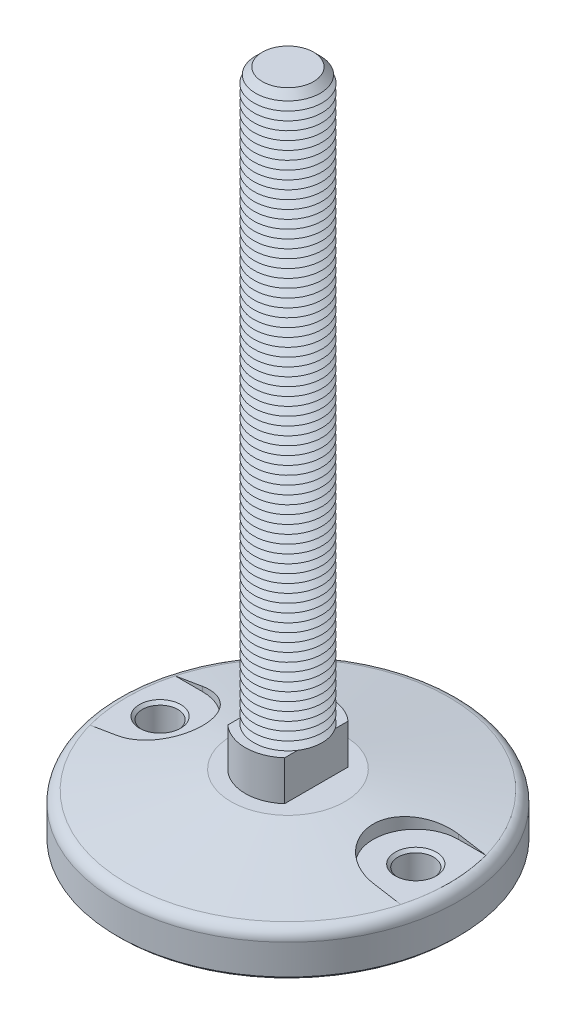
ISO-10303-21;
HEADER;
FILE_DESCRIPTION(('STEP AP214'),'2;1');
FILE_NAME('part.step','',(''),(''),'','','');
FILE_SCHEMA(('AUTOMOTIVE_DESIGN { 1 0 10303 214 1 1 1 1 }'));
ENDSEC;
DATA;
#1=APPLICATION_CONTEXT('core data for automotive mechanical design processes');
#2=APPLICATION_PROTOCOL_DEFINITION('international standard','automotive_design',2000,#1);
#3=PRODUCT_CONTEXT('',#1,'mechanical');
#4=PRODUCT('Part','Part','',(#3));
#5=PRODUCT_RELATED_PRODUCT_CATEGORY('part','',(#4));
#6=PRODUCT_DEFINITION_FORMATION('','',#4);
#7=PRODUCT_DEFINITION_CONTEXT('part definition',#1,'design');
#8=PRODUCT_DEFINITION('design','',#6,#7);
#9=PRODUCT_DEFINITION_SHAPE('','',#8);
#10=(LENGTH_UNIT() NAMED_UNIT(*) SI_UNIT(.MILLI.,.METRE.));
#11=(NAMED_UNIT(*) PLANE_ANGLE_UNIT() SI_UNIT($,.RADIAN.));
#12=(NAMED_UNIT(*) SI_UNIT($,.STERADIAN.) SOLID_ANGLE_UNIT());
#13=UNCERTAINTY_MEASURE_WITH_UNIT(LENGTH_MEASURE(1.E-05),#10,'distance_accuracy_value','');
#14=(GEOMETRIC_REPRESENTATION_CONTEXT(3) GLOBAL_UNCERTAINTY_ASSIGNED_CONTEXT((#13)) GLOBAL_UNIT_ASSIGNED_CONTEXT((#10,
#11,#12)) REPRESENTATION_CONTEXT('',''));
#15=CARTESIAN_POINT('',(0.,0.,0.));
#16=DIRECTION('',(0.,0.,1.));
#17=DIRECTION('',(1.,0.,0.));
#18=AXIS2_PLACEMENT_3D('',#15,#16,#17);
#19=CARTESIAN_POINT('',(0.,0.,0.));
#20=DIRECTION('',(0.,-1.,0.));
#21=DIRECTION('',(0.,0.,-1.));
#22=AXIS2_PLACEMENT_3D('',#19,#20,#21);
#23=CONICAL_SURFACE('',#22,20.,1.39626340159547);
#24=CARTESIAN_POINT('',(-45.0002,-4.83741692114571,14.9999999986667));
#25=CARTESIAN_POINT('',(-44.5716630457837,-4.76573974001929,15.00004953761));
#26=CARTESIAN_POINT('',(-44.1432899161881,-4.69315382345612,14.9816490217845));
#27=CARTESIAN_POINT('',(-43.2899455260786,-4.54659214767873,14.9083446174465));
#28=CARTESIAN_POINT('',(-42.8649740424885,-4.47261648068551,14.8534431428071));
#29=CARTESIAN_POINT('',(-42.0217138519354,-4.32373997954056,14.7075791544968));
#30=CARTESIAN_POINT('',(-41.6034211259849,-4.24883975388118,14.6166392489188));
#31=CARTESIAN_POINT('',(-40.7762181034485,-4.09853953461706,14.3993925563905));
#32=CARTESIAN_POINT('',(-40.367307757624,-4.02313954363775,14.2730859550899));
#33=CARTESIAN_POINT('',(-39.5616137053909,-3.87232244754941,13.9859546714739));
#34=CARTESIAN_POINT('',(-39.1648346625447,-3.79690534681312,13.82511690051));
#35=CARTESIAN_POINT('',(-38.3863815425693,-3.64664451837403,13.4700801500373));
#36=CARTESIAN_POINT('',(-38.0047074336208,-3.57180078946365,13.2758812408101));
#37=CARTESIAN_POINT('',(-37.259234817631,-3.42331263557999,12.8554907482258));
#38=CARTESIAN_POINT('',(-36.8954336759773,-3.3496680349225,12.6293038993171));
#39=CARTESIAN_POINT('',(-36.188253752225,-3.20423999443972,12.1464578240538));
#40=CARTESIAN_POINT('',(-35.8448748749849,-3.13245654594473,11.8897987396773));
#41=CARTESIAN_POINT('',(-35.1811599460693,-2.99151324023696,11.347857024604));
#42=CARTESIAN_POINT('',(-34.8608145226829,-2.92235232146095,11.0625861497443));
#43=CARTESIAN_POINT('',(-34.2453649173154,-2.78741726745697,10.4652623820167));
#44=CARTESIAN_POINT('',(-33.9502608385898,-2.72164314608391,10.1532093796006));
#45=CARTESIAN_POINT('',(-33.3874760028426,-2.59432642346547,9.50440564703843));
#46=CARTESIAN_POINT('',(-33.1197986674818,-2.53278435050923,9.1676518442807));
#47=CARTESIAN_POINT('',(-32.6139762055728,-2.41484175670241,8.47180160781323));
#48=CARTESIAN_POINT('',(-32.3758306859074,-2.35844116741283,8.11270547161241));
#49=CARTESIAN_POINT('',(-31.9339537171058,-2.25242768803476,7.3796428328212));
#50=CARTESIAN_POINT('',(-31.7298031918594,-2.20273384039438,7.00594067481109));
#51=CARTESIAN_POINT('',(-31.3537289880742,-2.11014777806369,6.24184253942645));
#52=CARTESIAN_POINT('',(-31.1818051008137,-2.0672555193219,5.851446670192));
#53=CARTESIAN_POINT('',(-30.8716543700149,-1.98913642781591,5.05684707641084));
#54=CARTESIAN_POINT('',(-30.7334198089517,-1.95390783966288,4.65264653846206));
#55=CARTESIAN_POINT('',(-30.4917961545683,-1.89187314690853,3.8333303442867));
#56=CARTESIAN_POINT('',(-30.3884062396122,-1.86506684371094,3.41821494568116));
#57=CARTESIAN_POINT('',(-30.2197121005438,-1.82110989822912,2.59156261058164));
#58=CARTESIAN_POINT('',(-30.1534519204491,-1.80371733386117,2.18023342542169));
#59=CARTESIAN_POINT('',(-30.0553621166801,-1.77790819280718,1.35321233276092));
#60=CARTESIAN_POINT('',(-30.0235318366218,-1.76949144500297,0.937520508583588));
#61=CARTESIAN_POINT('',(-29.9945838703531,-1.76183851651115,0.104887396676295));
#62=CARTESIAN_POINT('',(-29.9974627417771,-1.76260142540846,-0.31205376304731));
#63=CARTESIAN_POINT('',(-30.0378993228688,-1.7732869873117,-1.14413077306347));
#64=CARTESIAN_POINT('',(-30.0754567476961,-1.7832095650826,-1.55926663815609));
#65=CARTESIAN_POINT('',(-30.1838290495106,-1.81168784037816,-2.37646539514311));
#66=CARTESIAN_POINT('',(-30.253968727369,-1.83006819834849,-2.77862418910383));
#67=CARTESIAN_POINT('',(-30.4266561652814,-1.87498416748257,-3.57544878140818));
#68=CARTESIAN_POINT('',(-30.5292034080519,-1.90151964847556,-3.97011469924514));
#69=CARTESIAN_POINT('',(-30.7658801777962,-1.96218463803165,-4.74927597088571));
#70=CARTESIAN_POINT('',(-30.9000112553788,-1.99631451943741,-5.13377082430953));
#71=CARTESIAN_POINT('',(-31.1988010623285,-2.0714948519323,-5.8900091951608));
#72=CARTESIAN_POINT('',(-31.3634602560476,-2.11254540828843,-6.26175251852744));
#73=CARTESIAN_POINT('',(-31.7241833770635,-2.20134838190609,-6.99438182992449));
#74=CARTESIAN_POINT('',(-31.9205960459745,-2.24917439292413,-7.35508715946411));
#75=CARTESIAN_POINT('',(-32.3419301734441,-2.35035157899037,-8.0586224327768));
#76=CARTESIAN_POINT('',(-32.5668517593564,-2.40370277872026,-8.40145229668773));
#77=CARTESIAN_POINT('',(-33.0435892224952,-2.51513098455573,-9.06707399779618));
#78=CARTESIAN_POINT('',(-33.2954062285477,-2.57320818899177,-9.38986499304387));
#79=CARTESIAN_POINT('',(-33.8241636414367,-2.69330733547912,-10.0133800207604));
#80=CARTESIAN_POINT('',(-34.1011044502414,-2.7553293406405,-10.314103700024));
#81=CARTESIAN_POINT('',(-34.6862220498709,-2.88434050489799,-10.8996326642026));
#82=CARTESIAN_POINT('',(-34.9950517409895,-2.95141968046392,-11.1837659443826));
#83=CARTESIAN_POINT('',(-35.6350756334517,-3.08820736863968,-11.7249231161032));
#84=CARTESIAN_POINT('',(-35.9662703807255,-3.15791594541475,-11.981946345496));
#85=CARTESIAN_POINT('',(-36.6488620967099,-3.29929251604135,-12.4673150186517));
#86=CARTESIAN_POINT('',(-37.0002673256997,-3.37096130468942,-12.695648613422));
#87=CARTESIAN_POINT('',(-37.7207317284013,-3.51558573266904,-13.1220222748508));
#88=CARTESIAN_POINT('',(-38.0897905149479,-3.58854134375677,-13.3200630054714));
#89=CARTESIAN_POINT('',(-38.8503500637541,-3.73657205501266,-13.6880864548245));
#90=CARTESIAN_POINT('',(-39.2421468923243,-3.81166085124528,-13.8574521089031));
#91=CARTESIAN_POINT('',(-40.0387180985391,-3.9619955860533,-14.1621864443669));
#92=CARTESIAN_POINT('',(-40.4434925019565,-4.03724152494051,-14.2975550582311));
#93=CARTESIAN_POINT('',(-41.2626403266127,-4.18727395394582,-14.5331883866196));
#94=CARTESIAN_POINT('',(-41.6770011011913,-4.26206090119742,-14.6334968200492));
#95=CARTESIAN_POINT('',(-42.5127363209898,-4.41076799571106,-14.7984730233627));
#96=CARTESIAN_POINT('',(-42.9341072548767,-4.48468854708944,-14.86315811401));
#97=CARTESIAN_POINT('',(-43.6303300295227,-4.60517722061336,-14.9398587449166));
#98=CARTESIAN_POINT('',(-43.9039978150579,-4.65212396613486,-14.9624242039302));
#99=CARTESIAN_POINT('',(-44.4518138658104,-4.74530664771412,-14.992485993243));
#100=CARTESIAN_POINT('',(-44.725960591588,-4.79154362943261,-15.0000071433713));
#101=CARTESIAN_POINT('',(-45.0002,-4.83741692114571,-14.9999999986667));
#102=B_SPLINE_CURVE_WITH_KNOTS('',3,(#24,#25,#26,#27,#28,#29,#30,#31,#32,#33,#34,#35,#36,#37,
#38,#39,#40,#41,#42,#43,#44,#45,#46,#47,#48,#49,#50,#51,#52,#53,#54,#55,#56,#57,#58,#59,#60,#61,
#62,#63,#64,#65,#66,#67,#68,#69,#70,#71,#72,#73,#74,#75,#76,#77,#78,#79,#80,#81,#82,#83,#84,#85,
#86,#87,#88,#89,#90,#91,#92,#93,#94,#95,#96,#97,#98,#99,#100,#101),.UNSPECIFIED.,.F.,.F.,(4,2,2,
2,2,2,2,2,2,2,2,2,2,2,2,2,2,2,2,2,2,2,2,2,2,2,2,2,2,2,2,2,2,2,2,2,2,2,4),(0.,1.30306238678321,
2.60603860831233,3.9081987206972,5.21035199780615,6.51299971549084,7.81564468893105,
9.11809706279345,10.4205433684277,11.7224567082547,13.0243753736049,14.3264562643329,
15.6285198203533,16.9131037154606,18.1976792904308,19.4819603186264,20.7662110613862,
22.0156679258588,23.2651009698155,24.514410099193,25.7637089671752,26.9882006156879,
28.212672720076,29.4372049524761,30.6617558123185,31.9008050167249,33.1398597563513,
34.3789665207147,35.6180931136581,36.8915557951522,38.1650495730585,39.4390675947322,
40.7130576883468,42.0116991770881,43.3103432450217,44.6073621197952,45.9037498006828,
46.7391139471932,47.5730987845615),.UNSPECIFIED.);
#103=CARTESIAN_POINT('',(-45.,-4.8373834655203,15.));
#104=VERTEX_POINT('',#103);
#105=CARTESIAN_POINT('',(-45.,-4.8373834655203,-15.));
#106=VERTEX_POINT('',#105);
#107=EDGE_CURVE('E807',#104,#106,#102,.T.);
#108=ORIENTED_EDGE('',*,*,#107,.F.);
#109=CARTESIAN_POINT('',(-75.3836954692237,-10.0262296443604,15.));
#110=CARTESIAN_POINT('',(-73.5381209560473,-9.70707583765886,15.));
#111=CARTESIAN_POINT('',(-71.6924756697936,-9.3883303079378,15.));
#112=CARTESIAN_POINT('',(-68.000998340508,-8.75192554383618,15.));
#113=CARTESIAN_POINT('',(-66.1551662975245,-8.43426630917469,15.));
#114=CARTESIAN_POINT('',(-62.4632858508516,-7.80030655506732,15.));
#115=CARTESIAN_POINT('',(-60.6172374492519,-7.484006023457,15.));
#116=CARTESIAN_POINT('',(-56.9248399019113,-6.85315810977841,15.));
#117=CARTESIAN_POINT('',(-55.078490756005,-6.53861072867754,15.));
#118=CARTESIAN_POINT('',(-51.3853818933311,-5.91182468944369,15.));
#119=CARTESIAN_POINT('',(-49.538622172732,-5.59958605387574,15.));
#120=CARTESIAN_POINT('',(-45.8445795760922,-4.97822990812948,15.));
#121=CARTESIAN_POINT('',(-43.9972967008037,-4.66911239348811,15.));
#122=CARTESIAN_POINT('',(-41.2258181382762,-4.20871611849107,15.));
#123=CARTESIAN_POINT('',(-40.3018950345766,-4.05579661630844,15.));
#124=CARTESIAN_POINT('',(-38.4538315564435,-3.75127801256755,15.));
#125=CARTESIAN_POINT('',(-37.5296911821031,-3.59967891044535,15.));
#126=CARTESIAN_POINT('',(-35.6811466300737,-3.29806807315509,15.));
#127=CARTESIAN_POINT('',(-34.7567424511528,-3.14805634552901,15.));
#128=CARTESIAN_POINT('',(-32.9076160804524,-2.84999796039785,15.));
#129=CARTESIAN_POINT('',(-31.9828938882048,-2.70195130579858,15.));
#130=CARTESIAN_POINT('',(-31.05798475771,-2.55507589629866,15.));
#131=B_SPLINE_CURVE_WITH_KNOTS('',3,(#109,#110,#111,#112,#113,#114,#115,#116,#117,#118,#119,
#120,#121,#122,#123,#124,#125,#126,#127,#128,#129,#130),.UNSPECIFIED.,.F.,.F.,(4,2,2,2,2,2,2,2,
2,2,4),(0.,5.6189004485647,11.2377994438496,16.8566480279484,22.4754997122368,28.0944062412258,
33.7133047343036,36.5227815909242,39.3322572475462,42.1417462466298,44.9512393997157),.UNSPECIFIED.);
#132=CARTESIAN_POINT('',(-54.6728284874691,-6.47,15.));
#133=VERTEX_POINT('',#132);
#134=EDGE_CURVE('E781',#133,#104,#131,.T.);
#135=ORIENTED_EDGE('',*,*,#134,.F.);
#136=CARTESIAN_POINT('',(0.,-6.47,0.));
#137=DIRECTION('',(0.,1.,0.));
#138=DIRECTION('',(0.,0.,1.));
#139=AXIS2_PLACEMENT_3D('',#136,#137,#138);
#140=CIRCLE('',#139,56.693193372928);
#141=CARTESIAN_POINT('',(-54.6728284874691,-6.47,-15.));
#142=VERTEX_POINT('',#141);
#143=EDGE_CURVE('E765',#133,#142,#140,.F.);
#144=ORIENTED_EDGE('',*,*,#143,.T.);
#145=CARTESIAN_POINT('',(-31.05798475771,-2.55507589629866,-15.));
#146=CARTESIAN_POINT('',(-31.9828938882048,-2.70195130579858,-15.));
#147=CARTESIAN_POINT('',(-32.9076160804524,-2.84999796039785,-15.));
#148=CARTESIAN_POINT('',(-34.7567424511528,-3.14805634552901,-15.));
#149=CARTESIAN_POINT('',(-35.6811466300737,-3.29806807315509,-15.));
#150=CARTESIAN_POINT('',(-37.5296911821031,-3.59967891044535,-15.));
#151=CARTESIAN_POINT('',(-38.4538315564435,-3.75127801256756,-15.));
#152=CARTESIAN_POINT('',(-40.3018950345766,-4.05579661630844,-15.));
#153=CARTESIAN_POINT('',(-41.2258181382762,-4.20871611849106,-15.));
#154=CARTESIAN_POINT('',(-43.9972967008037,-4.66911239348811,-15.));
#155=CARTESIAN_POINT('',(-45.8445795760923,-4.97822990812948,-15.));
#156=CARTESIAN_POINT('',(-49.538622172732,-5.59958605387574,-15.));
#157=CARTESIAN_POINT('',(-51.3853818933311,-5.91182468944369,-15.));
#158=CARTESIAN_POINT('',(-55.078490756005,-6.53861072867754,-15.));
#159=CARTESIAN_POINT('',(-56.9248399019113,-6.85315810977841,-15.));
#160=CARTESIAN_POINT('',(-60.6172374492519,-7.48400602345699,-15.));
#161=CARTESIAN_POINT('',(-62.4632858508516,-7.80030655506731,-15.));
#162=CARTESIAN_POINT('',(-66.1551662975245,-8.43426630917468,-15.));
#163=CARTESIAN_POINT('',(-68.000998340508,-8.75192554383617,-15.));
#164=CARTESIAN_POINT('',(-71.6924756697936,-9.3883303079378,-15.));
#165=CARTESIAN_POINT('',(-73.5381209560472,-9.70707583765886,-15.));
#166=CARTESIAN_POINT('',(-75.3836954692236,-10.0262296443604,-15.));
#167=B_SPLINE_CURVE_WITH_KNOTS('',3,(#145,#146,#147,#148,#149,#150,#151,#152,#153,#154,#155,
#156,#157,#158,#159,#160,#161,#162,#163,#164,#165,#166),.UNSPECIFIED.,.F.,.F.,(4,2,2,2,2,2,2,2,
2,2,4),(0.,2.80949315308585,5.61898215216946,8.42845780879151,11.2379346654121,16.8568331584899,
22.4757396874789,28.0945913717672,33.713439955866,39.3323389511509,44.9512393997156),.UNSPECIFIED.);
#168=EDGE_CURVE('E773',#106,#142,#167,.T.);
#169=ORIENTED_EDGE('',*,*,#168,.F.);
#170=EDGE_LOOP('',(#108,#135,#144,#169));
#171=FACE_BOUND('',#170,.T.);
#172=CARTESIAN_POINT('',(0.,-6.47024674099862,0.));
#173=DIRECTION('',(0.,1.,0.));
#174=DIRECTION('',(0.,0.,1.));
#175=AXIS2_PLACEMENT_3D('',#172,#173,#174);
#176=CIRCLE('',#175,56.6945927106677);
#177=CARTESIAN_POINT('',(0.,-6.47024674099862,56.6945927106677));
#178=VERTEX_POINT('',#177);
#179=EDGE_CURVE('E754',#178,#178,#176,.T.);
#180=ORIENTED_EDGE('',*,*,#179,.T.);
#181=EDGE_LOOP('',(#180));
#182=FACE_BOUND('',#181,.T.);
#183=CARTESIAN_POINT('',(0.,0.,0.));
#184=DIRECTION('',(0.,1.,0.));
#185=DIRECTION('',(0.,0.,1.));
#186=AXIS2_PLACEMENT_3D('',#183,#184,#185);
#187=CIRCLE('',#186,20.);
#188=CARTESIAN_POINT('',(0.,0.,20.));
#189=VERTEX_POINT('',#188);
#190=EDGE_CURVE('E750',#189,#189,#187,.T.);
#191=ORIENTED_EDGE('',*,*,#190,.F.);
#192=EDGE_LOOP('',(#191));
#193=FACE_BOUND('',#192,.T.);
#194=CARTESIAN_POINT('',(68.3349761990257,-8.80963289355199,15.));
#195=CARTESIAN_POINT('',(66.4891647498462,-8.49175738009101,15.));
#196=CARTESIAN_POINT('',(64.6432610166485,-8.17441571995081,15.));
#197=CARTESIAN_POINT('',(60.9512028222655,-7.54120691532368,15.));
#198=CARTESIAN_POINT('',(59.1050483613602,-7.22533976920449,15.));
#199=CARTESIAN_POINT('',(55.4124579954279,-6.59549283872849,15.));
#200=CARTESIAN_POINT('',(53.5660220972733,-6.28151301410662,15.));
#201=CARTESIAN_POINT('',(49.8727228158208,-5.65605601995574,15.));
#202=CARTESIAN_POINT('',(48.0258594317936,-5.34457885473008,15.));
#203=CARTESIAN_POINT('',(44.3315117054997,-4.72503003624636,15.));
#204=CARTESIAN_POINT('',(42.4840273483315,-4.41695847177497,15.));
#205=CARTESIAN_POINT('',(38.7882718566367,-3.80560595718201,15.));
#206=CARTESIAN_POINT('',(36.9400007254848,-3.50232498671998,15.));
#207=CARTESIAN_POINT('',(34.1667136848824,-3.0526868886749,15.));
#208=CARTESIAN_POINT('',(33.2421265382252,-2.90368627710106,15.));
#209=CARTESIAN_POINT('',(31.3926029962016,-2.60787530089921,15.));
#210=CARTESIAN_POINT('',(30.4676666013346,-2.46106493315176,15.));
#211=CARTESIAN_POINT('',(28.617354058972,-2.17014916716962,15.));
#212=CARTESIAN_POINT('',(27.6919779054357,-2.02604380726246,15.));
#213=CARTESIAN_POINT('',(25.8406879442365,-1.74130150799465,15.));
#214=CARTESIAN_POINT('',(24.9147741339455,-1.60066458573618,15.));
#215=CARTESIAN_POINT('',(23.9885405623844,-1.46214325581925,15.));
#216=B_SPLINE_CURVE_WITH_KNOTS('',3,(#194,#195,#196,#197,#198,#199,#200,#201,#202,#203,#204,
#205,#206,#207,#208,#209,#210,#211,#212,#213,#214,#215),.UNSPECIFIED.,.F.,.F.,(4,2,2,2,2,2,2,2,
2,2,4),(0.,5.61894898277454,11.2378917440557,16.856714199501,22.4755463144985,28.0945245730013,
33.7134789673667,36.5230254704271,39.3325679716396,42.1421502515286,44.9517463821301),.UNSPECIFIED.);
#217=CARTESIAN_POINT('',(54.6728284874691,-6.47,15.));
#218=VERTEX_POINT('',#217);
#219=CARTESIAN_POINT('',(45.,-4.8373834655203,15.));
#220=VERTEX_POINT('',#219);
#221=EDGE_CURVE('E133',#218,#220,#216,.T.);
#222=ORIENTED_EDGE('',*,*,#221,.T.);
#223=CARTESIAN_POINT('',(45.0002,-4.83741692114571,14.9999999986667));
#224=CARTESIAN_POINT('',(44.5716630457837,-4.76573974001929,15.00004953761));
#225=CARTESIAN_POINT('',(44.1432899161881,-4.69315382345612,14.9816490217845));
#226=CARTESIAN_POINT('',(43.2899455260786,-4.54659214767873,14.9083446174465));
#227=CARTESIAN_POINT('',(42.8649740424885,-4.47261648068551,14.8534431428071));
#228=CARTESIAN_POINT('',(42.0217138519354,-4.32373997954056,14.7075791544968));
#229=CARTESIAN_POINT('',(41.6034211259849,-4.24883975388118,14.6166392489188));
#230=CARTESIAN_POINT('',(40.7762181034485,-4.09853953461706,14.3993925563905));
#231=CARTESIAN_POINT('',(40.367307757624,-4.02313954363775,14.2730859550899));
#232=CARTESIAN_POINT('',(39.5616137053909,-3.87232244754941,13.9859546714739));
#233=CARTESIAN_POINT('',(39.1648346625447,-3.79690534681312,13.82511690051));
#234=CARTESIAN_POINT('',(38.3863815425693,-3.64664451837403,13.4700801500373));
#235=CARTESIAN_POINT('',(38.0047074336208,-3.57180078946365,13.2758812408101));
#236=CARTESIAN_POINT('',(37.259234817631,-3.42331263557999,12.8554907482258));
#237=CARTESIAN_POINT('',(36.8954336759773,-3.3496680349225,12.6293038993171));
#238=CARTESIAN_POINT('',(36.188253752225,-3.20423999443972,12.1464578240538));
#239=CARTESIAN_POINT('',(35.8448748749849,-3.13245654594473,11.8897987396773));
#240=CARTESIAN_POINT('',(35.1811599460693,-2.99151324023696,11.347857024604));
#241=CARTESIAN_POINT('',(34.8608145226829,-2.92235232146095,11.0625861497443));
#242=CARTESIAN_POINT('',(34.2453649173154,-2.78741726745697,10.4652623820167));
#243=CARTESIAN_POINT('',(33.9502608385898,-2.72164314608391,10.1532093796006));
#244=CARTESIAN_POINT('',(33.3874760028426,-2.59432642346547,9.50440564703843));
#245=CARTESIAN_POINT('',(33.1197986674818,-2.53278435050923,9.1676518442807));
#246=CARTESIAN_POINT('',(32.6139762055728,-2.41484175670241,8.47180160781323));
#247=CARTESIAN_POINT('',(32.3758306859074,-2.35844116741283,8.11270547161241));
#248=CARTESIAN_POINT('',(31.9339537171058,-2.25242768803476,7.3796428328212));
#249=CARTESIAN_POINT('',(31.7298031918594,-2.20273384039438,7.00594067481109));
#250=CARTESIAN_POINT('',(31.3537289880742,-2.11014777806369,6.24184253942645));
#251=CARTESIAN_POINT('',(31.1818051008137,-2.0672555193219,5.851446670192));
#252=CARTESIAN_POINT('',(30.8716543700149,-1.98913642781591,5.05684707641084));
#253=CARTESIAN_POINT('',(30.7334198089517,-1.95390783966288,4.65264653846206));
#254=CARTESIAN_POINT('',(30.4917961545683,-1.89187314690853,3.8333303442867));
#255=CARTESIAN_POINT('',(30.3884062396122,-1.86506684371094,3.41821494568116));
#256=CARTESIAN_POINT('',(30.2197121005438,-1.82110989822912,2.59156261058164));
#257=CARTESIAN_POINT('',(30.1534519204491,-1.80371733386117,2.18023342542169));
#258=CARTESIAN_POINT('',(30.0553621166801,-1.77790819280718,1.35321233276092));
#259=CARTESIAN_POINT('',(30.0235318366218,-1.76949144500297,0.937520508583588));
#260=CARTESIAN_POINT('',(29.9945838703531,-1.76183851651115,0.104887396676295));
#261=CARTESIAN_POINT('',(29.9974627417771,-1.76260142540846,-0.31205376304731));
#262=CARTESIAN_POINT('',(30.0378993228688,-1.7732869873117,-1.14413077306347));
#263=CARTESIAN_POINT('',(30.0754567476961,-1.7832095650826,-1.55926663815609));
#264=CARTESIAN_POINT('',(30.1838290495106,-1.81168784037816,-2.37646539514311));
#265=CARTESIAN_POINT('',(30.253968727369,-1.83006819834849,-2.77862418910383));
#266=CARTESIAN_POINT('',(30.4266561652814,-1.87498416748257,-3.57544878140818));
#267=CARTESIAN_POINT('',(30.5292034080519,-1.90151964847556,-3.97011469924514));
#268=CARTESIAN_POINT('',(30.7658801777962,-1.96218463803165,-4.74927597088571));
#269=CARTESIAN_POINT('',(30.9000112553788,-1.99631451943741,-5.13377082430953));
#270=CARTESIAN_POINT('',(31.1988010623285,-2.0714948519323,-5.8900091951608));
#271=CARTESIAN_POINT('',(31.3634602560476,-2.11254540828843,-6.26175251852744));
#272=CARTESIAN_POINT('',(31.7241833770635,-2.20134838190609,-6.99438182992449));
#273=CARTESIAN_POINT('',(31.9205960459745,-2.24917439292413,-7.35508715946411));
#274=CARTESIAN_POINT('',(32.3419301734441,-2.35035157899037,-8.0586224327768));
#275=CARTESIAN_POINT('',(32.5668517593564,-2.40370277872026,-8.40145229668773));
#276=CARTESIAN_POINT('',(33.0435892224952,-2.51513098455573,-9.06707399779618));
#277=CARTESIAN_POINT('',(33.2954062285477,-2.57320818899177,-9.38986499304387));
#278=CARTESIAN_POINT('',(33.8241636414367,-2.69330733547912,-10.0133800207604));
#279=CARTESIAN_POINT('',(34.1011044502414,-2.7553293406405,-10.314103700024));
#280=CARTESIAN_POINT('',(34.6862220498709,-2.88434050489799,-10.8996326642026));
#281=CARTESIAN_POINT('',(34.9950517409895,-2.95141968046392,-11.1837659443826));
#282=CARTESIAN_POINT('',(35.6350756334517,-3.08820736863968,-11.7249231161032));
#283=CARTESIAN_POINT('',(35.9662703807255,-3.15791594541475,-11.981946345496));
#284=CARTESIAN_POINT('',(36.6488620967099,-3.29929251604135,-12.4673150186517));
#285=CARTESIAN_POINT('',(37.0002673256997,-3.37096130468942,-12.695648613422));
#286=CARTESIAN_POINT('',(37.7207317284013,-3.51558573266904,-13.1220222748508));
#287=CARTESIAN_POINT('',(38.0897905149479,-3.58854134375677,-13.3200630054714));
#288=CARTESIAN_POINT('',(38.8503500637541,-3.73657205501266,-13.6880864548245));
#289=CARTESIAN_POINT('',(39.2421468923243,-3.81166085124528,-13.8574521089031));
#290=CARTESIAN_POINT('',(40.0387180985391,-3.9619955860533,-14.1621864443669));
#291=CARTESIAN_POINT('',(40.4434925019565,-4.03724152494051,-14.2975550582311));
#292=CARTESIAN_POINT('',(41.2626403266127,-4.18727395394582,-14.5331883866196));
#293=CARTESIAN_POINT('',(41.6770011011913,-4.26206090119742,-14.6334968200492));
#294=CARTESIAN_POINT('',(42.5127363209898,-4.41076799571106,-14.7984730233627));
#295=CARTESIAN_POINT('',(42.9341072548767,-4.48468854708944,-14.86315811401));
#296=CARTESIAN_POINT('',(43.6303300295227,-4.60517722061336,-14.9398587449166));
#297=CARTESIAN_POINT('',(43.9039978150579,-4.65212396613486,-14.9624242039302));
#298=CARTESIAN_POINT('',(44.4518138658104,-4.74530664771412,-14.992485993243));
#299=CARTESIAN_POINT('',(44.725960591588,-4.79154362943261,-15.0000071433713));
#300=CARTESIAN_POINT('',(45.0002,-4.83741692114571,-14.9999999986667));
#301=B_SPLINE_CURVE_WITH_KNOTS('',3,(#223,#224,#225,#226,#227,#228,#229,#230,#231,#232,#233,
#234,#235,#236,#237,#238,#239,#240,#241,#242,#243,#244,#245,#246,#247,#248,#249,#250,#251,#252,
#253,#254,#255,#256,#257,#258,#259,#260,#261,#262,#263,#264,#265,#266,#267,#268,#269,#270,#271,
#272,#273,#274,#275,#276,#277,#278,#279,#280,#281,#282,#283,#284,#285,#286,#287,#288,#289,#290,
#291,#292,#293,#294,#295,#296,#297,#298,#299,#300),.UNSPECIFIED.,.F.,.F.,(4,2,2,2,2,2,2,2,2,2,2,
2,2,2,2,2,2,2,2,2,2,2,2,2,2,2,2,2,2,2,2,2,2,2,2,2,2,2,4),(0.,1.30306238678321,2.60603860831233,
3.9081987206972,5.21035199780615,6.51299971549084,7.81564468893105,9.11809706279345,
10.4205433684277,11.7224567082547,13.0243753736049,14.3264562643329,15.6285198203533,
16.9131037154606,18.1976792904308,19.4819603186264,20.7662110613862,22.0156679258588,
23.2651009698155,24.514410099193,25.7637089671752,26.9882006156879,28.212672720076,
29.4372049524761,30.6617558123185,31.9008050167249,33.1398597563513,34.3789665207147,
35.6180931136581,36.8915557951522,38.1650495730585,39.4390675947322,40.7130576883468,
42.0116991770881,43.3103432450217,44.6073621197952,45.9037498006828,46.7391139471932,
47.5730987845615),.UNSPECIFIED.);
#302=CARTESIAN_POINT('',(45.,-4.8373834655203,-15.));
#303=VERTEX_POINT('',#302);
#304=EDGE_CURVE('E145',#220,#303,#301,.T.);
#305=ORIENTED_EDGE('',*,*,#304,.T.);
#306=CARTESIAN_POINT('',(23.9885405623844,-1.46214325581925,-15.));
#307=CARTESIAN_POINT('',(24.9147741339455,-1.60066458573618,-15.));
#308=CARTESIAN_POINT('',(25.8406879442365,-1.74130150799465,-15.));
#309=CARTESIAN_POINT('',(27.6919779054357,-2.02604380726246,-15.));
#310=CARTESIAN_POINT('',(28.617354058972,-2.17014916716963,-15.));
#311=CARTESIAN_POINT('',(30.4676666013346,-2.46106493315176,-15.));
#312=CARTESIAN_POINT('',(31.3926029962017,-2.60787530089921,-15.));
#313=CARTESIAN_POINT('',(33.2421265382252,-2.90368627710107,-15.));
#314=CARTESIAN_POINT('',(34.1667136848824,-3.0526868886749,-15.));
#315=CARTESIAN_POINT('',(36.9400007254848,-3.50232498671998,-15.));
#316=CARTESIAN_POINT('',(38.7882718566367,-3.80560595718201,-15.));
#317=CARTESIAN_POINT('',(42.4840273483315,-4.41695847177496,-15.));
#318=CARTESIAN_POINT('',(44.3315117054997,-4.72503003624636,-15.));
#319=CARTESIAN_POINT('',(48.0258594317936,-5.34457885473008,-15.));
#320=CARTESIAN_POINT('',(49.8727228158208,-5.65605601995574,-15.));
#321=CARTESIAN_POINT('',(53.5660220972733,-6.28151301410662,-15.));
#322=CARTESIAN_POINT('',(55.4124579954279,-6.59549283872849,-15.));
#323=CARTESIAN_POINT('',(59.1050483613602,-7.22533976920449,-15.));
#324=CARTESIAN_POINT('',(60.9512028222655,-7.54120691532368,-15.));
#325=CARTESIAN_POINT('',(64.6432610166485,-8.17441571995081,-15.));
#326=CARTESIAN_POINT('',(66.4891647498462,-8.49175738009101,-15.));
#327=CARTESIAN_POINT('',(68.3349761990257,-8.80963289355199,-15.));
#328=B_SPLINE_CURVE_WITH_KNOTS('',3,(#306,#307,#308,#309,#310,#311,#312,#313,#314,#315,#316,
#317,#318,#319,#320,#321,#322,#323,#324,#325,#326,#327),.UNSPECIFIED.,.F.,.F.,(4,2,2,2,2,2,2,2,
2,2,4),(0.,2.80959613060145,5.61917841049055,8.42872091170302,11.2382674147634,16.8572218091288,
22.4762000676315,28.0950321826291,33.7138546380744,39.3327973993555,44.9517463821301),.UNSPECIFIED.);
#329=CARTESIAN_POINT('',(54.6728284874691,-6.47,-15.));
#330=VERTEX_POINT('',#329);
#331=EDGE_CURVE('E838',#303,#330,#328,.T.);
#332=ORIENTED_EDGE('',*,*,#331,.T.);
#333=CARTESIAN_POINT('',(0.,-6.47,0.));
#334=DIRECTION('',(0.,1.,0.));
#335=DIRECTION('',(0.,0.,1.));
#336=AXIS2_PLACEMENT_3D('',#333,#334,#335);
#337=CIRCLE('',#336,56.693193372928);
#338=EDGE_CURVE('E829',#330,#218,#337,.F.);
#339=ORIENTED_EDGE('',*,*,#338,.T.);
#340=EDGE_LOOP('',(#222,#305,#332,#339));
#341=FACE_BOUND('',#340,.T.);
#342=ADVANCED_FACE('F39',(#171,#182,#193,#341),#23,.T.);
#343=CARTESIAN_POINT('',(0.,14.,0.));
#344=DIRECTION('',(0.,1.,0.));
#345=DIRECTION('',(0.,0.,1.));
#346=AXIS2_PLACEMENT_3D('',#343,#344,#345);
#347=PLANE('',#346);
#348=CARTESIAN_POINT('',(0.,14.,0.));
#349=DIRECTION('',(0.,1.,0.));
#350=DIRECTION('',(0.,0.,1.));
#351=AXIS2_PLACEMENT_3D('',#348,#349,#350);
#352=CIRCLE('',#351,12.);
#353=CARTESIAN_POINT('',(9.99999999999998,14.,-6.63324958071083));
#354=VERTEX_POINT('',#353);
#355=CARTESIAN_POINT('',(-10.,14.,-6.6332495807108));
#356=VERTEX_POINT('',#355);
#357=EDGE_CURVE('E766',#354,#356,#352,.T.);
#358=ORIENTED_EDGE('',*,*,#357,.F.);
#359=DIRECTION('',(0.,0.,1.));
#360=VECTOR('',#359,1.);
#361=CARTESIAN_POINT('',(10.,14.,11.1803398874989));
#362=LINE('',#361,#360);
#363=CARTESIAN_POINT('',(10.,14.,-11.1803398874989));
#364=VERTEX_POINT('',#363);
#365=EDGE_CURVE('E729',#364,#354,#362,.T.);
#366=ORIENTED_EDGE('',*,*,#365,.F.);
#367=CARTESIAN_POINT('',(0.,14.,0.));
#368=DIRECTION('',(0.,1.,0.));
#369=DIRECTION('',(0.,0.,1.));
#370=AXIS2_PLACEMENT_3D('',#367,#368,#369);
#371=CIRCLE('',#370,15.);
#372=CARTESIAN_POINT('',(-10.,14.,-11.1803398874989));
#373=VERTEX_POINT('',#372);
#374=EDGE_CURVE('E743',#364,#373,#371,.T.);
#375=ORIENTED_EDGE('',*,*,#374,.T.);
#376=DIRECTION('',(0.,0.,-1.));
#377=VECTOR('',#376,1.);
#378=CARTESIAN_POINT('',(-10.,14.,-11.1803398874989));
#379=LINE('',#378,#377);
#380=EDGE_CURVE('E716',#356,#373,#379,.T.);
#381=ORIENTED_EDGE('',*,*,#380,.F.);
#382=EDGE_LOOP('',(#358,#366,#375,#381));
#383=FACE_BOUND('',#382,.T.);
#384=ADVANCED_FACE('F893',(#383),#347,.T.);
#385=CARTESIAN_POINT('',(0.,14.,0.));
#386=DIRECTION('',(0.,-1.,0.));
#387=DIRECTION('',(0.,0.,-1.));
#388=AXIS2_PLACEMENT_3D('',#385,#386,#387);
#389=CYLINDRICAL_SURFACE('',#388,15.);
#390=CARTESIAN_POINT('',(-10.,14.,11.1803398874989));
#391=VERTEX_POINT('',#390);
#392=CARTESIAN_POINT('',(10.,14.,11.1803398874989));
#393=VERTEX_POINT('',#392);
#394=EDGE_CURVE('E721',#391,#393,#371,.T.);
#395=ORIENTED_EDGE('',*,*,#394,.F.);
#396=DIRECTION('',(0.,1.,0.));
#397=VECTOR('',#396,1.);
#398=CARTESIAN_POINT('',(-10.,0.,11.1803398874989));
#399=LINE('',#398,#397);
#400=CARTESIAN_POINT('',(-10.,0.,11.1803398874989));
#401=VERTEX_POINT('',#400);
#402=EDGE_CURVE('E710',#401,#391,#399,.T.);
#403=ORIENTED_EDGE('',*,*,#402,.F.);
#404=CARTESIAN_POINT('',(0.,0.,0.));
#405=DIRECTION('',(0.,1.,0.));
#406=DIRECTION('',(0.,0.,1.));
#407=AXIS2_PLACEMENT_3D('',#404,#405,#406);
#408=CIRCLE('',#407,15.);
#409=CARTESIAN_POINT('',(10.,0.,11.1803398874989));
#410=VERTEX_POINT('',#409);
#411=EDGE_CURVE('E744',#401,#410,#408,.T.);
#412=ORIENTED_EDGE('',*,*,#411,.T.);
#413=DIRECTION('',(0.,1.,0.));
#414=VECTOR('',#413,1.);
#415=CARTESIAN_POINT('',(10.,0.,11.1803398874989));
#416=LINE('',#415,#414);
#417=EDGE_CURVE('E734',#410,#393,#416,.T.);
#418=ORIENTED_EDGE('',*,*,#417,.T.);
#419=EDGE_LOOP('',(#395,#403,#412,#418));
#420=FACE_BOUND('',#419,.T.);
#421=ADVANCED_FACE('F898',(#420),#389,.T.);
#422=CARTESIAN_POINT('',(0.,0.,0.));
#423=DIRECTION('',(0.,1.,0.));
#424=DIRECTION('',(0.,0.,1.));
#425=AXIS2_PLACEMENT_3D('',#422,#423,#424);
#426=PLANE('',#425);
#427=CARTESIAN_POINT('',(10.,0.,-11.1803398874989));
#428=VERTEX_POINT('',#427);
#429=CARTESIAN_POINT('',(-10.,0.,-11.1803398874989));
#430=VERTEX_POINT('',#429);
#431=EDGE_CURVE('E748',#428,#430,#408,.T.);
#432=ORIENTED_EDGE('',*,*,#431,.F.);
#433=DIRECTION('',(0.,0.,1.));
#434=VECTOR('',#433,1.);
#435=CARTESIAN_POINT('',(10.,0.,11.1803398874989));
#436=LINE('',#435,#434);
#437=EDGE_CURVE('E724',#428,#410,#436,.T.);
#438=ORIENTED_EDGE('',*,*,#437,.T.);
#439=ORIENTED_EDGE('',*,*,#411,.F.);
#440=DIRECTION('',(0.,0.,-1.));
#441=VECTOR('',#440,1.);
#442=CARTESIAN_POINT('',(-10.,0.,-11.1803398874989));
#443=LINE('',#442,#441);
#444=EDGE_CURVE('E706',#401,#430,#443,.T.);
#445=ORIENTED_EDGE('',*,*,#444,.T.);
#446=EDGE_LOOP('',(#432,#438,#439,#445));
#447=FACE_BOUND('',#446,.T.);
#448=ORIENTED_EDGE('',*,*,#190,.T.);
#449=EDGE_LOOP('',(#448));
#450=FACE_BOUND('',#449,.T.);
#451=ADVANCED_FACE('F964',(#447,#450),#426,.T.);
#452=CARTESIAN_POINT('',(0.,61.3388655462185,0.));
#453=DIRECTION('',(0.,1.,0.));
#454=DIRECTION('',(0.,0.,1.));
#455=AXIS2_PLACEMENT_3D('',#452,#453,#454);
#456=CYLINDRICAL_SURFACE('',#455,60.);
#457=CARTESIAN_POINT('',(0.,-21.,0.));
#458=DIRECTION('',(0.,-1.,0.));
#459=DIRECTION('',(0.,0.,-1.));
#460=AXIS2_PLACEMENT_3D('',#457,#458,#459);
#461=CIRCLE('',#460,60.);
#462=CARTESIAN_POINT('',(0.,-21.,-60.));
#463=VERTEX_POINT('',#462);
#464=EDGE_CURVE('E48',#463,#463,#461,.F.);
#465=ORIENTED_EDGE('',*,*,#464,.T.);
#466=EDGE_LOOP('',(#465));
#467=FACE_BOUND('',#466,.T.);
#468=CARTESIAN_POINT('',(0.,-10.4094777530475,0.));
#469=DIRECTION('',(0.,-1.,0.));
#470=DIRECTION('',(0.,0.,-1.));
#471=AXIS2_PLACEMENT_3D('',#468,#469,#470);
#472=CIRCLE('',#471,60.);
#473=CARTESIAN_POINT('',(0.,-10.4094777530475,-60.));
#474=VERTEX_POINT('',#473);
#475=EDGE_CURVE('E749',#474,#474,#472,.T.);
#476=ORIENTED_EDGE('',*,*,#475,.T.);
#477=EDGE_LOOP('',(#476));
#478=FACE_BOUND('',#477,.T.);
#479=ADVANCED_FACE('F880',(#467,#478),#456,.T.);
#480=CARTESIAN_POINT('',(0.,-22.,60.));
#481=DIRECTION('',(0.,-1.,0.));
#482=DIRECTION('',(0.,0.,-1.));
#483=AXIS2_PLACEMENT_3D('',#480,#481,#482);
#484=PLANE('',#483);
#485=CARTESIAN_POINT('',(0.,-22.,0.));
#486=DIRECTION('',(0.,-1.,0.));
#487=DIRECTION('',(0.,0.,-1.));
#488=AXIS2_PLACEMENT_3D('',#485,#486,#487);
#489=CIRCLE('',#488,59.);
#490=CARTESIAN_POINT('',(0.,-22.,-59.));
#491=VERTEX_POINT('',#490);
#492=EDGE_CURVE('E11',#491,#491,#489,.T.);
#493=ORIENTED_EDGE('',*,*,#492,.T.);
#494=EDGE_LOOP('',(#493));
#495=FACE_BOUND('',#494,.T.);
#496=CARTESIAN_POINT('',(45.,-22.,0.));
#497=DIRECTION('',(0.,-1.,0.));
#498=DIRECTION('',(0.,0.,-1.));
#499=AXIS2_PLACEMENT_3D('',#496,#497,#498);
#500=CIRCLE('',#499,7.25000000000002);
#501=CARTESIAN_POINT('',(45.,-22.,-7.25000000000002));
#502=VERTEX_POINT('',#501);
#503=EDGE_CURVE('E868',#502,#502,#500,.F.);
#504=ORIENTED_EDGE('',*,*,#503,.T.);
#505=EDGE_LOOP('',(#504));
#506=FACE_BOUND('',#505,.T.);
#507=CARTESIAN_POINT('',(-45.,-22.,0.));
#508=DIRECTION('',(0.,-1.,0.));
#509=DIRECTION('',(0.,0.,-1.));
#510=AXIS2_PLACEMENT_3D('',#507,#508,#509);
#511=CIRCLE('',#510,7.24999999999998);
#512=CARTESIAN_POINT('',(-45.,-22.,-7.24999999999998));
#513=VERTEX_POINT('',#512);
#514=EDGE_CURVE('E813',#513,#513,#511,.F.);
#515=ORIENTED_EDGE('',*,*,#514,.T.);
#516=EDGE_LOOP('',(#515));
#517=FACE_BOUND('',#516,.T.);
#518=ADVANCED_FACE('F960',(#495,#506,#517),#484,.T.);
#519=CARTESIAN_POINT('',(0.,-10.4094777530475,0.));
#520=DIRECTION('',(0.,-1.,0.));
#521=DIRECTION('',(0.,0.,-1.));
#522=AXIS2_PLACEMENT_3D('',#519,#520,#521);
#523=TOROIDAL_SURFACE('',#522,56.,4.);
#524=ORIENTED_EDGE('',*,*,#475,.F.);
#525=EDGE_LOOP('',(#524));
#526=FACE_BOUND('',#525,.T.);
#527=ORIENTED_EDGE('',*,*,#179,.F.);
#528=EDGE_LOOP('',(#527));
#529=FACE_BOUND('',#528,.T.);
#530=ADVANCED_FACE('F958',(#526,#529),#523,.T.);
#531=ORIENTED_EDGE('',*,*,#431,.T.);
#532=DIRECTION('',(0.,1.,0.));
#533=VECTOR('',#532,1.);
#534=CARTESIAN_POINT('',(-10.,0.,-11.1803398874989));
#535=LINE('',#534,#533);
#536=EDGE_CURVE('E717',#430,#373,#535,.T.);
#537=ORIENTED_EDGE('',*,*,#536,.T.);
#538=ORIENTED_EDGE('',*,*,#374,.F.);
#539=DIRECTION('',(0.,1.,0.));
#540=VECTOR('',#539,1.);
#541=CARTESIAN_POINT('',(10.,0.,-11.1803398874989));
#542=LINE('',#541,#540);
#543=EDGE_CURVE('E728',#428,#364,#542,.T.);
#544=ORIENTED_EDGE('',*,*,#543,.F.);
#545=EDGE_LOOP('',(#531,#537,#538,#544));
#546=FACE_BOUND('',#545,.T.);
#547=ADVANCED_FACE('F955',(#546),#389,.T.);
#548=CARTESIAN_POINT('',(-10.,14.,6.6332495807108));
#549=VERTEX_POINT('',#548);
#550=CARTESIAN_POINT('',(10.,14.,6.6332495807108));
#551=VERTEX_POINT('',#550);
#552=EDGE_CURVE('E705',#549,#551,#352,.T.);
#553=ORIENTED_EDGE('',*,*,#552,.F.);
#554=EDGE_CURVE('E711',#391,#549,#379,.T.);
#555=ORIENTED_EDGE('',*,*,#554,.F.);
#556=ORIENTED_EDGE('',*,*,#394,.T.);
#557=EDGE_CURVE('E704',#551,#393,#362,.T.);
#558=ORIENTED_EDGE('',*,*,#557,.F.);
#559=EDGE_LOOP('',(#553,#555,#556,#558));
#560=FACE_BOUND('',#559,.T.);
#561=ADVANCED_FACE('F901',(#560),#347,.T.);
#562=CARTESIAN_POINT('',(10.,0.,11.1803398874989));
#563=DIRECTION('',(-1.,0.,0.));
#564=DIRECTION('',(0.,0.,1.));
#565=AXIS2_PLACEMENT_3D('',#562,#563,#564);
#566=PLANE('',#565);
#567=ORIENTED_EDGE('',*,*,#365,.T.);
#568=EDGE_CURVE('E733',#354,#551,#362,.T.);
#569=ORIENTED_EDGE('',*,*,#568,.T.);
#570=ORIENTED_EDGE('',*,*,#557,.T.);
#571=ORIENTED_EDGE('',*,*,#417,.F.);
#572=ORIENTED_EDGE('',*,*,#437,.F.);
#573=ORIENTED_EDGE('',*,*,#543,.T.);
#574=EDGE_LOOP('',(#567,#569,#570,#571,#572,#573));
#575=FACE_BOUND('',#574,.T.);
#576=ADVANCED_FACE('F945',(#575),#566,.F.);
#577=CARTESIAN_POINT('',(-10.,0.,-11.1803398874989));
#578=DIRECTION('',(1.,0.,0.));
#579=DIRECTION('',(0.,0.,-1.));
#580=AXIS2_PLACEMENT_3D('',#577,#578,#579);
#581=PLANE('',#580);
#582=ORIENTED_EDGE('',*,*,#554,.T.);
#583=EDGE_CURVE('E715',#549,#356,#379,.T.);
#584=ORIENTED_EDGE('',*,*,#583,.T.);
#585=ORIENTED_EDGE('',*,*,#380,.T.);
#586=ORIENTED_EDGE('',*,*,#536,.F.);
#587=ORIENTED_EDGE('',*,*,#444,.F.);
#588=ORIENTED_EDGE('',*,*,#402,.T.);
#589=EDGE_LOOP('',(#582,#584,#585,#586,#587,#588));
#590=FACE_BOUND('',#589,.T.);
#591=ADVANCED_FACE('F934',(#590),#581,.F.);
#592=CARTESIAN_POINT('',(0.,14.,0.));
#593=DIRECTION('',(0.,1.,0.));
#594=DIRECTION('',(0.,0.,1.));
#595=AXIS2_PLACEMENT_3D('',#592,#593,#594);
#596=PLANE('',#595);
#597=ORIENTED_EDGE('',*,*,#583,.F.);
#598=EDGE_CURVE('E700',#356,#549,#352,.T.);
#599=ORIENTED_EDGE('',*,*,#598,.F.);
#600=EDGE_LOOP('',(#597,#599));
#601=FACE_BOUND('',#600,.T.);
#602=ADVANCED_FACE('F936',(#601),#596,.F.);
#603=ORIENTED_EDGE('',*,*,#568,.F.);
#604=EDGE_CURVE('E701',#551,#354,#352,.T.);
#605=ORIENTED_EDGE('',*,*,#604,.F.);
#606=EDGE_LOOP('',(#603,#605));
#607=FACE_BOUND('',#606,.T.);
#608=ADVANCED_FACE('F938',(#607),#596,.F.);
#609=CARTESIAN_POINT('',(0.,14.,0.));
#610=DIRECTION('',(0.,-1.,0.));
#611=DIRECTION('',(0.,0.,-1.));
#612=AXIS2_PLACEMENT_3D('',#609,#610,#611);
#613=CONICAL_SURFACE('',#612,12.,1.0471975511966);
#614=CARTESIAN_POINT('',(0.,15.5,0.));
#615=DIRECTION('',(0.,1.,0.));
#616=DIRECTION('',(0.,0.,1.));
#617=AXIS2_PLACEMENT_3D('',#614,#615,#616);
#618=CIRCLE('',#617,9.40192378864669);
#619=CARTESIAN_POINT('',(0.,15.5,9.40192378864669));
#620=VERTEX_POINT('',#619);
#621=EDGE_CURVE('E696',#620,#620,#618,.T.);
#622=ORIENTED_EDGE('',*,*,#621,.F.);
#623=EDGE_LOOP('',(#622));
#624=FACE_BOUND('',#623,.T.);
#625=ORIENTED_EDGE('',*,*,#604,.T.);
#626=ORIENTED_EDGE('',*,*,#357,.T.);
#627=ORIENTED_EDGE('',*,*,#598,.T.);
#628=ORIENTED_EDGE('',*,*,#552,.T.);
#629=EDGE_LOOP('',(#625,#626,#627,#628));
#630=FACE_BOUND('',#629,.T.);
#631=ADVANCED_FACE('F925',(#624,#630),#613,.T.);
#632=CARTESIAN_POINT('',(0.,15.5,0.));
#633=DIRECTION('',(0.,1.,0.));
#634=DIRECTION('',(0.,0.,1.));
#635=AXIS2_PLACEMENT_3D('',#632,#633,#634);
#636=CONICAL_SURFACE('',#635,9.40192378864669,1.0471975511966);
#637=CARTESIAN_POINT('',(0.,17.,0.));
#638=DIRECTION('',(0.,1.,0.));
#639=DIRECTION('',(0.,0.,1.));
#640=AXIS2_PLACEMENT_3D('',#637,#638,#639);
#641=CIRCLE('',#640,12.);
#642=CARTESIAN_POINT('',(0.,17.,12.));
#643=VERTEX_POINT('',#642);
#644=EDGE_CURVE('E692',#643,#643,#641,.T.);
#645=ORIENTED_EDGE('',*,*,#644,.F.);
#646=EDGE_LOOP('',(#645));
#647=FACE_BOUND('',#646,.T.);
#648=ORIENTED_EDGE('',*,*,#621,.T.);
#649=EDGE_LOOP('',(#648));
#650=FACE_BOUND('',#649,.T.);
#651=ADVANCED_FACE('F2039',(#647,#650),#636,.T.);
#652=CARTESIAN_POINT('',(0.,17.,0.));
#653=DIRECTION('',(0.,-1.,0.));
#654=DIRECTION('',(0.,0.,-1.));
#655=AXIS2_PLACEMENT_3D('',#652,#653,#654);
#656=CONICAL_SURFACE('',#655,12.,1.0471975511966);
#657=CARTESIAN_POINT('',(0.,18.5,0.));
#658=DIRECTION('',(0.,1.,0.));
#659=DIRECTION('',(0.,0.,1.));
#660=AXIS2_PLACEMENT_3D('',#657,#658,#659);
#661=CIRCLE('',#660,9.40192378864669);
#662=CARTESIAN_POINT('',(0.,18.5,9.40192378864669));
#663=VERTEX_POINT('',#662);
#664=EDGE_CURVE('E688',#663,#663,#661,.T.);
#665=ORIENTED_EDGE('',*,*,#664,.F.);
#666=EDGE_LOOP('',(#665));
#667=FACE_BOUND('',#666,.T.);
#668=ORIENTED_EDGE('',*,*,#644,.T.);
#669=EDGE_LOOP('',(#668));
#670=FACE_BOUND('',#669,.T.);
#671=ADVANCED_FACE('F2032',(#667,#670),#656,.T.);
#672=CARTESIAN_POINT('',(0.,18.5,0.));
#673=DIRECTION('',(0.,1.,0.));
#674=DIRECTION('',(0.,0.,1.));
#675=AXIS2_PLACEMENT_3D('',#672,#673,#674);
#676=CONICAL_SURFACE('',#675,9.40192378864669,1.0471975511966);
#677=CARTESIAN_POINT('',(0.,20.,0.));
#678=DIRECTION('',(0.,1.,0.));
#679=DIRECTION('',(0.,0.,1.));
#680=AXIS2_PLACEMENT_3D('',#677,#678,#679);
#681=CIRCLE('',#680,12.);
#682=CARTESIAN_POINT('',(0.,20.,12.));
#683=VERTEX_POINT('',#682);
#684=EDGE_CURVE('E684',#683,#683,#681,.T.);
#685=ORIENTED_EDGE('',*,*,#684,.F.);
#686=EDGE_LOOP('',(#685));
#687=FACE_BOUND('',#686,.T.);
#688=ORIENTED_EDGE('',*,*,#664,.T.);
#689=EDGE_LOOP('',(#688));
#690=FACE_BOUND('',#689,.T.);
#691=ADVANCED_FACE('F2025',(#687,#690),#676,.T.);
#692=CARTESIAN_POINT('',(0.,20.,0.));
#693=DIRECTION('',(0.,-1.,0.));
#694=DIRECTION('',(0.,0.,-1.));
#695=AXIS2_PLACEMENT_3D('',#692,#693,#694);
#696=CONICAL_SURFACE('',#695,12.,1.0471975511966);
#697=CARTESIAN_POINT('',(0.,21.5,0.));
#698=DIRECTION('',(0.,1.,0.));
#699=DIRECTION('',(0.,0.,1.));
#700=AXIS2_PLACEMENT_3D('',#697,#698,#699);
#701=CIRCLE('',#700,9.40192378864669);
#702=CARTESIAN_POINT('',(0.,21.5,9.40192378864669));
#703=VERTEX_POINT('',#702);
#704=EDGE_CURVE('E680',#703,#703,#701,.T.);
#705=ORIENTED_EDGE('',*,*,#704,.F.);
#706=EDGE_LOOP('',(#705));
#707=FACE_BOUND('',#706,.T.);
#708=ORIENTED_EDGE('',*,*,#684,.T.);
#709=EDGE_LOOP('',(#708));
#710=FACE_BOUND('',#709,.T.);
#711=ADVANCED_FACE('F2018',(#707,#710),#696,.T.);
#712=CARTESIAN_POINT('',(0.,21.5,0.));
#713=DIRECTION('',(0.,1.,0.));
#714=DIRECTION('',(0.,0.,1.));
#715=AXIS2_PLACEMENT_3D('',#712,#713,#714);
#716=CONICAL_SURFACE('',#715,9.40192378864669,1.0471975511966);
#717=CARTESIAN_POINT('',(0.,23.,0.));
#718=DIRECTION('',(0.,1.,0.));
#719=DIRECTION('',(0.,0.,1.));
#720=AXIS2_PLACEMENT_3D('',#717,#718,#719);
#721=CIRCLE('',#720,12.);
#722=CARTESIAN_POINT('',(0.,23.,12.));
#723=VERTEX_POINT('',#722);
#724=EDGE_CURVE('E676',#723,#723,#721,.T.);
#725=ORIENTED_EDGE('',*,*,#724,.F.);
#726=EDGE_LOOP('',(#725));
#727=FACE_BOUND('',#726,.T.);
#728=ORIENTED_EDGE('',*,*,#704,.T.);
#729=EDGE_LOOP('',(#728));
#730=FACE_BOUND('',#729,.T.);
#731=ADVANCED_FACE('F2011',(#727,#730),#716,.T.);
#732=CARTESIAN_POINT('',(0.,23.,0.));
#733=DIRECTION('',(0.,-1.,0.));
#734=DIRECTION('',(0.,0.,-1.));
#735=AXIS2_PLACEMENT_3D('',#732,#733,#734);
#736=CONICAL_SURFACE('',#735,12.,1.0471975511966);
#737=CARTESIAN_POINT('',(0.,24.5,0.));
#738=DIRECTION('',(0.,1.,0.));
#739=DIRECTION('',(0.,0.,1.));
#740=AXIS2_PLACEMENT_3D('',#737,#738,#739);
#741=CIRCLE('',#740,9.40192378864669);
#742=CARTESIAN_POINT('',(0.,24.5,9.40192378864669));
#743=VERTEX_POINT('',#742);
#744=EDGE_CURVE('E672',#743,#743,#741,.T.);
#745=ORIENTED_EDGE('',*,*,#744,.F.);
#746=EDGE_LOOP('',(#745));
#747=FACE_BOUND('',#746,.T.);
#748=ORIENTED_EDGE('',*,*,#724,.T.);
#749=EDGE_LOOP('',(#748));
#750=FACE_BOUND('',#749,.T.);
#751=ADVANCED_FACE('F2004',(#747,#750),#736,.T.);
#752=CARTESIAN_POINT('',(0.,24.5,0.));
#753=DIRECTION('',(0.,1.,0.));
#754=DIRECTION('',(0.,0.,1.));
#755=AXIS2_PLACEMENT_3D('',#752,#753,#754);
#756=CONICAL_SURFACE('',#755,9.40192378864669,1.0471975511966);
#757=CARTESIAN_POINT('',(0.,26.,0.));
#758=DIRECTION('',(0.,1.,0.));
#759=DIRECTION('',(0.,0.,1.));
#760=AXIS2_PLACEMENT_3D('',#757,#758,#759);
#761=CIRCLE('',#760,12.);
#762=CARTESIAN_POINT('',(0.,26.,12.));
#763=VERTEX_POINT('',#762);
#764=EDGE_CURVE('E668',#763,#763,#761,.T.);
#765=ORIENTED_EDGE('',*,*,#764,.F.);
#766=EDGE_LOOP('',(#765));
#767=FACE_BOUND('',#766,.T.);
#768=ORIENTED_EDGE('',*,*,#744,.T.);
#769=EDGE_LOOP('',(#768));
#770=FACE_BOUND('',#769,.T.);
#771=ADVANCED_FACE('F1997',(#767,#770),#756,.T.);
#772=CARTESIAN_POINT('',(0.,26.,0.));
#773=DIRECTION('',(0.,-1.,0.));
#774=DIRECTION('',(0.,0.,-1.));
#775=AXIS2_PLACEMENT_3D('',#772,#773,#774);
#776=CONICAL_SURFACE('',#775,12.,1.0471975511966);
#777=CARTESIAN_POINT('',(0.,27.5,0.));
#778=DIRECTION('',(0.,1.,0.));
#779=DIRECTION('',(0.,0.,1.));
#780=AXIS2_PLACEMENT_3D('',#777,#778,#779);
#781=CIRCLE('',#780,9.40192378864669);
#782=CARTESIAN_POINT('',(0.,27.5,9.40192378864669));
#783=VERTEX_POINT('',#782);
#784=EDGE_CURVE('E664',#783,#783,#781,.T.);
#785=ORIENTED_EDGE('',*,*,#784,.F.);
#786=EDGE_LOOP('',(#785));
#787=FACE_BOUND('',#786,.T.);
#788=ORIENTED_EDGE('',*,*,#764,.T.);
#789=EDGE_LOOP('',(#788));
#790=FACE_BOUND('',#789,.T.);
#791=ADVANCED_FACE('F1990',(#787,#790),#776,.T.);
#792=CARTESIAN_POINT('',(0.,27.5,0.));
#793=DIRECTION('',(0.,1.,0.));
#794=DIRECTION('',(0.,0.,1.));
#795=AXIS2_PLACEMENT_3D('',#792,#793,#794);
#796=CONICAL_SURFACE('',#795,9.40192378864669,1.0471975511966);
#797=CARTESIAN_POINT('',(0.,29.,0.));
#798=DIRECTION('',(0.,1.,0.));
#799=DIRECTION('',(0.,0.,1.));
#800=AXIS2_PLACEMENT_3D('',#797,#798,#799);
#801=CIRCLE('',#800,12.);
#802=CARTESIAN_POINT('',(0.,29.,12.));
#803=VERTEX_POINT('',#802);
#804=EDGE_CURVE('E660',#803,#803,#801,.T.);
#805=ORIENTED_EDGE('',*,*,#804,.F.);
#806=EDGE_LOOP('',(#805));
#807=FACE_BOUND('',#806,.T.);
#808=ORIENTED_EDGE('',*,*,#784,.T.);
#809=EDGE_LOOP('',(#808));
#810=FACE_BOUND('',#809,.T.);
#811=ADVANCED_FACE('F1983',(#807,#810),#796,.T.);
#812=CARTESIAN_POINT('',(0.,29.,0.));
#813=DIRECTION('',(0.,-1.,0.));
#814=DIRECTION('',(0.,0.,-1.));
#815=AXIS2_PLACEMENT_3D('',#812,#813,#814);
#816=CONICAL_SURFACE('',#815,12.,1.0471975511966);
#817=CARTESIAN_POINT('',(0.,30.5,0.));
#818=DIRECTION('',(0.,1.,0.));
#819=DIRECTION('',(0.,0.,1.));
#820=AXIS2_PLACEMENT_3D('',#817,#818,#819);
#821=CIRCLE('',#820,9.40192378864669);
#822=CARTESIAN_POINT('',(0.,30.5,9.40192378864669));
#823=VERTEX_POINT('',#822);
#824=EDGE_CURVE('E656',#823,#823,#821,.T.);
#825=ORIENTED_EDGE('',*,*,#824,.F.);
#826=EDGE_LOOP('',(#825));
#827=FACE_BOUND('',#826,.T.);
#828=ORIENTED_EDGE('',*,*,#804,.T.);
#829=EDGE_LOOP('',(#828));
#830=FACE_BOUND('',#829,.T.);
#831=ADVANCED_FACE('F1976',(#827,#830),#816,.T.);
#832=CARTESIAN_POINT('',(0.,30.5,0.));
#833=DIRECTION('',(0.,1.,0.));
#834=DIRECTION('',(0.,0.,1.));
#835=AXIS2_PLACEMENT_3D('',#832,#833,#834);
#836=CONICAL_SURFACE('',#835,9.40192378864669,1.0471975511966);
#837=CARTESIAN_POINT('',(0.,32.,0.));
#838=DIRECTION('',(0.,1.,0.));
#839=DIRECTION('',(0.,0.,1.));
#840=AXIS2_PLACEMENT_3D('',#837,#838,#839);
#841=CIRCLE('',#840,12.);
#842=CARTESIAN_POINT('',(0.,32.,12.));
#843=VERTEX_POINT('',#842);
#844=EDGE_CURVE('E652',#843,#843,#841,.T.);
#845=ORIENTED_EDGE('',*,*,#844,.F.);
#846=EDGE_LOOP('',(#845));
#847=FACE_BOUND('',#846,.T.);
#848=ORIENTED_EDGE('',*,*,#824,.T.);
#849=EDGE_LOOP('',(#848));
#850=FACE_BOUND('',#849,.T.);
#851=ADVANCED_FACE('F1969',(#847,#850),#836,.T.);
#852=CARTESIAN_POINT('',(0.,32.,0.));
#853=DIRECTION('',(0.,-1.,0.));
#854=DIRECTION('',(0.,0.,-1.));
#855=AXIS2_PLACEMENT_3D('',#852,#853,#854);
#856=CONICAL_SURFACE('',#855,12.,1.0471975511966);
#857=CARTESIAN_POINT('',(0.,33.5,0.));
#858=DIRECTION('',(0.,1.,0.));
#859=DIRECTION('',(0.,0.,1.));
#860=AXIS2_PLACEMENT_3D('',#857,#858,#859);
#861=CIRCLE('',#860,9.40192378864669);
#862=CARTESIAN_POINT('',(0.,33.5,9.40192378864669));
#863=VERTEX_POINT('',#862);
#864=EDGE_CURVE('E648',#863,#863,#861,.T.);
#865=ORIENTED_EDGE('',*,*,#864,.F.);
#866=EDGE_LOOP('',(#865));
#867=FACE_BOUND('',#866,.T.);
#868=ORIENTED_EDGE('',*,*,#844,.T.);
#869=EDGE_LOOP('',(#868));
#870=FACE_BOUND('',#869,.T.);
#871=ADVANCED_FACE('F1962',(#867,#870),#856,.T.);
#872=CARTESIAN_POINT('',(0.,33.5,0.));
#873=DIRECTION('',(0.,1.,0.));
#874=DIRECTION('',(0.,0.,1.));
#875=AXIS2_PLACEMENT_3D('',#872,#873,#874);
#876=CONICAL_SURFACE('',#875,9.40192378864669,1.0471975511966);
#877=CARTESIAN_POINT('',(0.,35.,0.));
#878=DIRECTION('',(0.,1.,0.));
#879=DIRECTION('',(0.,0.,1.));
#880=AXIS2_PLACEMENT_3D('',#877,#878,#879);
#881=CIRCLE('',#880,12.);
#882=CARTESIAN_POINT('',(0.,35.,12.));
#883=VERTEX_POINT('',#882);
#884=EDGE_CURVE('E644',#883,#883,#881,.T.);
#885=ORIENTED_EDGE('',*,*,#884,.F.);
#886=EDGE_LOOP('',(#885));
#887=FACE_BOUND('',#886,.T.);
#888=ORIENTED_EDGE('',*,*,#864,.T.);
#889=EDGE_LOOP('',(#888));
#890=FACE_BOUND('',#889,.T.);
#891=ADVANCED_FACE('F1955',(#887,#890),#876,.T.);
#892=CARTESIAN_POINT('',(0.,35.,0.));
#893=DIRECTION('',(0.,-1.,0.));
#894=DIRECTION('',(0.,0.,-1.));
#895=AXIS2_PLACEMENT_3D('',#892,#893,#894);
#896=CONICAL_SURFACE('',#895,12.,1.0471975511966);
#897=CARTESIAN_POINT('',(0.,36.5,0.));
#898=DIRECTION('',(0.,1.,0.));
#899=DIRECTION('',(0.,0.,1.));
#900=AXIS2_PLACEMENT_3D('',#897,#898,#899);
#901=CIRCLE('',#900,9.40192378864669);
#902=CARTESIAN_POINT('',(0.,36.5,9.40192378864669));
#903=VERTEX_POINT('',#902);
#904=EDGE_CURVE('E640',#903,#903,#901,.T.);
#905=ORIENTED_EDGE('',*,*,#904,.F.);
#906=EDGE_LOOP('',(#905));
#907=FACE_BOUND('',#906,.T.);
#908=ORIENTED_EDGE('',*,*,#884,.T.);
#909=EDGE_LOOP('',(#908));
#910=FACE_BOUND('',#909,.T.);
#911=ADVANCED_FACE('F1948',(#907,#910),#896,.T.);
#912=CARTESIAN_POINT('',(0.,36.5,0.));
#913=DIRECTION('',(0.,1.,0.));
#914=DIRECTION('',(0.,0.,1.));
#915=AXIS2_PLACEMENT_3D('',#912,#913,#914);
#916=CONICAL_SURFACE('',#915,9.40192378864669,1.0471975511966);
#917=CARTESIAN_POINT('',(0.,38.,0.));
#918=DIRECTION('',(0.,1.,0.));
#919=DIRECTION('',(0.,0.,1.));
#920=AXIS2_PLACEMENT_3D('',#917,#918,#919);
#921=CIRCLE('',#920,12.);
#922=CARTESIAN_POINT('',(0.,38.,12.));
#923=VERTEX_POINT('',#922);
#924=EDGE_CURVE('E636',#923,#923,#921,.T.);
#925=ORIENTED_EDGE('',*,*,#924,.F.);
#926=EDGE_LOOP('',(#925));
#927=FACE_BOUND('',#926,.T.);
#928=ORIENTED_EDGE('',*,*,#904,.T.);
#929=EDGE_LOOP('',(#928));
#930=FACE_BOUND('',#929,.T.);
#931=ADVANCED_FACE('F1941',(#927,#930),#916,.T.);
#932=CARTESIAN_POINT('',(0.,38.,0.));
#933=DIRECTION('',(0.,-1.,0.));
#934=DIRECTION('',(0.,0.,-1.));
#935=AXIS2_PLACEMENT_3D('',#932,#933,#934);
#936=CONICAL_SURFACE('',#935,12.,1.0471975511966);
#937=CARTESIAN_POINT('',(0.,39.5,0.));
#938=DIRECTION('',(0.,1.,0.));
#939=DIRECTION('',(0.,0.,1.));
#940=AXIS2_PLACEMENT_3D('',#937,#938,#939);
#941=CIRCLE('',#940,9.40192378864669);
#942=CARTESIAN_POINT('',(0.,39.5,9.40192378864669));
#943=VERTEX_POINT('',#942);
#944=EDGE_CURVE('E632',#943,#943,#941,.T.);
#945=ORIENTED_EDGE('',*,*,#944,.F.);
#946=EDGE_LOOP('',(#945));
#947=FACE_BOUND('',#946,.T.);
#948=ORIENTED_EDGE('',*,*,#924,.T.);
#949=EDGE_LOOP('',(#948));
#950=FACE_BOUND('',#949,.T.);
#951=ADVANCED_FACE('F1934',(#947,#950),#936,.T.);
#952=CARTESIAN_POINT('',(0.,39.5,0.));
#953=DIRECTION('',(0.,1.,0.));
#954=DIRECTION('',(0.,0.,1.));
#955=AXIS2_PLACEMENT_3D('',#952,#953,#954);
#956=CONICAL_SURFACE('',#955,9.40192378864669,1.0471975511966);
#957=CARTESIAN_POINT('',(0.,41.,0.));
#958=DIRECTION('',(0.,1.,0.));
#959=DIRECTION('',(0.,0.,1.));
#960=AXIS2_PLACEMENT_3D('',#957,#958,#959);
#961=CIRCLE('',#960,12.);
#962=CARTESIAN_POINT('',(0.,41.,12.));
#963=VERTEX_POINT('',#962);
#964=EDGE_CURVE('E628',#963,#963,#961,.T.);
#965=ORIENTED_EDGE('',*,*,#964,.F.);
#966=EDGE_LOOP('',(#965));
#967=FACE_BOUND('',#966,.T.);
#968=ORIENTED_EDGE('',*,*,#944,.T.);
#969=EDGE_LOOP('',(#968));
#970=FACE_BOUND('',#969,.T.);
#971=ADVANCED_FACE('F1927',(#967,#970),#956,.T.);
#972=CARTESIAN_POINT('',(0.,41.,0.));
#973=DIRECTION('',(0.,-1.,0.));
#974=DIRECTION('',(0.,0.,-1.));
#975=AXIS2_PLACEMENT_3D('',#972,#973,#974);
#976=CONICAL_SURFACE('',#975,12.,1.0471975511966);
#977=CARTESIAN_POINT('',(0.,42.5,0.));
#978=DIRECTION('',(0.,1.,0.));
#979=DIRECTION('',(0.,0.,1.));
#980=AXIS2_PLACEMENT_3D('',#977,#978,#979);
#981=CIRCLE('',#980,9.40192378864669);
#982=CARTESIAN_POINT('',(0.,42.5,9.40192378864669));
#983=VERTEX_POINT('',#982);
#984=EDGE_CURVE('E624',#983,#983,#981,.T.);
#985=ORIENTED_EDGE('',*,*,#984,.F.);
#986=EDGE_LOOP('',(#985));
#987=FACE_BOUND('',#986,.T.);
#988=ORIENTED_EDGE('',*,*,#964,.T.);
#989=EDGE_LOOP('',(#988));
#990=FACE_BOUND('',#989,.T.);
#991=ADVANCED_FACE('F1920',(#987,#990),#976,.T.);
#992=CARTESIAN_POINT('',(0.,42.5,0.));
#993=DIRECTION('',(0.,1.,0.));
#994=DIRECTION('',(0.,0.,1.));
#995=AXIS2_PLACEMENT_3D('',#992,#993,#994);
#996=CONICAL_SURFACE('',#995,9.40192378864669,1.0471975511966);
#997=CARTESIAN_POINT('',(0.,44.,0.));
#998=DIRECTION('',(0.,1.,0.));
#999=DIRECTION('',(0.,0.,1.));
#1000=AXIS2_PLACEMENT_3D('',#997,#998,#999);
#1001=CIRCLE('',#1000,12.);
#1002=CARTESIAN_POINT('',(0.,44.,12.));
#1003=VERTEX_POINT('',#1002);
#1004=EDGE_CURVE('E620',#1003,#1003,#1001,.T.);
#1005=ORIENTED_EDGE('',*,*,#1004,.F.);
#1006=EDGE_LOOP('',(#1005));
#1007=FACE_BOUND('',#1006,.T.);
#1008=ORIENTED_EDGE('',*,*,#984,.T.);
#1009=EDGE_LOOP('',(#1008));
#1010=FACE_BOUND('',#1009,.T.);
#1011=ADVANCED_FACE('F1913',(#1007,#1010),#996,.T.);
#1012=CARTESIAN_POINT('',(0.,44.,0.));
#1013=DIRECTION('',(0.,-1.,0.));
#1014=DIRECTION('',(0.,0.,-1.));
#1015=AXIS2_PLACEMENT_3D('',#1012,#1013,#1014);
#1016=CONICAL_SURFACE('',#1015,12.,1.0471975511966);
#1017=CARTESIAN_POINT('',(0.,45.5,0.));
#1018=DIRECTION('',(0.,1.,0.));
#1019=DIRECTION('',(0.,0.,1.));
#1020=AXIS2_PLACEMENT_3D('',#1017,#1018,#1019);
#1021=CIRCLE('',#1020,9.40192378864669);
#1022=CARTESIAN_POINT('',(0.,45.5,9.40192378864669));
#1023=VERTEX_POINT('',#1022);
#1024=EDGE_CURVE('E616',#1023,#1023,#1021,.T.);
#1025=ORIENTED_EDGE('',*,*,#1024,.F.);
#1026=EDGE_LOOP('',(#1025));
#1027=FACE_BOUND('',#1026,.T.);
#1028=ORIENTED_EDGE('',*,*,#1004,.T.);
#1029=EDGE_LOOP('',(#1028));
#1030=FACE_BOUND('',#1029,.T.);
#1031=ADVANCED_FACE('F1906',(#1027,#1030),#1016,.T.);
#1032=CARTESIAN_POINT('',(0.,45.5,0.));
#1033=DIRECTION('',(0.,1.,0.));
#1034=DIRECTION('',(0.,0.,1.));
#1035=AXIS2_PLACEMENT_3D('',#1032,#1033,#1034);
#1036=CONICAL_SURFACE('',#1035,9.40192378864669,1.0471975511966);
#1037=CARTESIAN_POINT('',(0.,47.,0.));
#1038=DIRECTION('',(0.,1.,0.));
#1039=DIRECTION('',(0.,0.,1.));
#1040=AXIS2_PLACEMENT_3D('',#1037,#1038,#1039);
#1041=CIRCLE('',#1040,12.);
#1042=CARTESIAN_POINT('',(0.,47.,12.));
#1043=VERTEX_POINT('',#1042);
#1044=EDGE_CURVE('E612',#1043,#1043,#1041,.T.);
#1045=ORIENTED_EDGE('',*,*,#1044,.F.);
#1046=EDGE_LOOP('',(#1045));
#1047=FACE_BOUND('',#1046,.T.);
#1048=ORIENTED_EDGE('',*,*,#1024,.T.);
#1049=EDGE_LOOP('',(#1048));
#1050=FACE_BOUND('',#1049,.T.);
#1051=ADVANCED_FACE('F1899',(#1047,#1050),#1036,.T.);
#1052=CARTESIAN_POINT('',(0.,47.,0.));
#1053=DIRECTION('',(0.,-1.,0.));
#1054=DIRECTION('',(0.,0.,-1.));
#1055=AXIS2_PLACEMENT_3D('',#1052,#1053,#1054);
#1056=CONICAL_SURFACE('',#1055,12.,1.0471975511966);
#1057=CARTESIAN_POINT('',(0.,48.5,0.));
#1058=DIRECTION('',(0.,1.,0.));
#1059=DIRECTION('',(0.,0.,1.));
#1060=AXIS2_PLACEMENT_3D('',#1057,#1058,#1059);
#1061=CIRCLE('',#1060,9.40192378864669);
#1062=CARTESIAN_POINT('',(0.,48.5,9.40192378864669));
#1063=VERTEX_POINT('',#1062);
#1064=EDGE_CURVE('E608',#1063,#1063,#1061,.T.);
#1065=ORIENTED_EDGE('',*,*,#1064,.F.);
#1066=EDGE_LOOP('',(#1065));
#1067=FACE_BOUND('',#1066,.T.);
#1068=ORIENTED_EDGE('',*,*,#1044,.T.);
#1069=EDGE_LOOP('',(#1068));
#1070=FACE_BOUND('',#1069,.T.);
#1071=ADVANCED_FACE('F1892',(#1067,#1070),#1056,.T.);
#1072=CARTESIAN_POINT('',(0.,48.5,0.));
#1073=DIRECTION('',(0.,1.,0.));
#1074=DIRECTION('',(0.,0.,1.));
#1075=AXIS2_PLACEMENT_3D('',#1072,#1073,#1074);
#1076=CONICAL_SURFACE('',#1075,9.40192378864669,1.0471975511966);
#1077=CARTESIAN_POINT('',(0.,50.,0.));
#1078=DIRECTION('',(0.,1.,0.));
#1079=DIRECTION('',(0.,0.,1.));
#1080=AXIS2_PLACEMENT_3D('',#1077,#1078,#1079);
#1081=CIRCLE('',#1080,12.);
#1082=CARTESIAN_POINT('',(0.,50.,12.));
#1083=VERTEX_POINT('',#1082);
#1084=EDGE_CURVE('E604',#1083,#1083,#1081,.T.);
#1085=ORIENTED_EDGE('',*,*,#1084,.F.);
#1086=EDGE_LOOP('',(#1085));
#1087=FACE_BOUND('',#1086,.T.);
#1088=ORIENTED_EDGE('',*,*,#1064,.T.);
#1089=EDGE_LOOP('',(#1088));
#1090=FACE_BOUND('',#1089,.T.);
#1091=ADVANCED_FACE('F1885',(#1087,#1090),#1076,.T.);
#1092=CARTESIAN_POINT('',(0.,50.,0.));
#1093=DIRECTION('',(0.,-1.,0.));
#1094=DIRECTION('',(0.,0.,-1.));
#1095=AXIS2_PLACEMENT_3D('',#1092,#1093,#1094);
#1096=CONICAL_SURFACE('',#1095,12.,1.0471975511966);
#1097=CARTESIAN_POINT('',(0.,51.5,0.));
#1098=DIRECTION('',(0.,1.,0.));
#1099=DIRECTION('',(0.,0.,1.));
#1100=AXIS2_PLACEMENT_3D('',#1097,#1098,#1099);
#1101=CIRCLE('',#1100,9.40192378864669);
#1102=CARTESIAN_POINT('',(0.,51.5,9.40192378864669));
#1103=VERTEX_POINT('',#1102);
#1104=EDGE_CURVE('E600',#1103,#1103,#1101,.T.);
#1105=ORIENTED_EDGE('',*,*,#1104,.F.);
#1106=EDGE_LOOP('',(#1105));
#1107=FACE_BOUND('',#1106,.T.);
#1108=ORIENTED_EDGE('',*,*,#1084,.T.);
#1109=EDGE_LOOP('',(#1108));
#1110=FACE_BOUND('',#1109,.T.);
#1111=ADVANCED_FACE('F1878',(#1107,#1110),#1096,.T.);
#1112=CARTESIAN_POINT('',(0.,51.5,0.));
#1113=DIRECTION('',(0.,1.,0.));
#1114=DIRECTION('',(0.,0.,1.));
#1115=AXIS2_PLACEMENT_3D('',#1112,#1113,#1114);
#1116=CONICAL_SURFACE('',#1115,9.40192378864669,1.0471975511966);
#1117=CARTESIAN_POINT('',(0.,53.,0.));
#1118=DIRECTION('',(0.,1.,0.));
#1119=DIRECTION('',(0.,0.,1.));
#1120=AXIS2_PLACEMENT_3D('',#1117,#1118,#1119);
#1121=CIRCLE('',#1120,12.);
#1122=CARTESIAN_POINT('',(0.,53.,12.));
#1123=VERTEX_POINT('',#1122);
#1124=EDGE_CURVE('E596',#1123,#1123,#1121,.T.);
#1125=ORIENTED_EDGE('',*,*,#1124,.F.);
#1126=EDGE_LOOP('',(#1125));
#1127=FACE_BOUND('',#1126,.T.);
#1128=ORIENTED_EDGE('',*,*,#1104,.T.);
#1129=EDGE_LOOP('',(#1128));
#1130=FACE_BOUND('',#1129,.T.);
#1131=ADVANCED_FACE('F1871',(#1127,#1130),#1116,.T.);
#1132=CARTESIAN_POINT('',(0.,53.,0.));
#1133=DIRECTION('',(0.,-1.,0.));
#1134=DIRECTION('',(0.,0.,-1.));
#1135=AXIS2_PLACEMENT_3D('',#1132,#1133,#1134);
#1136=CONICAL_SURFACE('',#1135,12.,1.0471975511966);
#1137=CARTESIAN_POINT('',(0.,54.5,0.));
#1138=DIRECTION('',(0.,1.,0.));
#1139=DIRECTION('',(0.,0.,1.));
#1140=AXIS2_PLACEMENT_3D('',#1137,#1138,#1139);
#1141=CIRCLE('',#1140,9.40192378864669);
#1142=CARTESIAN_POINT('',(0.,54.5,9.40192378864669));
#1143=VERTEX_POINT('',#1142);
#1144=EDGE_CURVE('E592',#1143,#1143,#1141,.T.);
#1145=ORIENTED_EDGE('',*,*,#1144,.F.);
#1146=EDGE_LOOP('',(#1145));
#1147=FACE_BOUND('',#1146,.T.);
#1148=ORIENTED_EDGE('',*,*,#1124,.T.);
#1149=EDGE_LOOP('',(#1148));
#1150=FACE_BOUND('',#1149,.T.);
#1151=ADVANCED_FACE('F1864',(#1147,#1150),#1136,.T.);
#1152=CARTESIAN_POINT('',(0.,54.5,0.));
#1153=DIRECTION('',(0.,1.,0.));
#1154=DIRECTION('',(0.,0.,1.));
#1155=AXIS2_PLACEMENT_3D('',#1152,#1153,#1154);
#1156=CONICAL_SURFACE('',#1155,9.40192378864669,1.0471975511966);
#1157=CARTESIAN_POINT('',(0.,56.,0.));
#1158=DIRECTION('',(0.,1.,0.));
#1159=DIRECTION('',(0.,0.,1.));
#1160=AXIS2_PLACEMENT_3D('',#1157,#1158,#1159);
#1161=CIRCLE('',#1160,12.);
#1162=CARTESIAN_POINT('',(0.,56.,12.));
#1163=VERTEX_POINT('',#1162);
#1164=EDGE_CURVE('E588',#1163,#1163,#1161,.T.);
#1165=ORIENTED_EDGE('',*,*,#1164,.F.);
#1166=EDGE_LOOP('',(#1165));
#1167=FACE_BOUND('',#1166,.T.);
#1168=ORIENTED_EDGE('',*,*,#1144,.T.);
#1169=EDGE_LOOP('',(#1168));
#1170=FACE_BOUND('',#1169,.T.);
#1171=ADVANCED_FACE('F1857',(#1167,#1170),#1156,.T.);
#1172=CARTESIAN_POINT('',(0.,56.,0.));
#1173=DIRECTION('',(0.,-1.,0.));
#1174=DIRECTION('',(0.,0.,-1.));
#1175=AXIS2_PLACEMENT_3D('',#1172,#1173,#1174);
#1176=CONICAL_SURFACE('',#1175,12.,1.0471975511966);
#1177=CARTESIAN_POINT('',(0.,57.5,0.));
#1178=DIRECTION('',(0.,1.,0.));
#1179=DIRECTION('',(0.,0.,1.));
#1180=AXIS2_PLACEMENT_3D('',#1177,#1178,#1179);
#1181=CIRCLE('',#1180,9.40192378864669);
#1182=CARTESIAN_POINT('',(0.,57.5,9.40192378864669));
#1183=VERTEX_POINT('',#1182);
#1184=EDGE_CURVE('E584',#1183,#1183,#1181,.T.);
#1185=ORIENTED_EDGE('',*,*,#1184,.F.);
#1186=EDGE_LOOP('',(#1185));
#1187=FACE_BOUND('',#1186,.T.);
#1188=ORIENTED_EDGE('',*,*,#1164,.T.);
#1189=EDGE_LOOP('',(#1188));
#1190=FACE_BOUND('',#1189,.T.);
#1191=ADVANCED_FACE('F1850',(#1187,#1190),#1176,.T.);
#1192=CARTESIAN_POINT('',(0.,57.5,0.));
#1193=DIRECTION('',(0.,1.,0.));
#1194=DIRECTION('',(0.,0.,1.));
#1195=AXIS2_PLACEMENT_3D('',#1192,#1193,#1194);
#1196=CONICAL_SURFACE('',#1195,9.40192378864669,1.0471975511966);
#1197=CARTESIAN_POINT('',(0.,59.,0.));
#1198=DIRECTION('',(0.,1.,0.));
#1199=DIRECTION('',(0.,0.,1.));
#1200=AXIS2_PLACEMENT_3D('',#1197,#1198,#1199);
#1201=CIRCLE('',#1200,12.);
#1202=CARTESIAN_POINT('',(0.,59.,12.));
#1203=VERTEX_POINT('',#1202);
#1204=EDGE_CURVE('E580',#1203,#1203,#1201,.T.);
#1205=ORIENTED_EDGE('',*,*,#1204,.F.);
#1206=EDGE_LOOP('',(#1205));
#1207=FACE_BOUND('',#1206,.T.);
#1208=ORIENTED_EDGE('',*,*,#1184,.T.);
#1209=EDGE_LOOP('',(#1208));
#1210=FACE_BOUND('',#1209,.T.);
#1211=ADVANCED_FACE('F1843',(#1207,#1210),#1196,.T.);
#1212=CARTESIAN_POINT('',(0.,59.,0.));
#1213=DIRECTION('',(0.,-1.,0.));
#1214=DIRECTION('',(0.,0.,-1.));
#1215=AXIS2_PLACEMENT_3D('',#1212,#1213,#1214);
#1216=CONICAL_SURFACE('',#1215,12.,1.0471975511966);
#1217=CARTESIAN_POINT('',(0.,60.5,0.));
#1218=DIRECTION('',(0.,1.,0.));
#1219=DIRECTION('',(0.,0.,1.));
#1220=AXIS2_PLACEMENT_3D('',#1217,#1218,#1219);
#1221=CIRCLE('',#1220,9.40192378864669);
#1222=CARTESIAN_POINT('',(0.,60.5,9.40192378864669));
#1223=VERTEX_POINT('',#1222);
#1224=EDGE_CURVE('E576',#1223,#1223,#1221,.T.);
#1225=ORIENTED_EDGE('',*,*,#1224,.F.);
#1226=EDGE_LOOP('',(#1225));
#1227=FACE_BOUND('',#1226,.T.);
#1228=ORIENTED_EDGE('',*,*,#1204,.T.);
#1229=EDGE_LOOP('',(#1228));
#1230=FACE_BOUND('',#1229,.T.);
#1231=ADVANCED_FACE('F1836',(#1227,#1230),#1216,.T.);
#1232=CARTESIAN_POINT('',(0.,60.5,0.));
#1233=DIRECTION('',(0.,1.,0.));
#1234=DIRECTION('',(0.,0.,1.));
#1235=AXIS2_PLACEMENT_3D('',#1232,#1233,#1234);
#1236=CONICAL_SURFACE('',#1235,9.40192378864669,1.0471975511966);
#1237=CARTESIAN_POINT('',(0.,62.,0.));
#1238=DIRECTION('',(0.,1.,0.));
#1239=DIRECTION('',(0.,0.,1.));
#1240=AXIS2_PLACEMENT_3D('',#1237,#1238,#1239);
#1241=CIRCLE('',#1240,12.);
#1242=CARTESIAN_POINT('',(0.,62.,12.));
#1243=VERTEX_POINT('',#1242);
#1244=EDGE_CURVE('E572',#1243,#1243,#1241,.T.);
#1245=ORIENTED_EDGE('',*,*,#1244,.F.);
#1246=EDGE_LOOP('',(#1245));
#1247=FACE_BOUND('',#1246,.T.);
#1248=ORIENTED_EDGE('',*,*,#1224,.T.);
#1249=EDGE_LOOP('',(#1248));
#1250=FACE_BOUND('',#1249,.T.);
#1251=ADVANCED_FACE('F1829',(#1247,#1250),#1236,.T.);
#1252=CARTESIAN_POINT('',(0.,62.,0.));
#1253=DIRECTION('',(0.,-1.,0.));
#1254=DIRECTION('',(0.,0.,-1.));
#1255=AXIS2_PLACEMENT_3D('',#1252,#1253,#1254);
#1256=CONICAL_SURFACE('',#1255,12.,1.0471975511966);
#1257=CARTESIAN_POINT('',(0.,63.5,0.));
#1258=DIRECTION('',(0.,1.,0.));
#1259=DIRECTION('',(0.,0.,1.));
#1260=AXIS2_PLACEMENT_3D('',#1257,#1258,#1259);
#1261=CIRCLE('',#1260,9.40192378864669);
#1262=CARTESIAN_POINT('',(0.,63.5,9.40192378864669));
#1263=VERTEX_POINT('',#1262);
#1264=EDGE_CURVE('E568',#1263,#1263,#1261,.T.);
#1265=ORIENTED_EDGE('',*,*,#1264,.F.);
#1266=EDGE_LOOP('',(#1265));
#1267=FACE_BOUND('',#1266,.T.);
#1268=ORIENTED_EDGE('',*,*,#1244,.T.);
#1269=EDGE_LOOP('',(#1268));
#1270=FACE_BOUND('',#1269,.T.);
#1271=ADVANCED_FACE('F1822',(#1267,#1270),#1256,.T.);
#1272=CARTESIAN_POINT('',(0.,63.5,0.));
#1273=DIRECTION('',(0.,1.,0.));
#1274=DIRECTION('',(0.,0.,1.));
#1275=AXIS2_PLACEMENT_3D('',#1272,#1273,#1274);
#1276=CONICAL_SURFACE('',#1275,9.40192378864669,1.0471975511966);
#1277=CARTESIAN_POINT('',(0.,65.,0.));
#1278=DIRECTION('',(0.,1.,0.));
#1279=DIRECTION('',(0.,0.,1.));
#1280=AXIS2_PLACEMENT_3D('',#1277,#1278,#1279);
#1281=CIRCLE('',#1280,12.);
#1282=CARTESIAN_POINT('',(0.,65.,12.));
#1283=VERTEX_POINT('',#1282);
#1284=EDGE_CURVE('E564',#1283,#1283,#1281,.T.);
#1285=ORIENTED_EDGE('',*,*,#1284,.F.);
#1286=EDGE_LOOP('',(#1285));
#1287=FACE_BOUND('',#1286,.T.);
#1288=ORIENTED_EDGE('',*,*,#1264,.T.);
#1289=EDGE_LOOP('',(#1288));
#1290=FACE_BOUND('',#1289,.T.);
#1291=ADVANCED_FACE('F1815',(#1287,#1290),#1276,.T.);
#1292=CARTESIAN_POINT('',(0.,65.,0.));
#1293=DIRECTION('',(0.,-1.,0.));
#1294=DIRECTION('',(0.,0.,-1.));
#1295=AXIS2_PLACEMENT_3D('',#1292,#1293,#1294);
#1296=CONICAL_SURFACE('',#1295,12.,1.0471975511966);
#1297=CARTESIAN_POINT('',(0.,66.5,0.));
#1298=DIRECTION('',(0.,1.,0.));
#1299=DIRECTION('',(0.,0.,1.));
#1300=AXIS2_PLACEMENT_3D('',#1297,#1298,#1299);
#1301=CIRCLE('',#1300,9.40192378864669);
#1302=CARTESIAN_POINT('',(0.,66.5,9.40192378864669));
#1303=VERTEX_POINT('',#1302);
#1304=EDGE_CURVE('E560',#1303,#1303,#1301,.T.);
#1305=ORIENTED_EDGE('',*,*,#1304,.F.);
#1306=EDGE_LOOP('',(#1305));
#1307=FACE_BOUND('',#1306,.T.);
#1308=ORIENTED_EDGE('',*,*,#1284,.T.);
#1309=EDGE_LOOP('',(#1308));
#1310=FACE_BOUND('',#1309,.T.);
#1311=ADVANCED_FACE('F1808',(#1307,#1310),#1296,.T.);
#1312=CARTESIAN_POINT('',(0.,66.5,0.));
#1313=DIRECTION('',(0.,1.,0.));
#1314=DIRECTION('',(0.,0.,1.));
#1315=AXIS2_PLACEMENT_3D('',#1312,#1313,#1314);
#1316=CONICAL_SURFACE('',#1315,9.40192378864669,1.0471975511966);
#1317=CARTESIAN_POINT('',(0.,68.,0.));
#1318=DIRECTION('',(0.,1.,0.));
#1319=DIRECTION('',(0.,0.,1.));
#1320=AXIS2_PLACEMENT_3D('',#1317,#1318,#1319);
#1321=CIRCLE('',#1320,12.);
#1322=CARTESIAN_POINT('',(0.,68.,12.));
#1323=VERTEX_POINT('',#1322);
#1324=EDGE_CURVE('E556',#1323,#1323,#1321,.T.);
#1325=ORIENTED_EDGE('',*,*,#1324,.F.);
#1326=EDGE_LOOP('',(#1325));
#1327=FACE_BOUND('',#1326,.T.);
#1328=ORIENTED_EDGE('',*,*,#1304,.T.);
#1329=EDGE_LOOP('',(#1328));
#1330=FACE_BOUND('',#1329,.T.);
#1331=ADVANCED_FACE('F1801',(#1327,#1330),#1316,.T.);
#1332=CARTESIAN_POINT('',(0.,68.,0.));
#1333=DIRECTION('',(0.,-1.,0.));
#1334=DIRECTION('',(0.,0.,-1.));
#1335=AXIS2_PLACEMENT_3D('',#1332,#1333,#1334);
#1336=CONICAL_SURFACE('',#1335,12.,1.0471975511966);
#1337=CARTESIAN_POINT('',(0.,69.5,0.));
#1338=DIRECTION('',(0.,1.,0.));
#1339=DIRECTION('',(0.,0.,1.));
#1340=AXIS2_PLACEMENT_3D('',#1337,#1338,#1339);
#1341=CIRCLE('',#1340,9.40192378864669);
#1342=CARTESIAN_POINT('',(0.,69.5,9.40192378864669));
#1343=VERTEX_POINT('',#1342);
#1344=EDGE_CURVE('E552',#1343,#1343,#1341,.T.);
#1345=ORIENTED_EDGE('',*,*,#1344,.F.);
#1346=EDGE_LOOP('',(#1345));
#1347=FACE_BOUND('',#1346,.T.);
#1348=ORIENTED_EDGE('',*,*,#1324,.T.);
#1349=EDGE_LOOP('',(#1348));
#1350=FACE_BOUND('',#1349,.T.);
#1351=ADVANCED_FACE('F1794',(#1347,#1350),#1336,.T.);
#1352=CARTESIAN_POINT('',(0.,69.5,0.));
#1353=DIRECTION('',(0.,1.,0.));
#1354=DIRECTION('',(0.,0.,1.));
#1355=AXIS2_PLACEMENT_3D('',#1352,#1353,#1354);
#1356=CONICAL_SURFACE('',#1355,9.40192378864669,1.0471975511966);
#1357=CARTESIAN_POINT('',(0.,71.,0.));
#1358=DIRECTION('',(0.,1.,0.));
#1359=DIRECTION('',(0.,0.,1.));
#1360=AXIS2_PLACEMENT_3D('',#1357,#1358,#1359);
#1361=CIRCLE('',#1360,12.);
#1362=CARTESIAN_POINT('',(0.,71.,12.));
#1363=VERTEX_POINT('',#1362);
#1364=EDGE_CURVE('E548',#1363,#1363,#1361,.T.);
#1365=ORIENTED_EDGE('',*,*,#1364,.F.);
#1366=EDGE_LOOP('',(#1365));
#1367=FACE_BOUND('',#1366,.T.);
#1368=ORIENTED_EDGE('',*,*,#1344,.T.);
#1369=EDGE_LOOP('',(#1368));
#1370=FACE_BOUND('',#1369,.T.);
#1371=ADVANCED_FACE('F1787',(#1367,#1370),#1356,.T.);
#1372=CARTESIAN_POINT('',(0.,71.,0.));
#1373=DIRECTION('',(0.,-1.,0.));
#1374=DIRECTION('',(0.,0.,-1.));
#1375=AXIS2_PLACEMENT_3D('',#1372,#1373,#1374);
#1376=CONICAL_SURFACE('',#1375,12.,1.0471975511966);
#1377=CARTESIAN_POINT('',(0.,72.5,0.));
#1378=DIRECTION('',(0.,1.,0.));
#1379=DIRECTION('',(0.,0.,1.));
#1380=AXIS2_PLACEMENT_3D('',#1377,#1378,#1379);
#1381=CIRCLE('',#1380,9.40192378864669);
#1382=CARTESIAN_POINT('',(0.,72.5,9.40192378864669));
#1383=VERTEX_POINT('',#1382);
#1384=EDGE_CURVE('E544',#1383,#1383,#1381,.T.);
#1385=ORIENTED_EDGE('',*,*,#1384,.F.);
#1386=EDGE_LOOP('',(#1385));
#1387=FACE_BOUND('',#1386,.T.);
#1388=ORIENTED_EDGE('',*,*,#1364,.T.);
#1389=EDGE_LOOP('',(#1388));
#1390=FACE_BOUND('',#1389,.T.);
#1391=ADVANCED_FACE('F1780',(#1387,#1390),#1376,.T.);
#1392=CARTESIAN_POINT('',(0.,72.5,0.));
#1393=DIRECTION('',(0.,1.,0.));
#1394=DIRECTION('',(0.,0.,1.));
#1395=AXIS2_PLACEMENT_3D('',#1392,#1393,#1394);
#1396=CONICAL_SURFACE('',#1395,9.40192378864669,1.0471975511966);
#1397=CARTESIAN_POINT('',(0.,74.,0.));
#1398=DIRECTION('',(0.,1.,0.));
#1399=DIRECTION('',(0.,0.,1.));
#1400=AXIS2_PLACEMENT_3D('',#1397,#1398,#1399);
#1401=CIRCLE('',#1400,12.);
#1402=CARTESIAN_POINT('',(0.,74.,12.));
#1403=VERTEX_POINT('',#1402);
#1404=EDGE_CURVE('E540',#1403,#1403,#1401,.T.);
#1405=ORIENTED_EDGE('',*,*,#1404,.F.);
#1406=EDGE_LOOP('',(#1405));
#1407=FACE_BOUND('',#1406,.T.);
#1408=ORIENTED_EDGE('',*,*,#1384,.T.);
#1409=EDGE_LOOP('',(#1408));
#1410=FACE_BOUND('',#1409,.T.);
#1411=ADVANCED_FACE('F1773',(#1407,#1410),#1396,.T.);
#1412=CARTESIAN_POINT('',(0.,74.,0.));
#1413=DIRECTION('',(0.,-1.,0.));
#1414=DIRECTION('',(0.,0.,-1.));
#1415=AXIS2_PLACEMENT_3D('',#1412,#1413,#1414);
#1416=CONICAL_SURFACE('',#1415,12.,1.0471975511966);
#1417=CARTESIAN_POINT('',(0.,75.5,0.));
#1418=DIRECTION('',(0.,1.,0.));
#1419=DIRECTION('',(0.,0.,1.));
#1420=AXIS2_PLACEMENT_3D('',#1417,#1418,#1419);
#1421=CIRCLE('',#1420,9.40192378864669);
#1422=CARTESIAN_POINT('',(0.,75.5,9.40192378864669));
#1423=VERTEX_POINT('',#1422);
#1424=EDGE_CURVE('E536',#1423,#1423,#1421,.T.);
#1425=ORIENTED_EDGE('',*,*,#1424,.F.);
#1426=EDGE_LOOP('',(#1425));
#1427=FACE_BOUND('',#1426,.T.);
#1428=ORIENTED_EDGE('',*,*,#1404,.T.);
#1429=EDGE_LOOP('',(#1428));
#1430=FACE_BOUND('',#1429,.T.);
#1431=ADVANCED_FACE('F1766',(#1427,#1430),#1416,.T.);
#1432=CARTESIAN_POINT('',(0.,75.5,0.));
#1433=DIRECTION('',(0.,1.,0.));
#1434=DIRECTION('',(0.,0.,1.));
#1435=AXIS2_PLACEMENT_3D('',#1432,#1433,#1434);
#1436=CONICAL_SURFACE('',#1435,9.40192378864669,1.0471975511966);
#1437=CARTESIAN_POINT('',(0.,77.,0.));
#1438=DIRECTION('',(0.,1.,0.));
#1439=DIRECTION('',(0.,0.,1.));
#1440=AXIS2_PLACEMENT_3D('',#1437,#1438,#1439);
#1441=CIRCLE('',#1440,12.);
#1442=CARTESIAN_POINT('',(0.,77.,12.));
#1443=VERTEX_POINT('',#1442);
#1444=EDGE_CURVE('E532',#1443,#1443,#1441,.T.);
#1445=ORIENTED_EDGE('',*,*,#1444,.F.);
#1446=EDGE_LOOP('',(#1445));
#1447=FACE_BOUND('',#1446,.T.);
#1448=ORIENTED_EDGE('',*,*,#1424,.T.);
#1449=EDGE_LOOP('',(#1448));
#1450=FACE_BOUND('',#1449,.T.);
#1451=ADVANCED_FACE('F1759',(#1447,#1450),#1436,.T.);
#1452=CARTESIAN_POINT('',(0.,77.,0.));
#1453=DIRECTION('',(0.,-1.,0.));
#1454=DIRECTION('',(0.,0.,-1.));
#1455=AXIS2_PLACEMENT_3D('',#1452,#1453,#1454);
#1456=CONICAL_SURFACE('',#1455,12.,1.0471975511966);
#1457=CARTESIAN_POINT('',(0.,78.5,0.));
#1458=DIRECTION('',(0.,1.,0.));
#1459=DIRECTION('',(0.,0.,1.));
#1460=AXIS2_PLACEMENT_3D('',#1457,#1458,#1459);
#1461=CIRCLE('',#1460,9.40192378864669);
#1462=CARTESIAN_POINT('',(0.,78.5,9.40192378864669));
#1463=VERTEX_POINT('',#1462);
#1464=EDGE_CURVE('E528',#1463,#1463,#1461,.T.);
#1465=ORIENTED_EDGE('',*,*,#1464,.F.);
#1466=EDGE_LOOP('',(#1465));
#1467=FACE_BOUND('',#1466,.T.);
#1468=ORIENTED_EDGE('',*,*,#1444,.T.);
#1469=EDGE_LOOP('',(#1468));
#1470=FACE_BOUND('',#1469,.T.);
#1471=ADVANCED_FACE('F1752',(#1467,#1470),#1456,.T.);
#1472=CARTESIAN_POINT('',(0.,78.5,0.));
#1473=DIRECTION('',(0.,1.,0.));
#1474=DIRECTION('',(0.,0.,1.));
#1475=AXIS2_PLACEMENT_3D('',#1472,#1473,#1474);
#1476=CONICAL_SURFACE('',#1475,9.40192378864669,1.0471975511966);
#1477=CARTESIAN_POINT('',(0.,80.,0.));
#1478=DIRECTION('',(0.,1.,0.));
#1479=DIRECTION('',(0.,0.,1.));
#1480=AXIS2_PLACEMENT_3D('',#1477,#1478,#1479);
#1481=CIRCLE('',#1480,12.);
#1482=CARTESIAN_POINT('',(0.,80.,12.));
#1483=VERTEX_POINT('',#1482);
#1484=EDGE_CURVE('E524',#1483,#1483,#1481,.T.);
#1485=ORIENTED_EDGE('',*,*,#1484,.F.);
#1486=EDGE_LOOP('',(#1485));
#1487=FACE_BOUND('',#1486,.T.);
#1488=ORIENTED_EDGE('',*,*,#1464,.T.);
#1489=EDGE_LOOP('',(#1488));
#1490=FACE_BOUND('',#1489,.T.);
#1491=ADVANCED_FACE('F1745',(#1487,#1490),#1476,.T.);
#1492=CARTESIAN_POINT('',(0.,80.,0.));
#1493=DIRECTION('',(0.,-1.,0.));
#1494=DIRECTION('',(0.,0.,-1.));
#1495=AXIS2_PLACEMENT_3D('',#1492,#1493,#1494);
#1496=CONICAL_SURFACE('',#1495,12.,1.0471975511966);
#1497=CARTESIAN_POINT('',(0.,81.5,0.));
#1498=DIRECTION('',(0.,1.,0.));
#1499=DIRECTION('',(0.,0.,1.));
#1500=AXIS2_PLACEMENT_3D('',#1497,#1498,#1499);
#1501=CIRCLE('',#1500,9.40192378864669);
#1502=CARTESIAN_POINT('',(0.,81.5,9.40192378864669));
#1503=VERTEX_POINT('',#1502);
#1504=EDGE_CURVE('E520',#1503,#1503,#1501,.T.);
#1505=ORIENTED_EDGE('',*,*,#1504,.F.);
#1506=EDGE_LOOP('',(#1505));
#1507=FACE_BOUND('',#1506,.T.);
#1508=ORIENTED_EDGE('',*,*,#1484,.T.);
#1509=EDGE_LOOP('',(#1508));
#1510=FACE_BOUND('',#1509,.T.);
#1511=ADVANCED_FACE('F1738',(#1507,#1510),#1496,.T.);
#1512=CARTESIAN_POINT('',(0.,81.5,0.));
#1513=DIRECTION('',(0.,1.,0.));
#1514=DIRECTION('',(0.,0.,1.));
#1515=AXIS2_PLACEMENT_3D('',#1512,#1513,#1514);
#1516=CONICAL_SURFACE('',#1515,9.40192378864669,1.0471975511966);
#1517=CARTESIAN_POINT('',(0.,83.,0.));
#1518=DIRECTION('',(0.,1.,0.));
#1519=DIRECTION('',(0.,0.,1.));
#1520=AXIS2_PLACEMENT_3D('',#1517,#1518,#1519);
#1521=CIRCLE('',#1520,12.);
#1522=CARTESIAN_POINT('',(0.,83.,12.));
#1523=VERTEX_POINT('',#1522);
#1524=EDGE_CURVE('E516',#1523,#1523,#1521,.T.);
#1525=ORIENTED_EDGE('',*,*,#1524,.F.);
#1526=EDGE_LOOP('',(#1525));
#1527=FACE_BOUND('',#1526,.T.);
#1528=ORIENTED_EDGE('',*,*,#1504,.T.);
#1529=EDGE_LOOP('',(#1528));
#1530=FACE_BOUND('',#1529,.T.);
#1531=ADVANCED_FACE('F1731',(#1527,#1530),#1516,.T.);
#1532=CARTESIAN_POINT('',(0.,83.,0.));
#1533=DIRECTION('',(0.,-1.,0.));
#1534=DIRECTION('',(0.,0.,-1.));
#1535=AXIS2_PLACEMENT_3D('',#1532,#1533,#1534);
#1536=CONICAL_SURFACE('',#1535,12.,1.0471975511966);
#1537=CARTESIAN_POINT('',(0.,84.5,0.));
#1538=DIRECTION('',(0.,1.,0.));
#1539=DIRECTION('',(0.,0.,1.));
#1540=AXIS2_PLACEMENT_3D('',#1537,#1538,#1539);
#1541=CIRCLE('',#1540,9.40192378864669);
#1542=CARTESIAN_POINT('',(0.,84.5,9.40192378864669));
#1543=VERTEX_POINT('',#1542);
#1544=EDGE_CURVE('E512',#1543,#1543,#1541,.T.);
#1545=ORIENTED_EDGE('',*,*,#1544,.F.);
#1546=EDGE_LOOP('',(#1545));
#1547=FACE_BOUND('',#1546,.T.);
#1548=ORIENTED_EDGE('',*,*,#1524,.T.);
#1549=EDGE_LOOP('',(#1548));
#1550=FACE_BOUND('',#1549,.T.);
#1551=ADVANCED_FACE('F1724',(#1547,#1550),#1536,.T.);
#1552=CARTESIAN_POINT('',(0.,84.5,0.));
#1553=DIRECTION('',(0.,1.,0.));
#1554=DIRECTION('',(0.,0.,1.));
#1555=AXIS2_PLACEMENT_3D('',#1552,#1553,#1554);
#1556=CONICAL_SURFACE('',#1555,9.40192378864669,1.0471975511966);
#1557=CARTESIAN_POINT('',(0.,86.,0.));
#1558=DIRECTION('',(0.,1.,0.));
#1559=DIRECTION('',(0.,0.,1.));
#1560=AXIS2_PLACEMENT_3D('',#1557,#1558,#1559);
#1561=CIRCLE('',#1560,12.);
#1562=CARTESIAN_POINT('',(0.,86.,12.));
#1563=VERTEX_POINT('',#1562);
#1564=EDGE_CURVE('E508',#1563,#1563,#1561,.T.);
#1565=ORIENTED_EDGE('',*,*,#1564,.F.);
#1566=EDGE_LOOP('',(#1565));
#1567=FACE_BOUND('',#1566,.T.);
#1568=ORIENTED_EDGE('',*,*,#1544,.T.);
#1569=EDGE_LOOP('',(#1568));
#1570=FACE_BOUND('',#1569,.T.);
#1571=ADVANCED_FACE('F1717',(#1567,#1570),#1556,.T.);
#1572=CARTESIAN_POINT('',(0.,86.,0.));
#1573=DIRECTION('',(0.,-1.,0.));
#1574=DIRECTION('',(0.,0.,-1.));
#1575=AXIS2_PLACEMENT_3D('',#1572,#1573,#1574);
#1576=CONICAL_SURFACE('',#1575,12.,1.0471975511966);
#1577=CARTESIAN_POINT('',(0.,87.5,0.));
#1578=DIRECTION('',(0.,1.,0.));
#1579=DIRECTION('',(0.,0.,1.));
#1580=AXIS2_PLACEMENT_3D('',#1577,#1578,#1579);
#1581=CIRCLE('',#1580,9.40192378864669);
#1582=CARTESIAN_POINT('',(0.,87.5,9.40192378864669));
#1583=VERTEX_POINT('',#1582);
#1584=EDGE_CURVE('E504',#1583,#1583,#1581,.T.);
#1585=ORIENTED_EDGE('',*,*,#1584,.F.);
#1586=EDGE_LOOP('',(#1585));
#1587=FACE_BOUND('',#1586,.T.);
#1588=ORIENTED_EDGE('',*,*,#1564,.T.);
#1589=EDGE_LOOP('',(#1588));
#1590=FACE_BOUND('',#1589,.T.);
#1591=ADVANCED_FACE('F1710',(#1587,#1590),#1576,.T.);
#1592=CARTESIAN_POINT('',(0.,87.5,0.));
#1593=DIRECTION('',(0.,1.,0.));
#1594=DIRECTION('',(0.,0.,1.));
#1595=AXIS2_PLACEMENT_3D('',#1592,#1593,#1594);
#1596=CONICAL_SURFACE('',#1595,9.40192378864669,1.0471975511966);
#1597=CARTESIAN_POINT('',(0.,89.,0.));
#1598=DIRECTION('',(0.,1.,0.));
#1599=DIRECTION('',(0.,0.,1.));
#1600=AXIS2_PLACEMENT_3D('',#1597,#1598,#1599);
#1601=CIRCLE('',#1600,12.);
#1602=CARTESIAN_POINT('',(0.,89.,12.));
#1603=VERTEX_POINT('',#1602);
#1604=EDGE_CURVE('E500',#1603,#1603,#1601,.T.);
#1605=ORIENTED_EDGE('',*,*,#1604,.F.);
#1606=EDGE_LOOP('',(#1605));
#1607=FACE_BOUND('',#1606,.T.);
#1608=ORIENTED_EDGE('',*,*,#1584,.T.);
#1609=EDGE_LOOP('',(#1608));
#1610=FACE_BOUND('',#1609,.T.);
#1611=ADVANCED_FACE('F1703',(#1607,#1610),#1596,.T.);
#1612=CARTESIAN_POINT('',(0.,89.,0.));
#1613=DIRECTION('',(0.,-1.,0.));
#1614=DIRECTION('',(0.,0.,-1.));
#1615=AXIS2_PLACEMENT_3D('',#1612,#1613,#1614);
#1616=CONICAL_SURFACE('',#1615,12.,1.0471975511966);
#1617=CARTESIAN_POINT('',(0.,90.5,0.));
#1618=DIRECTION('',(0.,1.,0.));
#1619=DIRECTION('',(0.,0.,1.));
#1620=AXIS2_PLACEMENT_3D('',#1617,#1618,#1619);
#1621=CIRCLE('',#1620,9.40192378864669);
#1622=CARTESIAN_POINT('',(0.,90.5,9.40192378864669));
#1623=VERTEX_POINT('',#1622);
#1624=EDGE_CURVE('E496',#1623,#1623,#1621,.T.);
#1625=ORIENTED_EDGE('',*,*,#1624,.F.);
#1626=EDGE_LOOP('',(#1625));
#1627=FACE_BOUND('',#1626,.T.);
#1628=ORIENTED_EDGE('',*,*,#1604,.T.);
#1629=EDGE_LOOP('',(#1628));
#1630=FACE_BOUND('',#1629,.T.);
#1631=ADVANCED_FACE('F1696',(#1627,#1630),#1616,.T.);
#1632=CARTESIAN_POINT('',(0.,90.5,0.));
#1633=DIRECTION('',(0.,1.,0.));
#1634=DIRECTION('',(0.,0.,1.));
#1635=AXIS2_PLACEMENT_3D('',#1632,#1633,#1634);
#1636=CONICAL_SURFACE('',#1635,9.40192378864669,1.0471975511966);
#1637=CARTESIAN_POINT('',(0.,92.,0.));
#1638=DIRECTION('',(0.,1.,0.));
#1639=DIRECTION('',(0.,0.,1.));
#1640=AXIS2_PLACEMENT_3D('',#1637,#1638,#1639);
#1641=CIRCLE('',#1640,12.);
#1642=CARTESIAN_POINT('',(0.,92.,12.));
#1643=VERTEX_POINT('',#1642);
#1644=EDGE_CURVE('E492',#1643,#1643,#1641,.T.);
#1645=ORIENTED_EDGE('',*,*,#1644,.F.);
#1646=EDGE_LOOP('',(#1645));
#1647=FACE_BOUND('',#1646,.T.);
#1648=ORIENTED_EDGE('',*,*,#1624,.T.);
#1649=EDGE_LOOP('',(#1648));
#1650=FACE_BOUND('',#1649,.T.);
#1651=ADVANCED_FACE('F1689',(#1647,#1650),#1636,.T.);
#1652=CARTESIAN_POINT('',(0.,92.,0.));
#1653=DIRECTION('',(0.,-1.,0.));
#1654=DIRECTION('',(0.,0.,-1.));
#1655=AXIS2_PLACEMENT_3D('',#1652,#1653,#1654);
#1656=CONICAL_SURFACE('',#1655,12.,1.0471975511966);
#1657=CARTESIAN_POINT('',(0.,93.5,0.));
#1658=DIRECTION('',(0.,1.,0.));
#1659=DIRECTION('',(0.,0.,1.));
#1660=AXIS2_PLACEMENT_3D('',#1657,#1658,#1659);
#1661=CIRCLE('',#1660,9.40192378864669);
#1662=CARTESIAN_POINT('',(0.,93.5,9.40192378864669));
#1663=VERTEX_POINT('',#1662);
#1664=EDGE_CURVE('E488',#1663,#1663,#1661,.T.);
#1665=ORIENTED_EDGE('',*,*,#1664,.F.);
#1666=EDGE_LOOP('',(#1665));
#1667=FACE_BOUND('',#1666,.T.);
#1668=ORIENTED_EDGE('',*,*,#1644,.T.);
#1669=EDGE_LOOP('',(#1668));
#1670=FACE_BOUND('',#1669,.T.);
#1671=ADVANCED_FACE('F1682',(#1667,#1670),#1656,.T.);
#1672=CARTESIAN_POINT('',(0.,93.5,0.));
#1673=DIRECTION('',(0.,1.,0.));
#1674=DIRECTION('',(0.,0.,1.));
#1675=AXIS2_PLACEMENT_3D('',#1672,#1673,#1674);
#1676=CONICAL_SURFACE('',#1675,9.40192378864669,1.0471975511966);
#1677=CARTESIAN_POINT('',(0.,95.,0.));
#1678=DIRECTION('',(0.,1.,0.));
#1679=DIRECTION('',(0.,0.,1.));
#1680=AXIS2_PLACEMENT_3D('',#1677,#1678,#1679);
#1681=CIRCLE('',#1680,12.);
#1682=CARTESIAN_POINT('',(0.,95.,12.));
#1683=VERTEX_POINT('',#1682);
#1684=EDGE_CURVE('E484',#1683,#1683,#1681,.T.);
#1685=ORIENTED_EDGE('',*,*,#1684,.F.);
#1686=EDGE_LOOP('',(#1685));
#1687=FACE_BOUND('',#1686,.T.);
#1688=ORIENTED_EDGE('',*,*,#1664,.T.);
#1689=EDGE_LOOP('',(#1688));
#1690=FACE_BOUND('',#1689,.T.);
#1691=ADVANCED_FACE('F1675',(#1687,#1690),#1676,.T.);
#1692=CARTESIAN_POINT('',(0.,95.,0.));
#1693=DIRECTION('',(0.,-1.,0.));
#1694=DIRECTION('',(0.,0.,-1.));
#1695=AXIS2_PLACEMENT_3D('',#1692,#1693,#1694);
#1696=CONICAL_SURFACE('',#1695,12.,1.0471975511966);
#1697=CARTESIAN_POINT('',(0.,96.5,0.));
#1698=DIRECTION('',(0.,1.,0.));
#1699=DIRECTION('',(0.,0.,1.));
#1700=AXIS2_PLACEMENT_3D('',#1697,#1698,#1699);
#1701=CIRCLE('',#1700,9.40192378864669);
#1702=CARTESIAN_POINT('',(0.,96.5,9.40192378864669));
#1703=VERTEX_POINT('',#1702);
#1704=EDGE_CURVE('E480',#1703,#1703,#1701,.T.);
#1705=ORIENTED_EDGE('',*,*,#1704,.F.);
#1706=EDGE_LOOP('',(#1705));
#1707=FACE_BOUND('',#1706,.T.);
#1708=ORIENTED_EDGE('',*,*,#1684,.T.);
#1709=EDGE_LOOP('',(#1708));
#1710=FACE_BOUND('',#1709,.T.);
#1711=ADVANCED_FACE('F1668',(#1707,#1710),#1696,.T.);
#1712=CARTESIAN_POINT('',(0.,96.5,0.));
#1713=DIRECTION('',(0.,1.,0.));
#1714=DIRECTION('',(0.,0.,1.));
#1715=AXIS2_PLACEMENT_3D('',#1712,#1713,#1714);
#1716=CONICAL_SURFACE('',#1715,9.40192378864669,1.0471975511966);
#1717=CARTESIAN_POINT('',(0.,98.,0.));
#1718=DIRECTION('',(0.,1.,0.));
#1719=DIRECTION('',(0.,0.,1.));
#1720=AXIS2_PLACEMENT_3D('',#1717,#1718,#1719);
#1721=CIRCLE('',#1720,12.);
#1722=CARTESIAN_POINT('',(0.,98.,12.));
#1723=VERTEX_POINT('',#1722);
#1724=EDGE_CURVE('E476',#1723,#1723,#1721,.T.);
#1725=ORIENTED_EDGE('',*,*,#1724,.F.);
#1726=EDGE_LOOP('',(#1725));
#1727=FACE_BOUND('',#1726,.T.);
#1728=ORIENTED_EDGE('',*,*,#1704,.T.);
#1729=EDGE_LOOP('',(#1728));
#1730=FACE_BOUND('',#1729,.T.);
#1731=ADVANCED_FACE('F1661',(#1727,#1730),#1716,.T.);
#1732=CARTESIAN_POINT('',(0.,98.,0.));
#1733=DIRECTION('',(0.,-1.,0.));
#1734=DIRECTION('',(0.,0.,-1.));
#1735=AXIS2_PLACEMENT_3D('',#1732,#1733,#1734);
#1736=CONICAL_SURFACE('',#1735,12.,1.0471975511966);
#1737=CARTESIAN_POINT('',(0.,99.5,0.));
#1738=DIRECTION('',(0.,1.,0.));
#1739=DIRECTION('',(0.,0.,1.));
#1740=AXIS2_PLACEMENT_3D('',#1737,#1738,#1739);
#1741=CIRCLE('',#1740,9.40192378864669);
#1742=CARTESIAN_POINT('',(0.,99.5,9.40192378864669));
#1743=VERTEX_POINT('',#1742);
#1744=EDGE_CURVE('E472',#1743,#1743,#1741,.T.);
#1745=ORIENTED_EDGE('',*,*,#1744,.F.);
#1746=EDGE_LOOP('',(#1745));
#1747=FACE_BOUND('',#1746,.T.);
#1748=ORIENTED_EDGE('',*,*,#1724,.T.);
#1749=EDGE_LOOP('',(#1748));
#1750=FACE_BOUND('',#1749,.T.);
#1751=ADVANCED_FACE('F1654',(#1747,#1750),#1736,.T.);
#1752=CARTESIAN_POINT('',(0.,99.5,0.));
#1753=DIRECTION('',(0.,1.,0.));
#1754=DIRECTION('',(0.,0.,1.));
#1755=AXIS2_PLACEMENT_3D('',#1752,#1753,#1754);
#1756=CONICAL_SURFACE('',#1755,9.40192378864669,1.0471975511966);
#1757=CARTESIAN_POINT('',(0.,101.,0.));
#1758=DIRECTION('',(0.,1.,0.));
#1759=DIRECTION('',(0.,0.,1.));
#1760=AXIS2_PLACEMENT_3D('',#1757,#1758,#1759);
#1761=CIRCLE('',#1760,12.);
#1762=CARTESIAN_POINT('',(0.,101.,12.));
#1763=VERTEX_POINT('',#1762);
#1764=EDGE_CURVE('E468',#1763,#1763,#1761,.T.);
#1765=ORIENTED_EDGE('',*,*,#1764,.F.);
#1766=EDGE_LOOP('',(#1765));
#1767=FACE_BOUND('',#1766,.T.);
#1768=ORIENTED_EDGE('',*,*,#1744,.T.);
#1769=EDGE_LOOP('',(#1768));
#1770=FACE_BOUND('',#1769,.T.);
#1771=ADVANCED_FACE('F1647',(#1767,#1770),#1756,.T.);
#1772=CARTESIAN_POINT('',(0.,101.,0.));
#1773=DIRECTION('',(0.,-1.,0.));
#1774=DIRECTION('',(0.,0.,-1.));
#1775=AXIS2_PLACEMENT_3D('',#1772,#1773,#1774);
#1776=CONICAL_SURFACE('',#1775,12.,1.0471975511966);
#1777=CARTESIAN_POINT('',(0.,102.5,0.));
#1778=DIRECTION('',(0.,1.,0.));
#1779=DIRECTION('',(0.,0.,1.));
#1780=AXIS2_PLACEMENT_3D('',#1777,#1778,#1779);
#1781=CIRCLE('',#1780,9.40192378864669);
#1782=CARTESIAN_POINT('',(0.,102.5,9.40192378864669));
#1783=VERTEX_POINT('',#1782);
#1784=EDGE_CURVE('E464',#1783,#1783,#1781,.T.);
#1785=ORIENTED_EDGE('',*,*,#1784,.F.);
#1786=EDGE_LOOP('',(#1785));
#1787=FACE_BOUND('',#1786,.T.);
#1788=ORIENTED_EDGE('',*,*,#1764,.T.);
#1789=EDGE_LOOP('',(#1788));
#1790=FACE_BOUND('',#1789,.T.);
#1791=ADVANCED_FACE('F1640',(#1787,#1790),#1776,.T.);
#1792=CARTESIAN_POINT('',(0.,102.5,0.));
#1793=DIRECTION('',(0.,1.,0.));
#1794=DIRECTION('',(0.,0.,1.));
#1795=AXIS2_PLACEMENT_3D('',#1792,#1793,#1794);
#1796=CONICAL_SURFACE('',#1795,9.40192378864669,1.0471975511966);
#1797=CARTESIAN_POINT('',(0.,104.,0.));
#1798=DIRECTION('',(0.,1.,0.));
#1799=DIRECTION('',(0.,0.,1.));
#1800=AXIS2_PLACEMENT_3D('',#1797,#1798,#1799);
#1801=CIRCLE('',#1800,12.);
#1802=CARTESIAN_POINT('',(0.,104.,12.));
#1803=VERTEX_POINT('',#1802);
#1804=EDGE_CURVE('E460',#1803,#1803,#1801,.T.);
#1805=ORIENTED_EDGE('',*,*,#1804,.F.);
#1806=EDGE_LOOP('',(#1805));
#1807=FACE_BOUND('',#1806,.T.);
#1808=ORIENTED_EDGE('',*,*,#1784,.T.);
#1809=EDGE_LOOP('',(#1808));
#1810=FACE_BOUND('',#1809,.T.);
#1811=ADVANCED_FACE('F1633',(#1807,#1810),#1796,.T.);
#1812=CARTESIAN_POINT('',(0.,104.,0.));
#1813=DIRECTION('',(0.,-1.,0.));
#1814=DIRECTION('',(0.,0.,-1.));
#1815=AXIS2_PLACEMENT_3D('',#1812,#1813,#1814);
#1816=CONICAL_SURFACE('',#1815,12.,1.0471975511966);
#1817=CARTESIAN_POINT('',(0.,105.5,0.));
#1818=DIRECTION('',(0.,1.,0.));
#1819=DIRECTION('',(0.,0.,1.));
#1820=AXIS2_PLACEMENT_3D('',#1817,#1818,#1819);
#1821=CIRCLE('',#1820,9.40192378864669);
#1822=CARTESIAN_POINT('',(0.,105.5,9.40192378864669));
#1823=VERTEX_POINT('',#1822);
#1824=EDGE_CURVE('E456',#1823,#1823,#1821,.T.);
#1825=ORIENTED_EDGE('',*,*,#1824,.F.);
#1826=EDGE_LOOP('',(#1825));
#1827=FACE_BOUND('',#1826,.T.);
#1828=ORIENTED_EDGE('',*,*,#1804,.T.);
#1829=EDGE_LOOP('',(#1828));
#1830=FACE_BOUND('',#1829,.T.);
#1831=ADVANCED_FACE('F1626',(#1827,#1830),#1816,.T.);
#1832=CARTESIAN_POINT('',(0.,105.5,0.));
#1833=DIRECTION('',(0.,1.,0.));
#1834=DIRECTION('',(0.,0.,1.));
#1835=AXIS2_PLACEMENT_3D('',#1832,#1833,#1834);
#1836=CONICAL_SURFACE('',#1835,9.40192378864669,1.0471975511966);
#1837=CARTESIAN_POINT('',(0.,107.,0.));
#1838=DIRECTION('',(0.,1.,0.));
#1839=DIRECTION('',(0.,0.,1.));
#1840=AXIS2_PLACEMENT_3D('',#1837,#1838,#1839);
#1841=CIRCLE('',#1840,12.);
#1842=CARTESIAN_POINT('',(0.,107.,12.));
#1843=VERTEX_POINT('',#1842);
#1844=EDGE_CURVE('E452',#1843,#1843,#1841,.T.);
#1845=ORIENTED_EDGE('',*,*,#1844,.F.);
#1846=EDGE_LOOP('',(#1845));
#1847=FACE_BOUND('',#1846,.T.);
#1848=ORIENTED_EDGE('',*,*,#1824,.T.);
#1849=EDGE_LOOP('',(#1848));
#1850=FACE_BOUND('',#1849,.T.);
#1851=ADVANCED_FACE('F1619',(#1847,#1850),#1836,.T.);
#1852=CARTESIAN_POINT('',(0.,107.,0.));
#1853=DIRECTION('',(0.,-1.,0.));
#1854=DIRECTION('',(0.,0.,-1.));
#1855=AXIS2_PLACEMENT_3D('',#1852,#1853,#1854);
#1856=CONICAL_SURFACE('',#1855,12.,1.0471975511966);
#1857=CARTESIAN_POINT('',(0.,108.5,0.));
#1858=DIRECTION('',(0.,1.,0.));
#1859=DIRECTION('',(0.,0.,1.));
#1860=AXIS2_PLACEMENT_3D('',#1857,#1858,#1859);
#1861=CIRCLE('',#1860,9.40192378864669);
#1862=CARTESIAN_POINT('',(0.,108.5,9.40192378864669));
#1863=VERTEX_POINT('',#1862);
#1864=EDGE_CURVE('E448',#1863,#1863,#1861,.T.);
#1865=ORIENTED_EDGE('',*,*,#1864,.F.);
#1866=EDGE_LOOP('',(#1865));
#1867=FACE_BOUND('',#1866,.T.);
#1868=ORIENTED_EDGE('',*,*,#1844,.T.);
#1869=EDGE_LOOP('',(#1868));
#1870=FACE_BOUND('',#1869,.T.);
#1871=ADVANCED_FACE('F1612',(#1867,#1870),#1856,.T.);
#1872=CARTESIAN_POINT('',(0.,108.5,0.));
#1873=DIRECTION('',(0.,1.,0.));
#1874=DIRECTION('',(0.,0.,1.));
#1875=AXIS2_PLACEMENT_3D('',#1872,#1873,#1874);
#1876=CONICAL_SURFACE('',#1875,9.40192378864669,1.0471975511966);
#1877=CARTESIAN_POINT('',(0.,110.,0.));
#1878=DIRECTION('',(0.,1.,0.));
#1879=DIRECTION('',(0.,0.,1.));
#1880=AXIS2_PLACEMENT_3D('',#1877,#1878,#1879);
#1881=CIRCLE('',#1880,12.);
#1882=CARTESIAN_POINT('',(0.,110.,12.));
#1883=VERTEX_POINT('',#1882);
#1884=EDGE_CURVE('E444',#1883,#1883,#1881,.T.);
#1885=ORIENTED_EDGE('',*,*,#1884,.F.);
#1886=EDGE_LOOP('',(#1885));
#1887=FACE_BOUND('',#1886,.T.);
#1888=ORIENTED_EDGE('',*,*,#1864,.T.);
#1889=EDGE_LOOP('',(#1888));
#1890=FACE_BOUND('',#1889,.T.);
#1891=ADVANCED_FACE('F1605',(#1887,#1890),#1876,.T.);
#1892=CARTESIAN_POINT('',(0.,110.,0.));
#1893=DIRECTION('',(0.,-1.,0.));
#1894=DIRECTION('',(0.,0.,-1.));
#1895=AXIS2_PLACEMENT_3D('',#1892,#1893,#1894);
#1896=CONICAL_SURFACE('',#1895,12.,1.0471975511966);
#1897=CARTESIAN_POINT('',(0.,111.5,0.));
#1898=DIRECTION('',(0.,1.,0.));
#1899=DIRECTION('',(0.,0.,1.));
#1900=AXIS2_PLACEMENT_3D('',#1897,#1898,#1899);
#1901=CIRCLE('',#1900,9.40192378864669);
#1902=CARTESIAN_POINT('',(0.,111.5,9.40192378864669));
#1903=VERTEX_POINT('',#1902);
#1904=EDGE_CURVE('E440',#1903,#1903,#1901,.T.);
#1905=ORIENTED_EDGE('',*,*,#1904,.F.);
#1906=EDGE_LOOP('',(#1905));
#1907=FACE_BOUND('',#1906,.T.);
#1908=ORIENTED_EDGE('',*,*,#1884,.T.);
#1909=EDGE_LOOP('',(#1908));
#1910=FACE_BOUND('',#1909,.T.);
#1911=ADVANCED_FACE('F1598',(#1907,#1910),#1896,.T.);
#1912=CARTESIAN_POINT('',(0.,111.5,0.));
#1913=DIRECTION('',(0.,1.,0.));
#1914=DIRECTION('',(0.,0.,1.));
#1915=AXIS2_PLACEMENT_3D('',#1912,#1913,#1914);
#1916=CONICAL_SURFACE('',#1915,9.40192378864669,1.0471975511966);
#1917=CARTESIAN_POINT('',(0.,113.,0.));
#1918=DIRECTION('',(0.,1.,0.));
#1919=DIRECTION('',(0.,0.,1.));
#1920=AXIS2_PLACEMENT_3D('',#1917,#1918,#1919);
#1921=CIRCLE('',#1920,12.);
#1922=CARTESIAN_POINT('',(0.,113.,12.));
#1923=VERTEX_POINT('',#1922);
#1924=EDGE_CURVE('E436',#1923,#1923,#1921,.T.);
#1925=ORIENTED_EDGE('',*,*,#1924,.F.);
#1926=EDGE_LOOP('',(#1925));
#1927=FACE_BOUND('',#1926,.T.);
#1928=ORIENTED_EDGE('',*,*,#1904,.T.);
#1929=EDGE_LOOP('',(#1928));
#1930=FACE_BOUND('',#1929,.T.);
#1931=ADVANCED_FACE('F1591',(#1927,#1930),#1916,.T.);
#1932=CARTESIAN_POINT('',(0.,113.,0.));
#1933=DIRECTION('',(0.,-1.,0.));
#1934=DIRECTION('',(0.,0.,-1.));
#1935=AXIS2_PLACEMENT_3D('',#1932,#1933,#1934);
#1936=CONICAL_SURFACE('',#1935,12.,1.0471975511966);
#1937=CARTESIAN_POINT('',(0.,114.5,0.));
#1938=DIRECTION('',(0.,1.,0.));
#1939=DIRECTION('',(0.,0.,1.));
#1940=AXIS2_PLACEMENT_3D('',#1937,#1938,#1939);
#1941=CIRCLE('',#1940,9.40192378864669);
#1942=CARTESIAN_POINT('',(0.,114.5,9.40192378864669));
#1943=VERTEX_POINT('',#1942);
#1944=EDGE_CURVE('E432',#1943,#1943,#1941,.T.);
#1945=ORIENTED_EDGE('',*,*,#1944,.F.);
#1946=EDGE_LOOP('',(#1945));
#1947=FACE_BOUND('',#1946,.T.);
#1948=ORIENTED_EDGE('',*,*,#1924,.T.);
#1949=EDGE_LOOP('',(#1948));
#1950=FACE_BOUND('',#1949,.T.);
#1951=ADVANCED_FACE('F1584',(#1947,#1950),#1936,.T.);
#1952=CARTESIAN_POINT('',(0.,114.5,0.));
#1953=DIRECTION('',(0.,1.,0.));
#1954=DIRECTION('',(0.,0.,1.));
#1955=AXIS2_PLACEMENT_3D('',#1952,#1953,#1954);
#1956=CONICAL_SURFACE('',#1955,9.40192378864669,1.0471975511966);
#1957=CARTESIAN_POINT('',(0.,116.,0.));
#1958=DIRECTION('',(0.,1.,0.));
#1959=DIRECTION('',(0.,0.,1.));
#1960=AXIS2_PLACEMENT_3D('',#1957,#1958,#1959);
#1961=CIRCLE('',#1960,12.);
#1962=CARTESIAN_POINT('',(0.,116.,12.));
#1963=VERTEX_POINT('',#1962);
#1964=EDGE_CURVE('E428',#1963,#1963,#1961,.T.);
#1965=ORIENTED_EDGE('',*,*,#1964,.F.);
#1966=EDGE_LOOP('',(#1965));
#1967=FACE_BOUND('',#1966,.T.);
#1968=ORIENTED_EDGE('',*,*,#1944,.T.);
#1969=EDGE_LOOP('',(#1968));
#1970=FACE_BOUND('',#1969,.T.);
#1971=ADVANCED_FACE('F1577',(#1967,#1970),#1956,.T.);
#1972=CARTESIAN_POINT('',(0.,116.,0.));
#1973=DIRECTION('',(0.,-1.,0.));
#1974=DIRECTION('',(0.,0.,-1.));
#1975=AXIS2_PLACEMENT_3D('',#1972,#1973,#1974);
#1976=CONICAL_SURFACE('',#1975,12.,1.0471975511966);
#1977=CARTESIAN_POINT('',(0.,117.5,0.));
#1978=DIRECTION('',(0.,1.,0.));
#1979=DIRECTION('',(0.,0.,1.));
#1980=AXIS2_PLACEMENT_3D('',#1977,#1978,#1979);
#1981=CIRCLE('',#1980,9.40192378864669);
#1982=CARTESIAN_POINT('',(0.,117.5,9.40192378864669));
#1983=VERTEX_POINT('',#1982);
#1984=EDGE_CURVE('E424',#1983,#1983,#1981,.T.);
#1985=ORIENTED_EDGE('',*,*,#1984,.F.);
#1986=EDGE_LOOP('',(#1985));
#1987=FACE_BOUND('',#1986,.T.);
#1988=ORIENTED_EDGE('',*,*,#1964,.T.);
#1989=EDGE_LOOP('',(#1988));
#1990=FACE_BOUND('',#1989,.T.);
#1991=ADVANCED_FACE('F1570',(#1987,#1990),#1976,.T.);
#1992=CARTESIAN_POINT('',(0.,117.5,0.));
#1993=DIRECTION('',(0.,1.,0.));
#1994=DIRECTION('',(0.,0.,1.));
#1995=AXIS2_PLACEMENT_3D('',#1992,#1993,#1994);
#1996=CONICAL_SURFACE('',#1995,9.40192378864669,1.0471975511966);
#1997=CARTESIAN_POINT('',(0.,119.,0.));
#1998=DIRECTION('',(0.,1.,0.));
#1999=DIRECTION('',(0.,0.,1.));
#2000=AXIS2_PLACEMENT_3D('',#1997,#1998,#1999);
#2001=CIRCLE('',#2000,12.);
#2002=CARTESIAN_POINT('',(0.,119.,12.));
#2003=VERTEX_POINT('',#2002);
#2004=EDGE_CURVE('E420',#2003,#2003,#2001,.T.);
#2005=ORIENTED_EDGE('',*,*,#2004,.F.);
#2006=EDGE_LOOP('',(#2005));
#2007=FACE_BOUND('',#2006,.T.);
#2008=ORIENTED_EDGE('',*,*,#1984,.T.);
#2009=EDGE_LOOP('',(#2008));
#2010=FACE_BOUND('',#2009,.T.);
#2011=ADVANCED_FACE('F1563',(#2007,#2010),#1996,.T.);
#2012=CARTESIAN_POINT('',(0.,119.,0.));
#2013=DIRECTION('',(0.,-1.,0.));
#2014=DIRECTION('',(0.,0.,-1.));
#2015=AXIS2_PLACEMENT_3D('',#2012,#2013,#2014);
#2016=CONICAL_SURFACE('',#2015,12.,1.0471975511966);
#2017=CARTESIAN_POINT('',(0.,120.5,0.));
#2018=DIRECTION('',(0.,1.,0.));
#2019=DIRECTION('',(0.,0.,1.));
#2020=AXIS2_PLACEMENT_3D('',#2017,#2018,#2019);
#2021=CIRCLE('',#2020,9.40192378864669);
#2022=CARTESIAN_POINT('',(0.,120.5,9.40192378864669));
#2023=VERTEX_POINT('',#2022);
#2024=EDGE_CURVE('E416',#2023,#2023,#2021,.T.);
#2025=ORIENTED_EDGE('',*,*,#2024,.F.);
#2026=EDGE_LOOP('',(#2025));
#2027=FACE_BOUND('',#2026,.T.);
#2028=ORIENTED_EDGE('',*,*,#2004,.T.);
#2029=EDGE_LOOP('',(#2028));
#2030=FACE_BOUND('',#2029,.T.);
#2031=ADVANCED_FACE('F1556',(#2027,#2030),#2016,.T.);
#2032=CARTESIAN_POINT('',(0.,120.5,0.));
#2033=DIRECTION('',(0.,1.,0.));
#2034=DIRECTION('',(0.,0.,1.));
#2035=AXIS2_PLACEMENT_3D('',#2032,#2033,#2034);
#2036=CONICAL_SURFACE('',#2035,9.40192378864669,1.0471975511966);
#2037=CARTESIAN_POINT('',(0.,122.,0.));
#2038=DIRECTION('',(0.,1.,0.));
#2039=DIRECTION('',(0.,0.,1.));
#2040=AXIS2_PLACEMENT_3D('',#2037,#2038,#2039);
#2041=CIRCLE('',#2040,12.);
#2042=CARTESIAN_POINT('',(0.,122.,12.));
#2043=VERTEX_POINT('',#2042);
#2044=EDGE_CURVE('E412',#2043,#2043,#2041,.T.);
#2045=ORIENTED_EDGE('',*,*,#2044,.F.);
#2046=EDGE_LOOP('',(#2045));
#2047=FACE_BOUND('',#2046,.T.);
#2048=ORIENTED_EDGE('',*,*,#2024,.T.);
#2049=EDGE_LOOP('',(#2048));
#2050=FACE_BOUND('',#2049,.T.);
#2051=ADVANCED_FACE('F1549',(#2047,#2050),#2036,.T.);
#2052=CARTESIAN_POINT('',(0.,122.,0.));
#2053=DIRECTION('',(0.,-1.,0.));
#2054=DIRECTION('',(0.,0.,-1.));
#2055=AXIS2_PLACEMENT_3D('',#2052,#2053,#2054);
#2056=CONICAL_SURFACE('',#2055,12.,1.0471975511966);
#2057=CARTESIAN_POINT('',(0.,123.5,0.));
#2058=DIRECTION('',(0.,1.,0.));
#2059=DIRECTION('',(0.,0.,1.));
#2060=AXIS2_PLACEMENT_3D('',#2057,#2058,#2059);
#2061=CIRCLE('',#2060,9.40192378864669);
#2062=CARTESIAN_POINT('',(0.,123.5,9.40192378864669));
#2063=VERTEX_POINT('',#2062);
#2064=EDGE_CURVE('E408',#2063,#2063,#2061,.T.);
#2065=ORIENTED_EDGE('',*,*,#2064,.F.);
#2066=EDGE_LOOP('',(#2065));
#2067=FACE_BOUND('',#2066,.T.);
#2068=ORIENTED_EDGE('',*,*,#2044,.T.);
#2069=EDGE_LOOP('',(#2068));
#2070=FACE_BOUND('',#2069,.T.);
#2071=ADVANCED_FACE('F1542',(#2067,#2070),#2056,.T.);
#2072=CARTESIAN_POINT('',(0.,123.5,0.));
#2073=DIRECTION('',(0.,1.,0.));
#2074=DIRECTION('',(0.,0.,1.));
#2075=AXIS2_PLACEMENT_3D('',#2072,#2073,#2074);
#2076=CONICAL_SURFACE('',#2075,9.40192378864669,1.0471975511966);
#2077=CARTESIAN_POINT('',(0.,125.,0.));
#2078=DIRECTION('',(0.,1.,0.));
#2079=DIRECTION('',(0.,0.,1.));
#2080=AXIS2_PLACEMENT_3D('',#2077,#2078,#2079);
#2081=CIRCLE('',#2080,12.);
#2082=CARTESIAN_POINT('',(0.,125.,12.));
#2083=VERTEX_POINT('',#2082);
#2084=EDGE_CURVE('E404',#2083,#2083,#2081,.T.);
#2085=ORIENTED_EDGE('',*,*,#2084,.F.);
#2086=EDGE_LOOP('',(#2085));
#2087=FACE_BOUND('',#2086,.T.);
#2088=ORIENTED_EDGE('',*,*,#2064,.T.);
#2089=EDGE_LOOP('',(#2088));
#2090=FACE_BOUND('',#2089,.T.);
#2091=ADVANCED_FACE('F1535',(#2087,#2090),#2076,.T.);
#2092=CARTESIAN_POINT('',(0.,125.,0.));
#2093=DIRECTION('',(0.,-1.,0.));
#2094=DIRECTION('',(0.,0.,-1.));
#2095=AXIS2_PLACEMENT_3D('',#2092,#2093,#2094);
#2096=CONICAL_SURFACE('',#2095,12.,1.0471975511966);
#2097=CARTESIAN_POINT('',(0.,126.5,0.));
#2098=DIRECTION('',(0.,1.,0.));
#2099=DIRECTION('',(0.,0.,1.));
#2100=AXIS2_PLACEMENT_3D('',#2097,#2098,#2099);
#2101=CIRCLE('',#2100,9.40192378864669);
#2102=CARTESIAN_POINT('',(0.,126.5,9.40192378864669));
#2103=VERTEX_POINT('',#2102);
#2104=EDGE_CURVE('E400',#2103,#2103,#2101,.T.);
#2105=ORIENTED_EDGE('',*,*,#2104,.F.);
#2106=EDGE_LOOP('',(#2105));
#2107=FACE_BOUND('',#2106,.T.);
#2108=ORIENTED_EDGE('',*,*,#2084,.T.);
#2109=EDGE_LOOP('',(#2108));
#2110=FACE_BOUND('',#2109,.T.);
#2111=ADVANCED_FACE('F1528',(#2107,#2110),#2096,.T.);
#2112=CARTESIAN_POINT('',(0.,126.5,0.));
#2113=DIRECTION('',(0.,1.,0.));
#2114=DIRECTION('',(0.,0.,1.));
#2115=AXIS2_PLACEMENT_3D('',#2112,#2113,#2114);
#2116=CONICAL_SURFACE('',#2115,9.40192378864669,1.0471975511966);
#2117=CARTESIAN_POINT('',(0.,128.,0.));
#2118=DIRECTION('',(0.,1.,0.));
#2119=DIRECTION('',(0.,0.,1.));
#2120=AXIS2_PLACEMENT_3D('',#2117,#2118,#2119);
#2121=CIRCLE('',#2120,12.);
#2122=CARTESIAN_POINT('',(0.,128.,12.));
#2123=VERTEX_POINT('',#2122);
#2124=EDGE_CURVE('E396',#2123,#2123,#2121,.T.);
#2125=ORIENTED_EDGE('',*,*,#2124,.F.);
#2126=EDGE_LOOP('',(#2125));
#2127=FACE_BOUND('',#2126,.T.);
#2128=ORIENTED_EDGE('',*,*,#2104,.T.);
#2129=EDGE_LOOP('',(#2128));
#2130=FACE_BOUND('',#2129,.T.);
#2131=ADVANCED_FACE('F1521',(#2127,#2130),#2116,.T.);
#2132=CARTESIAN_POINT('',(0.,128.,0.));
#2133=DIRECTION('',(0.,-1.,0.));
#2134=DIRECTION('',(0.,0.,-1.));
#2135=AXIS2_PLACEMENT_3D('',#2132,#2133,#2134);
#2136=CONICAL_SURFACE('',#2135,12.,1.0471975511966);
#2137=CARTESIAN_POINT('',(0.,129.5,0.));
#2138=DIRECTION('',(0.,1.,0.));
#2139=DIRECTION('',(0.,0.,1.));
#2140=AXIS2_PLACEMENT_3D('',#2137,#2138,#2139);
#2141=CIRCLE('',#2140,9.40192378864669);
#2142=CARTESIAN_POINT('',(0.,129.5,9.40192378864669));
#2143=VERTEX_POINT('',#2142);
#2144=EDGE_CURVE('E392',#2143,#2143,#2141,.T.);
#2145=ORIENTED_EDGE('',*,*,#2144,.F.);
#2146=EDGE_LOOP('',(#2145));
#2147=FACE_BOUND('',#2146,.T.);
#2148=ORIENTED_EDGE('',*,*,#2124,.T.);
#2149=EDGE_LOOP('',(#2148));
#2150=FACE_BOUND('',#2149,.T.);
#2151=ADVANCED_FACE('F1514',(#2147,#2150),#2136,.T.);
#2152=CARTESIAN_POINT('',(0.,129.5,0.));
#2153=DIRECTION('',(0.,1.,0.));
#2154=DIRECTION('',(0.,0.,1.));
#2155=AXIS2_PLACEMENT_3D('',#2152,#2153,#2154);
#2156=CONICAL_SURFACE('',#2155,9.40192378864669,1.0471975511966);
#2157=CARTESIAN_POINT('',(0.,131.,0.));
#2158=DIRECTION('',(0.,1.,0.));
#2159=DIRECTION('',(0.,0.,1.));
#2160=AXIS2_PLACEMENT_3D('',#2157,#2158,#2159);
#2161=CIRCLE('',#2160,12.);
#2162=CARTESIAN_POINT('',(0.,131.,12.));
#2163=VERTEX_POINT('',#2162);
#2164=EDGE_CURVE('E388',#2163,#2163,#2161,.T.);
#2165=ORIENTED_EDGE('',*,*,#2164,.F.);
#2166=EDGE_LOOP('',(#2165));
#2167=FACE_BOUND('',#2166,.T.);
#2168=ORIENTED_EDGE('',*,*,#2144,.T.);
#2169=EDGE_LOOP('',(#2168));
#2170=FACE_BOUND('',#2169,.T.);
#2171=ADVANCED_FACE('F1507',(#2167,#2170),#2156,.T.);
#2172=CARTESIAN_POINT('',(0.,131.,0.));
#2173=DIRECTION('',(0.,-1.,0.));
#2174=DIRECTION('',(0.,0.,-1.));
#2175=AXIS2_PLACEMENT_3D('',#2172,#2173,#2174);
#2176=CONICAL_SURFACE('',#2175,12.,1.0471975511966);
#2177=CARTESIAN_POINT('',(0.,132.5,0.));
#2178=DIRECTION('',(0.,1.,0.));
#2179=DIRECTION('',(0.,0.,1.));
#2180=AXIS2_PLACEMENT_3D('',#2177,#2178,#2179);
#2181=CIRCLE('',#2180,9.40192378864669);
#2182=CARTESIAN_POINT('',(0.,132.5,9.40192378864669));
#2183=VERTEX_POINT('',#2182);
#2184=EDGE_CURVE('E384',#2183,#2183,#2181,.T.);
#2185=ORIENTED_EDGE('',*,*,#2184,.F.);
#2186=EDGE_LOOP('',(#2185));
#2187=FACE_BOUND('',#2186,.T.);
#2188=ORIENTED_EDGE('',*,*,#2164,.T.);
#2189=EDGE_LOOP('',(#2188));
#2190=FACE_BOUND('',#2189,.T.);
#2191=ADVANCED_FACE('F1500',(#2187,#2190),#2176,.T.);
#2192=CARTESIAN_POINT('',(0.,132.5,0.));
#2193=DIRECTION('',(0.,1.,0.));
#2194=DIRECTION('',(0.,0.,1.));
#2195=AXIS2_PLACEMENT_3D('',#2192,#2193,#2194);
#2196=CONICAL_SURFACE('',#2195,9.40192378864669,1.0471975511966);
#2197=CARTESIAN_POINT('',(0.,134.,0.));
#2198=DIRECTION('',(0.,1.,0.));
#2199=DIRECTION('',(0.,0.,1.));
#2200=AXIS2_PLACEMENT_3D('',#2197,#2198,#2199);
#2201=CIRCLE('',#2200,12.);
#2202=CARTESIAN_POINT('',(0.,134.,12.));
#2203=VERTEX_POINT('',#2202);
#2204=EDGE_CURVE('E380',#2203,#2203,#2201,.T.);
#2205=ORIENTED_EDGE('',*,*,#2204,.F.);
#2206=EDGE_LOOP('',(#2205));
#2207=FACE_BOUND('',#2206,.T.);
#2208=ORIENTED_EDGE('',*,*,#2184,.T.);
#2209=EDGE_LOOP('',(#2208));
#2210=FACE_BOUND('',#2209,.T.);
#2211=ADVANCED_FACE('F1493',(#2207,#2210),#2196,.T.);
#2212=CARTESIAN_POINT('',(0.,134.,0.));
#2213=DIRECTION('',(0.,-1.,0.));
#2214=DIRECTION('',(0.,0.,-1.));
#2215=AXIS2_PLACEMENT_3D('',#2212,#2213,#2214);
#2216=CONICAL_SURFACE('',#2215,12.,1.0471975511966);
#2217=CARTESIAN_POINT('',(0.,135.5,0.));
#2218=DIRECTION('',(0.,1.,0.));
#2219=DIRECTION('',(0.,0.,1.));
#2220=AXIS2_PLACEMENT_3D('',#2217,#2218,#2219);
#2221=CIRCLE('',#2220,9.40192378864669);
#2222=CARTESIAN_POINT('',(0.,135.5,9.40192378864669));
#2223=VERTEX_POINT('',#2222);
#2224=EDGE_CURVE('E376',#2223,#2223,#2221,.T.);
#2225=ORIENTED_EDGE('',*,*,#2224,.F.);
#2226=EDGE_LOOP('',(#2225));
#2227=FACE_BOUND('',#2226,.T.);
#2228=ORIENTED_EDGE('',*,*,#2204,.T.);
#2229=EDGE_LOOP('',(#2228));
#2230=FACE_BOUND('',#2229,.T.);
#2231=ADVANCED_FACE('F1486',(#2227,#2230),#2216,.T.);
#2232=CARTESIAN_POINT('',(0.,135.5,0.));
#2233=DIRECTION('',(0.,1.,0.));
#2234=DIRECTION('',(0.,0.,1.));
#2235=AXIS2_PLACEMENT_3D('',#2232,#2233,#2234);
#2236=CONICAL_SURFACE('',#2235,9.40192378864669,1.0471975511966);
#2237=CARTESIAN_POINT('',(0.,137.,0.));
#2238=DIRECTION('',(0.,1.,0.));
#2239=DIRECTION('',(0.,0.,1.));
#2240=AXIS2_PLACEMENT_3D('',#2237,#2238,#2239);
#2241=CIRCLE('',#2240,12.);
#2242=CARTESIAN_POINT('',(0.,137.,12.));
#2243=VERTEX_POINT('',#2242);
#2244=EDGE_CURVE('E372',#2243,#2243,#2241,.T.);
#2245=ORIENTED_EDGE('',*,*,#2244,.F.);
#2246=EDGE_LOOP('',(#2245));
#2247=FACE_BOUND('',#2246,.T.);
#2248=ORIENTED_EDGE('',*,*,#2224,.T.);
#2249=EDGE_LOOP('',(#2248));
#2250=FACE_BOUND('',#2249,.T.);
#2251=ADVANCED_FACE('F1479',(#2247,#2250),#2236,.T.);
#2252=CARTESIAN_POINT('',(0.,137.,0.));
#2253=DIRECTION('',(0.,-1.,0.));
#2254=DIRECTION('',(0.,0.,-1.));
#2255=AXIS2_PLACEMENT_3D('',#2252,#2253,#2254);
#2256=CONICAL_SURFACE('',#2255,12.,1.0471975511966);
#2257=CARTESIAN_POINT('',(0.,138.5,0.));
#2258=DIRECTION('',(0.,1.,0.));
#2259=DIRECTION('',(0.,0.,1.));
#2260=AXIS2_PLACEMENT_3D('',#2257,#2258,#2259);
#2261=CIRCLE('',#2260,9.40192378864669);
#2262=CARTESIAN_POINT('',(0.,138.5,9.40192378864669));
#2263=VERTEX_POINT('',#2262);
#2264=EDGE_CURVE('E368',#2263,#2263,#2261,.T.);
#2265=ORIENTED_EDGE('',*,*,#2264,.F.);
#2266=EDGE_LOOP('',(#2265));
#2267=FACE_BOUND('',#2266,.T.);
#2268=ORIENTED_EDGE('',*,*,#2244,.T.);
#2269=EDGE_LOOP('',(#2268));
#2270=FACE_BOUND('',#2269,.T.);
#2271=ADVANCED_FACE('F1472',(#2267,#2270),#2256,.T.);
#2272=CARTESIAN_POINT('',(0.,138.5,0.));
#2273=DIRECTION('',(0.,1.,0.));
#2274=DIRECTION('',(0.,0.,1.));
#2275=AXIS2_PLACEMENT_3D('',#2272,#2273,#2274);
#2276=CONICAL_SURFACE('',#2275,9.40192378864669,1.0471975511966);
#2277=CARTESIAN_POINT('',(0.,140.,0.));
#2278=DIRECTION('',(0.,1.,0.));
#2279=DIRECTION('',(0.,0.,1.));
#2280=AXIS2_PLACEMENT_3D('',#2277,#2278,#2279);
#2281=CIRCLE('',#2280,12.);
#2282=CARTESIAN_POINT('',(0.,140.,12.));
#2283=VERTEX_POINT('',#2282);
#2284=EDGE_CURVE('E364',#2283,#2283,#2281,.T.);
#2285=ORIENTED_EDGE('',*,*,#2284,.F.);
#2286=EDGE_LOOP('',(#2285));
#2287=FACE_BOUND('',#2286,.T.);
#2288=ORIENTED_EDGE('',*,*,#2264,.T.);
#2289=EDGE_LOOP('',(#2288));
#2290=FACE_BOUND('',#2289,.T.);
#2291=ADVANCED_FACE('F1465',(#2287,#2290),#2276,.T.);
#2292=CARTESIAN_POINT('',(0.,140.,0.));
#2293=DIRECTION('',(0.,-1.,0.));
#2294=DIRECTION('',(0.,0.,-1.));
#2295=AXIS2_PLACEMENT_3D('',#2292,#2293,#2294);
#2296=CONICAL_SURFACE('',#2295,12.,1.0471975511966);
#2297=CARTESIAN_POINT('',(0.,141.5,0.));
#2298=DIRECTION('',(0.,1.,0.));
#2299=DIRECTION('',(0.,0.,1.));
#2300=AXIS2_PLACEMENT_3D('',#2297,#2298,#2299);
#2301=CIRCLE('',#2300,9.40192378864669);
#2302=CARTESIAN_POINT('',(0.,141.5,9.40192378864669));
#2303=VERTEX_POINT('',#2302);
#2304=EDGE_CURVE('E360',#2303,#2303,#2301,.T.);
#2305=ORIENTED_EDGE('',*,*,#2304,.F.);
#2306=EDGE_LOOP('',(#2305));
#2307=FACE_BOUND('',#2306,.T.);
#2308=ORIENTED_EDGE('',*,*,#2284,.T.);
#2309=EDGE_LOOP('',(#2308));
#2310=FACE_BOUND('',#2309,.T.);
#2311=ADVANCED_FACE('F1458',(#2307,#2310),#2296,.T.);
#2312=CARTESIAN_POINT('',(0.,141.5,0.));
#2313=DIRECTION('',(0.,1.,0.));
#2314=DIRECTION('',(0.,0.,1.));
#2315=AXIS2_PLACEMENT_3D('',#2312,#2313,#2314);
#2316=CONICAL_SURFACE('',#2315,9.40192378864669,1.0471975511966);
#2317=CARTESIAN_POINT('',(0.,143.,0.));
#2318=DIRECTION('',(0.,1.,0.));
#2319=DIRECTION('',(0.,0.,1.));
#2320=AXIS2_PLACEMENT_3D('',#2317,#2318,#2319);
#2321=CIRCLE('',#2320,12.);
#2322=CARTESIAN_POINT('',(0.,143.,12.));
#2323=VERTEX_POINT('',#2322);
#2324=EDGE_CURVE('E356',#2323,#2323,#2321,.T.);
#2325=ORIENTED_EDGE('',*,*,#2324,.F.);
#2326=EDGE_LOOP('',(#2325));
#2327=FACE_BOUND('',#2326,.T.);
#2328=ORIENTED_EDGE('',*,*,#2304,.T.);
#2329=EDGE_LOOP('',(#2328));
#2330=FACE_BOUND('',#2329,.T.);
#2331=ADVANCED_FACE('F1451',(#2327,#2330),#2316,.T.);
#2332=CARTESIAN_POINT('',(0.,143.,0.));
#2333=DIRECTION('',(0.,-1.,0.));
#2334=DIRECTION('',(0.,0.,-1.));
#2335=AXIS2_PLACEMENT_3D('',#2332,#2333,#2334);
#2336=CONICAL_SURFACE('',#2335,12.,1.0471975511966);
#2337=CARTESIAN_POINT('',(0.,144.5,0.));
#2338=DIRECTION('',(0.,1.,0.));
#2339=DIRECTION('',(0.,0.,1.));
#2340=AXIS2_PLACEMENT_3D('',#2337,#2338,#2339);
#2341=CIRCLE('',#2340,9.40192378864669);
#2342=CARTESIAN_POINT('',(0.,144.5,9.40192378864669));
#2343=VERTEX_POINT('',#2342);
#2344=EDGE_CURVE('E352',#2343,#2343,#2341,.T.);
#2345=ORIENTED_EDGE('',*,*,#2344,.F.);
#2346=EDGE_LOOP('',(#2345));
#2347=FACE_BOUND('',#2346,.T.);
#2348=ORIENTED_EDGE('',*,*,#2324,.T.);
#2349=EDGE_LOOP('',(#2348));
#2350=FACE_BOUND('',#2349,.T.);
#2351=ADVANCED_FACE('F1444',(#2347,#2350),#2336,.T.);
#2352=CARTESIAN_POINT('',(0.,144.5,0.));
#2353=DIRECTION('',(0.,1.,0.));
#2354=DIRECTION('',(0.,0.,1.));
#2355=AXIS2_PLACEMENT_3D('',#2352,#2353,#2354);
#2356=CONICAL_SURFACE('',#2355,9.40192378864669,1.0471975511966);
#2357=CARTESIAN_POINT('',(0.,146.,0.));
#2358=DIRECTION('',(0.,1.,0.));
#2359=DIRECTION('',(0.,0.,1.));
#2360=AXIS2_PLACEMENT_3D('',#2357,#2358,#2359);
#2361=CIRCLE('',#2360,12.);
#2362=CARTESIAN_POINT('',(0.,146.,12.));
#2363=VERTEX_POINT('',#2362);
#2364=EDGE_CURVE('E348',#2363,#2363,#2361,.T.);
#2365=ORIENTED_EDGE('',*,*,#2364,.F.);
#2366=EDGE_LOOP('',(#2365));
#2367=FACE_BOUND('',#2366,.T.);
#2368=ORIENTED_EDGE('',*,*,#2344,.T.);
#2369=EDGE_LOOP('',(#2368));
#2370=FACE_BOUND('',#2369,.T.);
#2371=ADVANCED_FACE('F1437',(#2367,#2370),#2356,.T.);
#2372=CARTESIAN_POINT('',(0.,146.,0.));
#2373=DIRECTION('',(0.,-1.,0.));
#2374=DIRECTION('',(0.,0.,-1.));
#2375=AXIS2_PLACEMENT_3D('',#2372,#2373,#2374);
#2376=CONICAL_SURFACE('',#2375,12.,1.0471975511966);
#2377=CARTESIAN_POINT('',(0.,147.5,0.));
#2378=DIRECTION('',(0.,1.,0.));
#2379=DIRECTION('',(0.,0.,1.));
#2380=AXIS2_PLACEMENT_3D('',#2377,#2378,#2379);
#2381=CIRCLE('',#2380,9.40192378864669);
#2382=CARTESIAN_POINT('',(0.,147.5,9.40192378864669));
#2383=VERTEX_POINT('',#2382);
#2384=EDGE_CURVE('E344',#2383,#2383,#2381,.T.);
#2385=ORIENTED_EDGE('',*,*,#2384,.F.);
#2386=EDGE_LOOP('',(#2385));
#2387=FACE_BOUND('',#2386,.T.);
#2388=ORIENTED_EDGE('',*,*,#2364,.T.);
#2389=EDGE_LOOP('',(#2388));
#2390=FACE_BOUND('',#2389,.T.);
#2391=ADVANCED_FACE('F1430',(#2387,#2390),#2376,.T.);
#2392=CARTESIAN_POINT('',(0.,147.5,0.));
#2393=DIRECTION('',(0.,1.,0.));
#2394=DIRECTION('',(0.,0.,1.));
#2395=AXIS2_PLACEMENT_3D('',#2392,#2393,#2394);
#2396=CONICAL_SURFACE('',#2395,9.40192378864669,1.0471975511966);
#2397=CARTESIAN_POINT('',(0.,149.,0.));
#2398=DIRECTION('',(0.,1.,0.));
#2399=DIRECTION('',(0.,0.,1.));
#2400=AXIS2_PLACEMENT_3D('',#2397,#2398,#2399);
#2401=CIRCLE('',#2400,12.);
#2402=CARTESIAN_POINT('',(0.,149.,12.));
#2403=VERTEX_POINT('',#2402);
#2404=EDGE_CURVE('E340',#2403,#2403,#2401,.T.);
#2405=ORIENTED_EDGE('',*,*,#2404,.F.);
#2406=EDGE_LOOP('',(#2405));
#2407=FACE_BOUND('',#2406,.T.);
#2408=ORIENTED_EDGE('',*,*,#2384,.T.);
#2409=EDGE_LOOP('',(#2408));
#2410=FACE_BOUND('',#2409,.T.);
#2411=ADVANCED_FACE('F1423',(#2407,#2410),#2396,.T.);
#2412=CARTESIAN_POINT('',(0.,149.,0.));
#2413=DIRECTION('',(0.,-1.,0.));
#2414=DIRECTION('',(0.,0.,-1.));
#2415=AXIS2_PLACEMENT_3D('',#2412,#2413,#2414);
#2416=CONICAL_SURFACE('',#2415,12.,1.0471975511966);
#2417=CARTESIAN_POINT('',(0.,150.5,0.));
#2418=DIRECTION('',(0.,1.,0.));
#2419=DIRECTION('',(0.,0.,1.));
#2420=AXIS2_PLACEMENT_3D('',#2417,#2418,#2419);
#2421=CIRCLE('',#2420,9.40192378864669);
#2422=CARTESIAN_POINT('',(0.,150.5,9.40192378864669));
#2423=VERTEX_POINT('',#2422);
#2424=EDGE_CURVE('E336',#2423,#2423,#2421,.T.);
#2425=ORIENTED_EDGE('',*,*,#2424,.F.);
#2426=EDGE_LOOP('',(#2425));
#2427=FACE_BOUND('',#2426,.T.);
#2428=ORIENTED_EDGE('',*,*,#2404,.T.);
#2429=EDGE_LOOP('',(#2428));
#2430=FACE_BOUND('',#2429,.T.);
#2431=ADVANCED_FACE('F1416',(#2427,#2430),#2416,.T.);
#2432=CARTESIAN_POINT('',(0.,150.5,0.));
#2433=DIRECTION('',(0.,1.,0.));
#2434=DIRECTION('',(0.,0.,1.));
#2435=AXIS2_PLACEMENT_3D('',#2432,#2433,#2434);
#2436=CONICAL_SURFACE('',#2435,9.40192378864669,1.0471975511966);
#2437=CARTESIAN_POINT('',(0.,152.,0.));
#2438=DIRECTION('',(0.,1.,0.));
#2439=DIRECTION('',(0.,0.,1.));
#2440=AXIS2_PLACEMENT_3D('',#2437,#2438,#2439);
#2441=CIRCLE('',#2440,12.);
#2442=CARTESIAN_POINT('',(0.,152.,12.));
#2443=VERTEX_POINT('',#2442);
#2444=EDGE_CURVE('E332',#2443,#2443,#2441,.T.);
#2445=ORIENTED_EDGE('',*,*,#2444,.F.);
#2446=EDGE_LOOP('',(#2445));
#2447=FACE_BOUND('',#2446,.T.);
#2448=ORIENTED_EDGE('',*,*,#2424,.T.);
#2449=EDGE_LOOP('',(#2448));
#2450=FACE_BOUND('',#2449,.T.);
#2451=ADVANCED_FACE('F1409',(#2447,#2450),#2436,.T.);
#2452=CARTESIAN_POINT('',(0.,152.,0.));
#2453=DIRECTION('',(0.,-1.,0.));
#2454=DIRECTION('',(0.,0.,-1.));
#2455=AXIS2_PLACEMENT_3D('',#2452,#2453,#2454);
#2456=CONICAL_SURFACE('',#2455,12.,1.0471975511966);
#2457=CARTESIAN_POINT('',(0.,153.5,0.));
#2458=DIRECTION('',(0.,1.,0.));
#2459=DIRECTION('',(0.,0.,1.));
#2460=AXIS2_PLACEMENT_3D('',#2457,#2458,#2459);
#2461=CIRCLE('',#2460,9.40192378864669);
#2462=CARTESIAN_POINT('',(0.,153.5,9.40192378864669));
#2463=VERTEX_POINT('',#2462);
#2464=EDGE_CURVE('E328',#2463,#2463,#2461,.T.);
#2465=ORIENTED_EDGE('',*,*,#2464,.F.);
#2466=EDGE_LOOP('',(#2465));
#2467=FACE_BOUND('',#2466,.T.);
#2468=ORIENTED_EDGE('',*,*,#2444,.T.);
#2469=EDGE_LOOP('',(#2468));
#2470=FACE_BOUND('',#2469,.T.);
#2471=ADVANCED_FACE('F1402',(#2467,#2470),#2456,.T.);
#2472=CARTESIAN_POINT('',(0.,153.5,0.));
#2473=DIRECTION('',(0.,1.,0.));
#2474=DIRECTION('',(0.,0.,1.));
#2475=AXIS2_PLACEMENT_3D('',#2472,#2473,#2474);
#2476=CONICAL_SURFACE('',#2475,9.40192378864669,1.0471975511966);
#2477=CARTESIAN_POINT('',(0.,155.,0.));
#2478=DIRECTION('',(0.,1.,0.));
#2479=DIRECTION('',(0.,0.,1.));
#2480=AXIS2_PLACEMENT_3D('',#2477,#2478,#2479);
#2481=CIRCLE('',#2480,12.);
#2482=CARTESIAN_POINT('',(0.,155.,12.));
#2483=VERTEX_POINT('',#2482);
#2484=EDGE_CURVE('E324',#2483,#2483,#2481,.T.);
#2485=ORIENTED_EDGE('',*,*,#2484,.F.);
#2486=EDGE_LOOP('',(#2485));
#2487=FACE_BOUND('',#2486,.T.);
#2488=ORIENTED_EDGE('',*,*,#2464,.T.);
#2489=EDGE_LOOP('',(#2488));
#2490=FACE_BOUND('',#2489,.T.);
#2491=ADVANCED_FACE('F1395',(#2487,#2490),#2476,.T.);
#2492=CARTESIAN_POINT('',(0.,155.,0.));
#2493=DIRECTION('',(0.,-1.,0.));
#2494=DIRECTION('',(0.,0.,-1.));
#2495=AXIS2_PLACEMENT_3D('',#2492,#2493,#2494);
#2496=CONICAL_SURFACE('',#2495,12.,1.0471975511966);
#2497=CARTESIAN_POINT('',(0.,156.5,0.));
#2498=DIRECTION('',(0.,1.,0.));
#2499=DIRECTION('',(0.,0.,1.));
#2500=AXIS2_PLACEMENT_3D('',#2497,#2498,#2499);
#2501=CIRCLE('',#2500,9.40192378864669);
#2502=CARTESIAN_POINT('',(0.,156.5,9.40192378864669));
#2503=VERTEX_POINT('',#2502);
#2504=EDGE_CURVE('E320',#2503,#2503,#2501,.T.);
#2505=ORIENTED_EDGE('',*,*,#2504,.F.);
#2506=EDGE_LOOP('',(#2505));
#2507=FACE_BOUND('',#2506,.T.);
#2508=ORIENTED_EDGE('',*,*,#2484,.T.);
#2509=EDGE_LOOP('',(#2508));
#2510=FACE_BOUND('',#2509,.T.);
#2511=ADVANCED_FACE('F1388',(#2507,#2510),#2496,.T.);
#2512=CARTESIAN_POINT('',(0.,156.5,0.));
#2513=DIRECTION('',(0.,1.,0.));
#2514=DIRECTION('',(0.,0.,1.));
#2515=AXIS2_PLACEMENT_3D('',#2512,#2513,#2514);
#2516=CONICAL_SURFACE('',#2515,9.40192378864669,1.0471975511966);
#2517=CARTESIAN_POINT('',(0.,158.,0.));
#2518=DIRECTION('',(0.,1.,0.));
#2519=DIRECTION('',(0.,0.,1.));
#2520=AXIS2_PLACEMENT_3D('',#2517,#2518,#2519);
#2521=CIRCLE('',#2520,12.);
#2522=CARTESIAN_POINT('',(0.,158.,12.));
#2523=VERTEX_POINT('',#2522);
#2524=EDGE_CURVE('E316',#2523,#2523,#2521,.T.);
#2525=ORIENTED_EDGE('',*,*,#2524,.F.);
#2526=EDGE_LOOP('',(#2525));
#2527=FACE_BOUND('',#2526,.T.);
#2528=ORIENTED_EDGE('',*,*,#2504,.T.);
#2529=EDGE_LOOP('',(#2528));
#2530=FACE_BOUND('',#2529,.T.);
#2531=ADVANCED_FACE('F1381',(#2527,#2530),#2516,.T.);
#2532=CARTESIAN_POINT('',(0.,158.,0.));
#2533=DIRECTION('',(0.,-1.,0.));
#2534=DIRECTION('',(0.,0.,-1.));
#2535=AXIS2_PLACEMENT_3D('',#2532,#2533,#2534);
#2536=CONICAL_SURFACE('',#2535,12.,1.0471975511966);
#2537=CARTESIAN_POINT('',(0.,159.5,0.));
#2538=DIRECTION('',(0.,1.,0.));
#2539=DIRECTION('',(0.,0.,1.));
#2540=AXIS2_PLACEMENT_3D('',#2537,#2538,#2539);
#2541=CIRCLE('',#2540,9.40192378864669);
#2542=CARTESIAN_POINT('',(0.,159.5,9.40192378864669));
#2543=VERTEX_POINT('',#2542);
#2544=EDGE_CURVE('E312',#2543,#2543,#2541,.T.);
#2545=ORIENTED_EDGE('',*,*,#2544,.F.);
#2546=EDGE_LOOP('',(#2545));
#2547=FACE_BOUND('',#2546,.T.);
#2548=ORIENTED_EDGE('',*,*,#2524,.T.);
#2549=EDGE_LOOP('',(#2548));
#2550=FACE_BOUND('',#2549,.T.);
#2551=ADVANCED_FACE('F1374',(#2547,#2550),#2536,.T.);
#2552=CARTESIAN_POINT('',(0.,159.5,0.));
#2553=DIRECTION('',(0.,1.,0.));
#2554=DIRECTION('',(0.,0.,1.));
#2555=AXIS2_PLACEMENT_3D('',#2552,#2553,#2554);
#2556=CONICAL_SURFACE('',#2555,9.40192378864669,1.0471975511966);
#2557=CARTESIAN_POINT('',(0.,161.,0.));
#2558=DIRECTION('',(0.,1.,0.));
#2559=DIRECTION('',(0.,0.,1.));
#2560=AXIS2_PLACEMENT_3D('',#2557,#2558,#2559);
#2561=CIRCLE('',#2560,12.);
#2562=CARTESIAN_POINT('',(0.,161.,12.));
#2563=VERTEX_POINT('',#2562);
#2564=EDGE_CURVE('E308',#2563,#2563,#2561,.T.);
#2565=ORIENTED_EDGE('',*,*,#2564,.F.);
#2566=EDGE_LOOP('',(#2565));
#2567=FACE_BOUND('',#2566,.T.);
#2568=ORIENTED_EDGE('',*,*,#2544,.T.);
#2569=EDGE_LOOP('',(#2568));
#2570=FACE_BOUND('',#2569,.T.);
#2571=ADVANCED_FACE('F1367',(#2567,#2570),#2556,.T.);
#2572=CARTESIAN_POINT('',(0.,161.,0.));
#2573=DIRECTION('',(0.,-1.,0.));
#2574=DIRECTION('',(0.,0.,-1.));
#2575=AXIS2_PLACEMENT_3D('',#2572,#2573,#2574);
#2576=CONICAL_SURFACE('',#2575,12.,1.0471975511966);
#2577=CARTESIAN_POINT('',(0.,162.5,0.));
#2578=DIRECTION('',(0.,1.,0.));
#2579=DIRECTION('',(0.,0.,1.));
#2580=AXIS2_PLACEMENT_3D('',#2577,#2578,#2579);
#2581=CIRCLE('',#2580,9.40192378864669);
#2582=CARTESIAN_POINT('',(0.,162.5,9.40192378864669));
#2583=VERTEX_POINT('',#2582);
#2584=EDGE_CURVE('E304',#2583,#2583,#2581,.T.);
#2585=ORIENTED_EDGE('',*,*,#2584,.F.);
#2586=EDGE_LOOP('',(#2585));
#2587=FACE_BOUND('',#2586,.T.);
#2588=ORIENTED_EDGE('',*,*,#2564,.T.);
#2589=EDGE_LOOP('',(#2588));
#2590=FACE_BOUND('',#2589,.T.);
#2591=ADVANCED_FACE('F1360',(#2587,#2590),#2576,.T.);
#2592=CARTESIAN_POINT('',(0.,162.5,0.));
#2593=DIRECTION('',(0.,1.,0.));
#2594=DIRECTION('',(0.,0.,1.));
#2595=AXIS2_PLACEMENT_3D('',#2592,#2593,#2594);
#2596=CONICAL_SURFACE('',#2595,9.40192378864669,1.0471975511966);
#2597=CARTESIAN_POINT('',(0.,164.,0.));
#2598=DIRECTION('',(0.,1.,0.));
#2599=DIRECTION('',(0.,0.,1.));
#2600=AXIS2_PLACEMENT_3D('',#2597,#2598,#2599);
#2601=CIRCLE('',#2600,12.);
#2602=CARTESIAN_POINT('',(0.,164.,12.));
#2603=VERTEX_POINT('',#2602);
#2604=EDGE_CURVE('E300',#2603,#2603,#2601,.T.);
#2605=ORIENTED_EDGE('',*,*,#2604,.F.);
#2606=EDGE_LOOP('',(#2605));
#2607=FACE_BOUND('',#2606,.T.);
#2608=ORIENTED_EDGE('',*,*,#2584,.T.);
#2609=EDGE_LOOP('',(#2608));
#2610=FACE_BOUND('',#2609,.T.);
#2611=ADVANCED_FACE('F1353',(#2607,#2610),#2596,.T.);
#2612=CARTESIAN_POINT('',(0.,164.,0.));
#2613=DIRECTION('',(0.,-1.,0.));
#2614=DIRECTION('',(0.,0.,-1.));
#2615=AXIS2_PLACEMENT_3D('',#2612,#2613,#2614);
#2616=CONICAL_SURFACE('',#2615,12.,1.0471975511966);
#2617=CARTESIAN_POINT('',(0.,165.5,0.));
#2618=DIRECTION('',(0.,1.,0.));
#2619=DIRECTION('',(0.,0.,1.));
#2620=AXIS2_PLACEMENT_3D('',#2617,#2618,#2619);
#2621=CIRCLE('',#2620,9.40192378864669);
#2622=CARTESIAN_POINT('',(0.,165.5,9.40192378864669));
#2623=VERTEX_POINT('',#2622);
#2624=EDGE_CURVE('E296',#2623,#2623,#2621,.T.);
#2625=ORIENTED_EDGE('',*,*,#2624,.F.);
#2626=EDGE_LOOP('',(#2625));
#2627=FACE_BOUND('',#2626,.T.);
#2628=ORIENTED_EDGE('',*,*,#2604,.T.);
#2629=EDGE_LOOP('',(#2628));
#2630=FACE_BOUND('',#2629,.T.);
#2631=ADVANCED_FACE('F1346',(#2627,#2630),#2616,.T.);
#2632=CARTESIAN_POINT('',(0.,165.5,0.));
#2633=DIRECTION('',(0.,1.,0.));
#2634=DIRECTION('',(0.,0.,1.));
#2635=AXIS2_PLACEMENT_3D('',#2632,#2633,#2634);
#2636=CONICAL_SURFACE('',#2635,9.40192378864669,1.0471975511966);
#2637=CARTESIAN_POINT('',(0.,167.,0.));
#2638=DIRECTION('',(0.,1.,0.));
#2639=DIRECTION('',(0.,0.,1.));
#2640=AXIS2_PLACEMENT_3D('',#2637,#2638,#2639);
#2641=CIRCLE('',#2640,12.);
#2642=CARTESIAN_POINT('',(0.,167.,12.));
#2643=VERTEX_POINT('',#2642);
#2644=EDGE_CURVE('E292',#2643,#2643,#2641,.T.);
#2645=ORIENTED_EDGE('',*,*,#2644,.F.);
#2646=EDGE_LOOP('',(#2645));
#2647=FACE_BOUND('',#2646,.T.);
#2648=ORIENTED_EDGE('',*,*,#2624,.T.);
#2649=EDGE_LOOP('',(#2648));
#2650=FACE_BOUND('',#2649,.T.);
#2651=ADVANCED_FACE('F1339',(#2647,#2650),#2636,.T.);
#2652=CARTESIAN_POINT('',(0.,167.,0.));
#2653=DIRECTION('',(0.,-1.,0.));
#2654=DIRECTION('',(0.,0.,-1.));
#2655=AXIS2_PLACEMENT_3D('',#2652,#2653,#2654);
#2656=CONICAL_SURFACE('',#2655,12.,1.0471975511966);
#2657=CARTESIAN_POINT('',(0.,168.5,0.));
#2658=DIRECTION('',(0.,1.,0.));
#2659=DIRECTION('',(0.,0.,1.));
#2660=AXIS2_PLACEMENT_3D('',#2657,#2658,#2659);
#2661=CIRCLE('',#2660,9.40192378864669);
#2662=CARTESIAN_POINT('',(0.,168.5,9.40192378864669));
#2663=VERTEX_POINT('',#2662);
#2664=EDGE_CURVE('E288',#2663,#2663,#2661,.T.);
#2665=ORIENTED_EDGE('',*,*,#2664,.F.);
#2666=EDGE_LOOP('',(#2665));
#2667=FACE_BOUND('',#2666,.T.);
#2668=ORIENTED_EDGE('',*,*,#2644,.T.);
#2669=EDGE_LOOP('',(#2668));
#2670=FACE_BOUND('',#2669,.T.);
#2671=ADVANCED_FACE('F1332',(#2667,#2670),#2656,.T.);
#2672=CARTESIAN_POINT('',(0.,168.5,0.));
#2673=DIRECTION('',(0.,1.,0.));
#2674=DIRECTION('',(0.,0.,1.));
#2675=AXIS2_PLACEMENT_3D('',#2672,#2673,#2674);
#2676=CONICAL_SURFACE('',#2675,9.40192378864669,1.0471975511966);
#2677=CARTESIAN_POINT('',(0.,170.,0.));
#2678=DIRECTION('',(0.,1.,0.));
#2679=DIRECTION('',(0.,0.,1.));
#2680=AXIS2_PLACEMENT_3D('',#2677,#2678,#2679);
#2681=CIRCLE('',#2680,12.);
#2682=CARTESIAN_POINT('',(0.,170.,12.));
#2683=VERTEX_POINT('',#2682);
#2684=EDGE_CURVE('E284',#2683,#2683,#2681,.T.);
#2685=ORIENTED_EDGE('',*,*,#2684,.F.);
#2686=EDGE_LOOP('',(#2685));
#2687=FACE_BOUND('',#2686,.T.);
#2688=ORIENTED_EDGE('',*,*,#2664,.T.);
#2689=EDGE_LOOP('',(#2688));
#2690=FACE_BOUND('',#2689,.T.);
#2691=ADVANCED_FACE('F1325',(#2687,#2690),#2676,.T.);
#2692=CARTESIAN_POINT('',(0.,170.,0.));
#2693=DIRECTION('',(0.,-1.,0.));
#2694=DIRECTION('',(0.,0.,-1.));
#2695=AXIS2_PLACEMENT_3D('',#2692,#2693,#2694);
#2696=CONICAL_SURFACE('',#2695,12.,1.0471975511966);
#2697=CARTESIAN_POINT('',(0.,171.5,0.));
#2698=DIRECTION('',(0.,1.,0.));
#2699=DIRECTION('',(0.,0.,1.));
#2700=AXIS2_PLACEMENT_3D('',#2697,#2698,#2699);
#2701=CIRCLE('',#2700,9.40192378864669);
#2702=CARTESIAN_POINT('',(0.,171.5,9.40192378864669));
#2703=VERTEX_POINT('',#2702);
#2704=EDGE_CURVE('E280',#2703,#2703,#2701,.T.);
#2705=ORIENTED_EDGE('',*,*,#2704,.F.);
#2706=EDGE_LOOP('',(#2705));
#2707=FACE_BOUND('',#2706,.T.);
#2708=ORIENTED_EDGE('',*,*,#2684,.T.);
#2709=EDGE_LOOP('',(#2708));
#2710=FACE_BOUND('',#2709,.T.);
#2711=ADVANCED_FACE('F1318',(#2707,#2710),#2696,.T.);
#2712=CARTESIAN_POINT('',(0.,171.5,0.));
#2713=DIRECTION('',(0.,1.,0.));
#2714=DIRECTION('',(0.,0.,1.));
#2715=AXIS2_PLACEMENT_3D('',#2712,#2713,#2714);
#2716=CONICAL_SURFACE('',#2715,9.40192378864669,1.0471975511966);
#2717=CARTESIAN_POINT('',(0.,173.,0.));
#2718=DIRECTION('',(0.,1.,0.));
#2719=DIRECTION('',(0.,0.,1.));
#2720=AXIS2_PLACEMENT_3D('',#2717,#2718,#2719);
#2721=CIRCLE('',#2720,12.);
#2722=CARTESIAN_POINT('',(0.,173.,12.));
#2723=VERTEX_POINT('',#2722);
#2724=EDGE_CURVE('E276',#2723,#2723,#2721,.T.);
#2725=ORIENTED_EDGE('',*,*,#2724,.F.);
#2726=EDGE_LOOP('',(#2725));
#2727=FACE_BOUND('',#2726,.T.);
#2728=ORIENTED_EDGE('',*,*,#2704,.T.);
#2729=EDGE_LOOP('',(#2728));
#2730=FACE_BOUND('',#2729,.T.);
#2731=ADVANCED_FACE('F1311',(#2727,#2730),#2716,.T.);
#2732=CARTESIAN_POINT('',(0.,173.,0.));
#2733=DIRECTION('',(0.,-1.,0.));
#2734=DIRECTION('',(0.,0.,-1.));
#2735=AXIS2_PLACEMENT_3D('',#2732,#2733,#2734);
#2736=CONICAL_SURFACE('',#2735,12.,1.0471975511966);
#2737=CARTESIAN_POINT('',(0.,174.5,0.));
#2738=DIRECTION('',(0.,1.,0.));
#2739=DIRECTION('',(0.,0.,1.));
#2740=AXIS2_PLACEMENT_3D('',#2737,#2738,#2739);
#2741=CIRCLE('',#2740,9.40192378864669);
#2742=CARTESIAN_POINT('',(0.,174.5,9.40192378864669));
#2743=VERTEX_POINT('',#2742);
#2744=EDGE_CURVE('E272',#2743,#2743,#2741,.T.);
#2745=ORIENTED_EDGE('',*,*,#2744,.F.);
#2746=EDGE_LOOP('',(#2745));
#2747=FACE_BOUND('',#2746,.T.);
#2748=ORIENTED_EDGE('',*,*,#2724,.T.);
#2749=EDGE_LOOP('',(#2748));
#2750=FACE_BOUND('',#2749,.T.);
#2751=ADVANCED_FACE('F1304',(#2747,#2750),#2736,.T.);
#2752=CARTESIAN_POINT('',(0.,174.5,0.));
#2753=DIRECTION('',(0.,1.,0.));
#2754=DIRECTION('',(0.,0.,1.));
#2755=AXIS2_PLACEMENT_3D('',#2752,#2753,#2754);
#2756=CONICAL_SURFACE('',#2755,9.40192378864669,1.0471975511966);
#2757=CARTESIAN_POINT('',(0.,176.,0.));
#2758=DIRECTION('',(0.,1.,0.));
#2759=DIRECTION('',(0.,0.,1.));
#2760=AXIS2_PLACEMENT_3D('',#2757,#2758,#2759);
#2761=CIRCLE('',#2760,12.);
#2762=CARTESIAN_POINT('',(0.,176.,12.));
#2763=VERTEX_POINT('',#2762);
#2764=EDGE_CURVE('E268',#2763,#2763,#2761,.T.);
#2765=ORIENTED_EDGE('',*,*,#2764,.F.);
#2766=EDGE_LOOP('',(#2765));
#2767=FACE_BOUND('',#2766,.T.);
#2768=ORIENTED_EDGE('',*,*,#2744,.T.);
#2769=EDGE_LOOP('',(#2768));
#2770=FACE_BOUND('',#2769,.T.);
#2771=ADVANCED_FACE('F1297',(#2767,#2770),#2756,.T.);
#2772=CARTESIAN_POINT('',(0.,176.,0.));
#2773=DIRECTION('',(0.,-1.,0.));
#2774=DIRECTION('',(0.,0.,-1.));
#2775=AXIS2_PLACEMENT_3D('',#2772,#2773,#2774);
#2776=CONICAL_SURFACE('',#2775,12.,1.0471975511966);
#2777=CARTESIAN_POINT('',(0.,177.5,0.));
#2778=DIRECTION('',(0.,1.,0.));
#2779=DIRECTION('',(0.,0.,1.));
#2780=AXIS2_PLACEMENT_3D('',#2777,#2778,#2779);
#2781=CIRCLE('',#2780,9.40192378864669);
#2782=CARTESIAN_POINT('',(0.,177.5,9.40192378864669));
#2783=VERTEX_POINT('',#2782);
#2784=EDGE_CURVE('E264',#2783,#2783,#2781,.T.);
#2785=ORIENTED_EDGE('',*,*,#2784,.F.);
#2786=EDGE_LOOP('',(#2785));
#2787=FACE_BOUND('',#2786,.T.);
#2788=ORIENTED_EDGE('',*,*,#2764,.T.);
#2789=EDGE_LOOP('',(#2788));
#2790=FACE_BOUND('',#2789,.T.);
#2791=ADVANCED_FACE('F1290',(#2787,#2790),#2776,.T.);
#2792=CARTESIAN_POINT('',(0.,177.5,0.));
#2793=DIRECTION('',(0.,1.,0.));
#2794=DIRECTION('',(0.,0.,1.));
#2795=AXIS2_PLACEMENT_3D('',#2792,#2793,#2794);
#2796=CONICAL_SURFACE('',#2795,9.40192378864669,1.0471975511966);
#2797=CARTESIAN_POINT('',(0.,179.,0.));
#2798=DIRECTION('',(0.,1.,0.));
#2799=DIRECTION('',(0.,0.,1.));
#2800=AXIS2_PLACEMENT_3D('',#2797,#2798,#2799);
#2801=CIRCLE('',#2800,12.);
#2802=CARTESIAN_POINT('',(0.,179.,12.));
#2803=VERTEX_POINT('',#2802);
#2804=EDGE_CURVE('E260',#2803,#2803,#2801,.T.);
#2805=ORIENTED_EDGE('',*,*,#2804,.F.);
#2806=EDGE_LOOP('',(#2805));
#2807=FACE_BOUND('',#2806,.T.);
#2808=ORIENTED_EDGE('',*,*,#2784,.T.);
#2809=EDGE_LOOP('',(#2808));
#2810=FACE_BOUND('',#2809,.T.);
#2811=ADVANCED_FACE('F1283',(#2807,#2810),#2796,.T.);
#2812=CARTESIAN_POINT('',(0.,179.,0.));
#2813=DIRECTION('',(0.,-1.,0.));
#2814=DIRECTION('',(0.,0.,-1.));
#2815=AXIS2_PLACEMENT_3D('',#2812,#2813,#2814);
#2816=CONICAL_SURFACE('',#2815,12.,1.0471975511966);
#2817=CARTESIAN_POINT('',(0.,180.5,0.));
#2818=DIRECTION('',(0.,1.,0.));
#2819=DIRECTION('',(0.,0.,1.));
#2820=AXIS2_PLACEMENT_3D('',#2817,#2818,#2819);
#2821=CIRCLE('',#2820,9.40192378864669);
#2822=CARTESIAN_POINT('',(0.,180.5,9.40192378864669));
#2823=VERTEX_POINT('',#2822);
#2824=EDGE_CURVE('E256',#2823,#2823,#2821,.T.);
#2825=ORIENTED_EDGE('',*,*,#2824,.F.);
#2826=EDGE_LOOP('',(#2825));
#2827=FACE_BOUND('',#2826,.T.);
#2828=ORIENTED_EDGE('',*,*,#2804,.T.);
#2829=EDGE_LOOP('',(#2828));
#2830=FACE_BOUND('',#2829,.T.);
#2831=ADVANCED_FACE('F1276',(#2827,#2830),#2816,.T.);
#2832=CARTESIAN_POINT('',(0.,180.5,0.));
#2833=DIRECTION('',(0.,1.,0.));
#2834=DIRECTION('',(0.,0.,1.));
#2835=AXIS2_PLACEMENT_3D('',#2832,#2833,#2834);
#2836=CONICAL_SURFACE('',#2835,9.40192378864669,1.0471975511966);
#2837=CARTESIAN_POINT('',(0.,182.,0.));
#2838=DIRECTION('',(0.,1.,0.));
#2839=DIRECTION('',(0.,0.,1.));
#2840=AXIS2_PLACEMENT_3D('',#2837,#2838,#2839);
#2841=CIRCLE('',#2840,12.);
#2842=CARTESIAN_POINT('',(0.,182.,12.));
#2843=VERTEX_POINT('',#2842);
#2844=EDGE_CURVE('E252',#2843,#2843,#2841,.T.);
#2845=ORIENTED_EDGE('',*,*,#2844,.F.);
#2846=EDGE_LOOP('',(#2845));
#2847=FACE_BOUND('',#2846,.T.);
#2848=ORIENTED_EDGE('',*,*,#2824,.T.);
#2849=EDGE_LOOP('',(#2848));
#2850=FACE_BOUND('',#2849,.T.);
#2851=ADVANCED_FACE('F1269',(#2847,#2850),#2836,.T.);
#2852=CARTESIAN_POINT('',(0.,182.,0.));
#2853=DIRECTION('',(0.,-1.,0.));
#2854=DIRECTION('',(0.,0.,-1.));
#2855=AXIS2_PLACEMENT_3D('',#2852,#2853,#2854);
#2856=CONICAL_SURFACE('',#2855,12.,1.0471975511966);
#2857=CARTESIAN_POINT('',(0.,183.5,0.));
#2858=DIRECTION('',(0.,1.,0.));
#2859=DIRECTION('',(0.,0.,1.));
#2860=AXIS2_PLACEMENT_3D('',#2857,#2858,#2859);
#2861=CIRCLE('',#2860,9.40192378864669);
#2862=CARTESIAN_POINT('',(0.,183.5,9.40192378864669));
#2863=VERTEX_POINT('',#2862);
#2864=EDGE_CURVE('E248',#2863,#2863,#2861,.T.);
#2865=ORIENTED_EDGE('',*,*,#2864,.F.);
#2866=EDGE_LOOP('',(#2865));
#2867=FACE_BOUND('',#2866,.T.);
#2868=ORIENTED_EDGE('',*,*,#2844,.T.);
#2869=EDGE_LOOP('',(#2868));
#2870=FACE_BOUND('',#2869,.T.);
#2871=ADVANCED_FACE('F1262',(#2867,#2870),#2856,.T.);
#2872=CARTESIAN_POINT('',(0.,183.5,0.));
#2873=DIRECTION('',(0.,1.,0.));
#2874=DIRECTION('',(0.,0.,1.));
#2875=AXIS2_PLACEMENT_3D('',#2872,#2873,#2874);
#2876=CONICAL_SURFACE('',#2875,9.40192378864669,1.0471975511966);
#2877=CARTESIAN_POINT('',(0.,185.,0.));
#2878=DIRECTION('',(0.,1.,0.));
#2879=DIRECTION('',(0.,0.,1.));
#2880=AXIS2_PLACEMENT_3D('',#2877,#2878,#2879);
#2881=CIRCLE('',#2880,12.);
#2882=CARTESIAN_POINT('',(0.,185.,12.));
#2883=VERTEX_POINT('',#2882);
#2884=EDGE_CURVE('E244',#2883,#2883,#2881,.T.);
#2885=ORIENTED_EDGE('',*,*,#2884,.F.);
#2886=EDGE_LOOP('',(#2885));
#2887=FACE_BOUND('',#2886,.T.);
#2888=ORIENTED_EDGE('',*,*,#2864,.T.);
#2889=EDGE_LOOP('',(#2888));
#2890=FACE_BOUND('',#2889,.T.);
#2891=ADVANCED_FACE('F1255',(#2887,#2890),#2876,.T.);
#2892=CARTESIAN_POINT('',(0.,185.,0.));
#2893=DIRECTION('',(0.,-1.,0.));
#2894=DIRECTION('',(0.,0.,-1.));
#2895=AXIS2_PLACEMENT_3D('',#2892,#2893,#2894);
#2896=CONICAL_SURFACE('',#2895,12.,1.0471975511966);
#2897=CARTESIAN_POINT('',(0.,186.5,0.));
#2898=DIRECTION('',(0.,1.,0.));
#2899=DIRECTION('',(0.,0.,1.));
#2900=AXIS2_PLACEMENT_3D('',#2897,#2898,#2899);
#2901=CIRCLE('',#2900,9.40192378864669);
#2902=CARTESIAN_POINT('',(0.,186.5,9.40192378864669));
#2903=VERTEX_POINT('',#2902);
#2904=EDGE_CURVE('E240',#2903,#2903,#2901,.T.);
#2905=ORIENTED_EDGE('',*,*,#2904,.F.);
#2906=EDGE_LOOP('',(#2905));
#2907=FACE_BOUND('',#2906,.T.);
#2908=ORIENTED_EDGE('',*,*,#2884,.T.);
#2909=EDGE_LOOP('',(#2908));
#2910=FACE_BOUND('',#2909,.T.);
#2911=ADVANCED_FACE('F1248',(#2907,#2910),#2896,.T.);
#2912=CARTESIAN_POINT('',(0.,186.5,0.));
#2913=DIRECTION('',(0.,1.,0.));
#2914=DIRECTION('',(0.,0.,1.));
#2915=AXIS2_PLACEMENT_3D('',#2912,#2913,#2914);
#2916=CONICAL_SURFACE('',#2915,9.40192378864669,1.0471975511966);
#2917=CARTESIAN_POINT('',(0.,188.,0.));
#2918=DIRECTION('',(0.,1.,0.));
#2919=DIRECTION('',(0.,0.,1.));
#2920=AXIS2_PLACEMENT_3D('',#2917,#2918,#2919);
#2921=CIRCLE('',#2920,12.);
#2922=CARTESIAN_POINT('',(0.,188.,12.));
#2923=VERTEX_POINT('',#2922);
#2924=EDGE_CURVE('E236',#2923,#2923,#2921,.T.);
#2925=ORIENTED_EDGE('',*,*,#2924,.F.);
#2926=EDGE_LOOP('',(#2925));
#2927=FACE_BOUND('',#2926,.T.);
#2928=ORIENTED_EDGE('',*,*,#2904,.T.);
#2929=EDGE_LOOP('',(#2928));
#2930=FACE_BOUND('',#2929,.T.);
#2931=ADVANCED_FACE('F1241',(#2927,#2930),#2916,.T.);
#2932=CARTESIAN_POINT('',(0.,188.,0.));
#2933=DIRECTION('',(0.,-1.,0.));
#2934=DIRECTION('',(0.,0.,-1.));
#2935=AXIS2_PLACEMENT_3D('',#2932,#2933,#2934);
#2936=CONICAL_SURFACE('',#2935,12.,1.0471975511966);
#2937=CARTESIAN_POINT('',(0.,189.5,0.));
#2938=DIRECTION('',(0.,1.,0.));
#2939=DIRECTION('',(0.,0.,1.));
#2940=AXIS2_PLACEMENT_3D('',#2937,#2938,#2939);
#2941=CIRCLE('',#2940,9.40192378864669);
#2942=CARTESIAN_POINT('',(0.,189.5,9.40192378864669));
#2943=VERTEX_POINT('',#2942);
#2944=EDGE_CURVE('E232',#2943,#2943,#2941,.T.);
#2945=ORIENTED_EDGE('',*,*,#2944,.F.);
#2946=EDGE_LOOP('',(#2945));
#2947=FACE_BOUND('',#2946,.T.);
#2948=ORIENTED_EDGE('',*,*,#2924,.T.);
#2949=EDGE_LOOP('',(#2948));
#2950=FACE_BOUND('',#2949,.T.);
#2951=ADVANCED_FACE('F1234',(#2947,#2950),#2936,.T.);
#2952=CARTESIAN_POINT('',(0.,189.5,0.));
#2953=DIRECTION('',(0.,1.,0.));
#2954=DIRECTION('',(0.,0.,1.));
#2955=AXIS2_PLACEMENT_3D('',#2952,#2953,#2954);
#2956=CONICAL_SURFACE('',#2955,9.40192378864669,1.0471975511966);
#2957=CARTESIAN_POINT('',(0.,191.,0.));
#2958=DIRECTION('',(0.,1.,0.));
#2959=DIRECTION('',(0.,0.,1.));
#2960=AXIS2_PLACEMENT_3D('',#2957,#2958,#2959);
#2961=CIRCLE('',#2960,12.);
#2962=CARTESIAN_POINT('',(0.,191.,12.));
#2963=VERTEX_POINT('',#2962);
#2964=EDGE_CURVE('E228',#2963,#2963,#2961,.T.);
#2965=ORIENTED_EDGE('',*,*,#2964,.F.);
#2966=EDGE_LOOP('',(#2965));
#2967=FACE_BOUND('',#2966,.T.);
#2968=ORIENTED_EDGE('',*,*,#2944,.T.);
#2969=EDGE_LOOP('',(#2968));
#2970=FACE_BOUND('',#2969,.T.);
#2971=ADVANCED_FACE('F1227',(#2967,#2970),#2956,.T.);
#2972=CARTESIAN_POINT('',(0.,191.,0.));
#2973=DIRECTION('',(0.,-1.,0.));
#2974=DIRECTION('',(0.,0.,-1.));
#2975=AXIS2_PLACEMENT_3D('',#2972,#2973,#2974);
#2976=CONICAL_SURFACE('',#2975,12.,1.0471975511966);
#2977=CARTESIAN_POINT('',(0.,192.5,0.));
#2978=DIRECTION('',(0.,1.,0.));
#2979=DIRECTION('',(0.,0.,1.));
#2980=AXIS2_PLACEMENT_3D('',#2977,#2978,#2979);
#2981=CIRCLE('',#2980,9.40192378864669);
#2982=CARTESIAN_POINT('',(0.,192.5,9.40192378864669));
#2983=VERTEX_POINT('',#2982);
#2984=EDGE_CURVE('E224',#2983,#2983,#2981,.T.);
#2985=ORIENTED_EDGE('',*,*,#2984,.F.);
#2986=EDGE_LOOP('',(#2985));
#2987=FACE_BOUND('',#2986,.T.);
#2988=ORIENTED_EDGE('',*,*,#2964,.T.);
#2989=EDGE_LOOP('',(#2988));
#2990=FACE_BOUND('',#2989,.T.);
#2991=ADVANCED_FACE('F1220',(#2987,#2990),#2976,.T.);
#2992=CARTESIAN_POINT('',(0.,192.5,0.));
#2993=DIRECTION('',(0.,1.,0.));
#2994=DIRECTION('',(0.,0.,1.));
#2995=AXIS2_PLACEMENT_3D('',#2992,#2993,#2994);
#2996=CONICAL_SURFACE('',#2995,9.40192378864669,1.0471975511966);
#2997=CARTESIAN_POINT('',(0.,194.,0.));
#2998=DIRECTION('',(0.,1.,0.));
#2999=DIRECTION('',(0.,0.,1.));
#3000=AXIS2_PLACEMENT_3D('',#2997,#2998,#2999);
#3001=CIRCLE('',#3000,12.);
#3002=CARTESIAN_POINT('',(0.,194.,12.));
#3003=VERTEX_POINT('',#3002);
#3004=EDGE_CURVE('E220',#3003,#3003,#3001,.T.);
#3005=ORIENTED_EDGE('',*,*,#3004,.F.);
#3006=EDGE_LOOP('',(#3005));
#3007=FACE_BOUND('',#3006,.T.);
#3008=ORIENTED_EDGE('',*,*,#2984,.T.);
#3009=EDGE_LOOP('',(#3008));
#3010=FACE_BOUND('',#3009,.T.);
#3011=ADVANCED_FACE('F1213',(#3007,#3010),#2996,.T.);
#3012=CARTESIAN_POINT('',(0.,194.,0.));
#3013=DIRECTION('',(0.,-1.,0.));
#3014=DIRECTION('',(0.,0.,-1.));
#3015=AXIS2_PLACEMENT_3D('',#3012,#3013,#3014);
#3016=CONICAL_SURFACE('',#3015,12.,1.0471975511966);
#3017=CARTESIAN_POINT('',(0.,195.5,0.));
#3018=DIRECTION('',(0.,1.,0.));
#3019=DIRECTION('',(0.,0.,1.));
#3020=AXIS2_PLACEMENT_3D('',#3017,#3018,#3019);
#3021=CIRCLE('',#3020,9.40192378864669);
#3022=CARTESIAN_POINT('',(0.,195.5,9.40192378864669));
#3023=VERTEX_POINT('',#3022);
#3024=EDGE_CURVE('E216',#3023,#3023,#3021,.T.);
#3025=ORIENTED_EDGE('',*,*,#3024,.F.);
#3026=EDGE_LOOP('',(#3025));
#3027=FACE_BOUND('',#3026,.T.);
#3028=ORIENTED_EDGE('',*,*,#3004,.T.);
#3029=EDGE_LOOP('',(#3028));
#3030=FACE_BOUND('',#3029,.T.);
#3031=ADVANCED_FACE('F1206',(#3027,#3030),#3016,.T.);
#3032=CARTESIAN_POINT('',(0.,195.5,0.));
#3033=DIRECTION('',(0.,1.,0.));
#3034=DIRECTION('',(0.,0.,1.));
#3035=AXIS2_PLACEMENT_3D('',#3032,#3033,#3034);
#3036=CONICAL_SURFACE('',#3035,9.40192378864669,1.0471975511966);
#3037=CARTESIAN_POINT('',(0.,197.,0.));
#3038=DIRECTION('',(0.,1.,0.));
#3039=DIRECTION('',(0.,0.,1.));
#3040=AXIS2_PLACEMENT_3D('',#3037,#3038,#3039);
#3041=CIRCLE('',#3040,12.);
#3042=CARTESIAN_POINT('',(0.,197.,12.));
#3043=VERTEX_POINT('',#3042);
#3044=EDGE_CURVE('E212',#3043,#3043,#3041,.T.);
#3045=ORIENTED_EDGE('',*,*,#3044,.F.);
#3046=EDGE_LOOP('',(#3045));
#3047=FACE_BOUND('',#3046,.T.);
#3048=ORIENTED_EDGE('',*,*,#3024,.T.);
#3049=EDGE_LOOP('',(#3048));
#3050=FACE_BOUND('',#3049,.T.);
#3051=ADVANCED_FACE('F1199',(#3047,#3050),#3036,.T.);
#3052=CARTESIAN_POINT('',(0.,197.,0.));
#3053=DIRECTION('',(0.,-1.,0.));
#3054=DIRECTION('',(0.,0.,-1.));
#3055=AXIS2_PLACEMENT_3D('',#3052,#3053,#3054);
#3056=CONICAL_SURFACE('',#3055,12.,1.0471975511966);
#3057=CARTESIAN_POINT('',(0.,198.5,0.));
#3058=DIRECTION('',(0.,1.,0.));
#3059=DIRECTION('',(0.,0.,1.));
#3060=AXIS2_PLACEMENT_3D('',#3057,#3058,#3059);
#3061=CIRCLE('',#3060,9.40192378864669);
#3062=CARTESIAN_POINT('',(0.,198.5,9.40192378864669));
#3063=VERTEX_POINT('',#3062);
#3064=EDGE_CURVE('E208',#3063,#3063,#3061,.T.);
#3065=ORIENTED_EDGE('',*,*,#3064,.F.);
#3066=EDGE_LOOP('',(#3065));
#3067=FACE_BOUND('',#3066,.T.);
#3068=ORIENTED_EDGE('',*,*,#3044,.T.);
#3069=EDGE_LOOP('',(#3068));
#3070=FACE_BOUND('',#3069,.T.);
#3071=ADVANCED_FACE('F1192',(#3067,#3070),#3056,.T.);
#3072=CARTESIAN_POINT('',(0.,198.5,0.));
#3073=DIRECTION('',(0.,1.,0.));
#3074=DIRECTION('',(0.,0.,1.));
#3075=AXIS2_PLACEMENT_3D('',#3072,#3073,#3074);
#3076=CONICAL_SURFACE('',#3075,9.40192378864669,1.0471975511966);
#3077=CARTESIAN_POINT('',(0.,200.,0.));
#3078=DIRECTION('',(0.,1.,0.));
#3079=DIRECTION('',(0.,0.,1.));
#3080=AXIS2_PLACEMENT_3D('',#3077,#3078,#3079);
#3081=CIRCLE('',#3080,12.);
#3082=CARTESIAN_POINT('',(0.,200.,12.));
#3083=VERTEX_POINT('',#3082);
#3084=EDGE_CURVE('E204',#3083,#3083,#3081,.T.);
#3085=ORIENTED_EDGE('',*,*,#3084,.F.);
#3086=EDGE_LOOP('',(#3085));
#3087=FACE_BOUND('',#3086,.T.);
#3088=ORIENTED_EDGE('',*,*,#3064,.T.);
#3089=EDGE_LOOP('',(#3088));
#3090=FACE_BOUND('',#3089,.T.);
#3091=ADVANCED_FACE('F1185',(#3087,#3090),#3076,.T.);
#3092=CARTESIAN_POINT('',(0.,200.,0.));
#3093=DIRECTION('',(0.,-1.,0.));
#3094=DIRECTION('',(0.,0.,-1.));
#3095=AXIS2_PLACEMENT_3D('',#3092,#3093,#3094);
#3096=CONICAL_SURFACE('',#3095,12.,1.0471975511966);
#3097=CARTESIAN_POINT('',(0.,201.5,0.));
#3098=DIRECTION('',(0.,1.,0.));
#3099=DIRECTION('',(0.,0.,1.));
#3100=AXIS2_PLACEMENT_3D('',#3097,#3098,#3099);
#3101=CIRCLE('',#3100,9.40192378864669);
#3102=CARTESIAN_POINT('',(0.,201.5,9.40192378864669));
#3103=VERTEX_POINT('',#3102);
#3104=EDGE_CURVE('E200',#3103,#3103,#3101,.T.);
#3105=ORIENTED_EDGE('',*,*,#3104,.F.);
#3106=EDGE_LOOP('',(#3105));
#3107=FACE_BOUND('',#3106,.T.);
#3108=ORIENTED_EDGE('',*,*,#3084,.T.);
#3109=EDGE_LOOP('',(#3108));
#3110=FACE_BOUND('',#3109,.T.);
#3111=ADVANCED_FACE('F1178',(#3107,#3110),#3096,.T.);
#3112=CARTESIAN_POINT('',(0.,201.5,0.));
#3113=DIRECTION('',(0.,1.,0.));
#3114=DIRECTION('',(0.,0.,1.));
#3115=AXIS2_PLACEMENT_3D('',#3112,#3113,#3114);
#3116=CONICAL_SURFACE('',#3115,9.40192378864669,1.0471975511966);
#3117=CARTESIAN_POINT('',(0.,203.,0.));
#3118=DIRECTION('',(0.,1.,0.));
#3119=DIRECTION('',(0.,0.,1.));
#3120=AXIS2_PLACEMENT_3D('',#3117,#3118,#3119);
#3121=CIRCLE('',#3120,12.);
#3122=CARTESIAN_POINT('',(0.,203.,12.));
#3123=VERTEX_POINT('',#3122);
#3124=EDGE_CURVE('E196',#3123,#3123,#3121,.T.);
#3125=ORIENTED_EDGE('',*,*,#3124,.F.);
#3126=EDGE_LOOP('',(#3125));
#3127=FACE_BOUND('',#3126,.T.);
#3128=ORIENTED_EDGE('',*,*,#3104,.T.);
#3129=EDGE_LOOP('',(#3128));
#3130=FACE_BOUND('',#3129,.T.);
#3131=ADVANCED_FACE('F1171',(#3127,#3130),#3116,.T.);
#3132=CARTESIAN_POINT('',(0.,203.,0.));
#3133=DIRECTION('',(0.,-1.,0.));
#3134=DIRECTION('',(0.,0.,-1.));
#3135=AXIS2_PLACEMENT_3D('',#3132,#3133,#3134);
#3136=CONICAL_SURFACE('',#3135,12.,1.0471975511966);
#3137=CARTESIAN_POINT('',(0.,204.5,0.));
#3138=DIRECTION('',(0.,1.,0.));
#3139=DIRECTION('',(0.,0.,1.));
#3140=AXIS2_PLACEMENT_3D('',#3137,#3138,#3139);
#3141=CIRCLE('',#3140,9.40192378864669);
#3142=CARTESIAN_POINT('',(0.,204.5,9.40192378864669));
#3143=VERTEX_POINT('',#3142);
#3144=EDGE_CURVE('E192',#3143,#3143,#3141,.T.);
#3145=ORIENTED_EDGE('',*,*,#3144,.F.);
#3146=EDGE_LOOP('',(#3145));
#3147=FACE_BOUND('',#3146,.T.);
#3148=ORIENTED_EDGE('',*,*,#3124,.T.);
#3149=EDGE_LOOP('',(#3148));
#3150=FACE_BOUND('',#3149,.T.);
#3151=ADVANCED_FACE('F1164',(#3147,#3150),#3136,.T.);
#3152=CARTESIAN_POINT('',(0.,204.5,0.));
#3153=DIRECTION('',(0.,1.,0.));
#3154=DIRECTION('',(0.,0.,1.));
#3155=AXIS2_PLACEMENT_3D('',#3152,#3153,#3154);
#3156=CONICAL_SURFACE('',#3155,9.40192378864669,1.0471975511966);
#3157=CARTESIAN_POINT('',(0.,206.,0.));
#3158=DIRECTION('',(0.,1.,0.));
#3159=DIRECTION('',(0.,0.,1.));
#3160=AXIS2_PLACEMENT_3D('',#3157,#3158,#3159);
#3161=CIRCLE('',#3160,12.);
#3162=CARTESIAN_POINT('',(0.,206.,12.));
#3163=VERTEX_POINT('',#3162);
#3164=EDGE_CURVE('E188',#3163,#3163,#3161,.T.);
#3165=ORIENTED_EDGE('',*,*,#3164,.F.);
#3166=EDGE_LOOP('',(#3165));
#3167=FACE_BOUND('',#3166,.T.);
#3168=ORIENTED_EDGE('',*,*,#3144,.T.);
#3169=EDGE_LOOP('',(#3168));
#3170=FACE_BOUND('',#3169,.T.);
#3171=ADVANCED_FACE('F1157',(#3167,#3170),#3156,.T.);
#3172=CARTESIAN_POINT('',(0.,206.,0.));
#3173=DIRECTION('',(0.,-1.,0.));
#3174=DIRECTION('',(0.,0.,-1.));
#3175=AXIS2_PLACEMENT_3D('',#3172,#3173,#3174);
#3176=CONICAL_SURFACE('',#3175,12.,1.0471975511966);
#3177=CARTESIAN_POINT('',(0.,207.5,0.));
#3178=DIRECTION('',(0.,1.,0.));
#3179=DIRECTION('',(0.,0.,1.));
#3180=AXIS2_PLACEMENT_3D('',#3177,#3178,#3179);
#3181=CIRCLE('',#3180,9.40192378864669);
#3182=CARTESIAN_POINT('',(0.,207.5,9.40192378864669));
#3183=VERTEX_POINT('',#3182);
#3184=EDGE_CURVE('E184',#3183,#3183,#3181,.T.);
#3185=ORIENTED_EDGE('',*,*,#3184,.F.);
#3186=EDGE_LOOP('',(#3185));
#3187=FACE_BOUND('',#3186,.T.);
#3188=ORIENTED_EDGE('',*,*,#3164,.T.);
#3189=EDGE_LOOP('',(#3188));
#3190=FACE_BOUND('',#3189,.T.);
#3191=ADVANCED_FACE('F1150',(#3187,#3190),#3176,.T.);
#3192=CARTESIAN_POINT('',(0.,207.5,0.));
#3193=DIRECTION('',(0.,1.,0.));
#3194=DIRECTION('',(0.,0.,1.));
#3195=AXIS2_PLACEMENT_3D('',#3192,#3193,#3194);
#3196=CONICAL_SURFACE('',#3195,9.40192378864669,1.0471975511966);
#3197=CARTESIAN_POINT('',(0.,209.,0.));
#3198=DIRECTION('',(0.,1.,0.));
#3199=DIRECTION('',(0.,0.,1.));
#3200=AXIS2_PLACEMENT_3D('',#3197,#3198,#3199);
#3201=CIRCLE('',#3200,12.);
#3202=CARTESIAN_POINT('',(0.,209.,12.));
#3203=VERTEX_POINT('',#3202);
#3204=EDGE_CURVE('E179',#3203,#3203,#3201,.T.);
#3205=ORIENTED_EDGE('',*,*,#3204,.F.);
#3206=EDGE_LOOP('',(#3205));
#3207=FACE_BOUND('',#3206,.T.);
#3208=ORIENTED_EDGE('',*,*,#3184,.T.);
#3209=EDGE_LOOP('',(#3208));
#3210=FACE_BOUND('',#3209,.T.);
#3211=ADVANCED_FACE('F1144',(#3207,#3210),#3196,.T.);
#3212=CARTESIAN_POINT('',(0.,209.,0.));
#3213=DIRECTION('',(0.,-1.,0.));
#3214=DIRECTION('',(0.,0.,-1.));
#3215=AXIS2_PLACEMENT_3D('',#3212,#3213,#3214);
#3216=CONICAL_SURFACE('',#3215,12.,1.0471975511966);
#3217=CARTESIAN_POINT('',(0.,210.5,0.));
#3218=DIRECTION('',(0.,1.,0.));
#3219=DIRECTION('',(0.,0.,1.));
#3220=AXIS2_PLACEMENT_3D('',#3217,#3218,#3219);
#3221=CIRCLE('',#3220,9.40192378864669);
#3222=CARTESIAN_POINT('',(0.,210.5,9.40192378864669));
#3223=VERTEX_POINT('',#3222);
#3224=EDGE_CURVE('E173',#3223,#3223,#3221,.T.);
#3225=ORIENTED_EDGE('',*,*,#3224,.F.);
#3226=EDGE_LOOP('',(#3225));
#3227=FACE_BOUND('',#3226,.T.);
#3228=ORIENTED_EDGE('',*,*,#3204,.T.);
#3229=EDGE_LOOP('',(#3228));
#3230=FACE_BOUND('',#3229,.T.);
#3231=ADVANCED_FACE('F1138',(#3227,#3230),#3216,.T.);
#3232=CARTESIAN_POINT('',(0.,210.5,0.));
#3233=DIRECTION('',(0.,1.,0.));
#3234=DIRECTION('',(0.,0.,1.));
#3235=AXIS2_PLACEMENT_3D('',#3232,#3233,#3234);
#3236=CONICAL_SURFACE('',#3235,9.40192378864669,1.0471975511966);
#3237=CARTESIAN_POINT('',(0.,211.633974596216,0.));
#3238=DIRECTION('',(0.,1.,0.));
#3239=DIRECTION('',(0.,0.,1.));
#3240=AXIS2_PLACEMENT_3D('',#3237,#3238,#3239);
#3241=CIRCLE('',#3240,11.3660254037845);
#3242=CARTESIAN_POINT('',(0.,211.633974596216,-11.3660254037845));
#3243=VERTEX_POINT('',#3242);
#3244=EDGE_CURVE('E183',#3243,#3243,#3241,.F.);
#3245=ORIENTED_EDGE('',*,*,#3244,.T.);
#3246=EDGE_LOOP('',(#3245));
#3247=FACE_BOUND('',#3246,.T.);
#3248=ORIENTED_EDGE('',*,*,#3224,.T.);
#3249=EDGE_LOOP('',(#3248));
#3250=FACE_BOUND('',#3249,.T.);
#3251=ADVANCED_FACE('F805',(#3247,#3250),#3236,.T.);
#3252=CARTESIAN_POINT('',(0.,214.,0.));
#3253=DIRECTION('',(0.,1.,0.));
#3254=DIRECTION('',(0.,0.,1.));
#3255=AXIS2_PLACEMENT_3D('',#3252,#3253,#3254);
#3256=PLANE('',#3255);
#3257=CARTESIAN_POINT('',(0.,214.,0.));
#3258=DIRECTION('',(0.,1.,0.));
#3259=DIRECTION('',(0.,0.,1.));
#3260=AXIS2_PLACEMENT_3D('',#3257,#3258,#3259);
#3261=CIRCLE('',#3260,9.00000000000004);
#3262=CARTESIAN_POINT('',(0.,214.,-9.00000000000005));
#3263=VERTEX_POINT('',#3262);
#3264=EDGE_CURVE('E761',#3263,#3263,#3261,.T.);
#3265=ORIENTED_EDGE('',*,*,#3264,.T.);
#3266=EDGE_LOOP('',(#3265));
#3267=FACE_BOUND('',#3266,.T.);
#3268=ADVANCED_FACE('F948',(#3267),#3256,.T.);
#3269=CARTESIAN_POINT('',(0.,214.,0.));
#3270=DIRECTION('',(0.,-1.,0.));
#3271=DIRECTION('',(0.,0.,-1.));
#3272=AXIS2_PLACEMENT_3D('',#3269,#3270,#3271);
#3273=CONICAL_SURFACE('',#3272,9.00000000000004,0.785398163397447);
#3274=CARTESIAN_POINT('',(0.,211.633974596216,-11.3660254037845));
#3275=CARTESIAN_POINT('',(0.,211.658620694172,-11.3413793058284));
#3276=CARTESIAN_POINT('',(0.,211.683266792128,-11.3167332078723));
#3277=CARTESIAN_POINT('',(0.,211.73255898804,-11.2674410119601));
#3278=CARTESIAN_POINT('',(0.,211.757205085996,-11.242794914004));
#3279=CARTESIAN_POINT('',(0.,211.806497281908,-11.1935027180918));
#3280=CARTESIAN_POINT('',(0.,211.831143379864,-11.1688566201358));
#3281=CARTESIAN_POINT('',(0.,211.880435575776,-11.1195644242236));
#3282=CARTESIAN_POINT('',(0.,211.905081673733,-11.0949183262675));
#3283=CARTESIAN_POINT('',(0.,211.954373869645,-11.0456261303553));
#3284=CARTESIAN_POINT('',(0.,211.979019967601,-11.0209800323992));
#3285=CARTESIAN_POINT('',(0.,212.028312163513,-10.9716878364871));
#3286=CARTESIAN_POINT('',(0.,212.052958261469,-10.947041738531));
#3287=CARTESIAN_POINT('',(0.,212.102250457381,-10.8977495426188));
#3288=CARTESIAN_POINT('',(0.,212.126896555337,-10.8731034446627));
#3289=CARTESIAN_POINT('',(0.,212.17618875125,-10.8238112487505));
#3290=CARTESIAN_POINT('',(0.,212.200834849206,-10.7991651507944));
#3291=CARTESIAN_POINT('',(0.,212.250127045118,-10.7498729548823));
#3292=CARTESIAN_POINT('',(0.,212.274773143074,-10.7252268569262));
#3293=CARTESIAN_POINT('',(0.,212.324065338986,-10.675934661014));
#3294=CARTESIAN_POINT('',(0.,212.348711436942,-10.6512885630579));
#3295=CARTESIAN_POINT('',(0.,212.398003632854,-10.6019963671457));
#3296=CARTESIAN_POINT('',(0.,212.42264973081,-10.5773502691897));
#3297=CARTESIAN_POINT('',(0.,212.471941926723,-10.5280580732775));
#3298=CARTESIAN_POINT('',(0.,212.496588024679,-10.5034119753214));
#3299=CARTESIAN_POINT('',(0.,212.545880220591,-10.4541197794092));
#3300=CARTESIAN_POINT('',(0.,212.570526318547,-10.4294736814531));
#3301=CARTESIAN_POINT('',(0.,212.619818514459,-10.380181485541));
#3302=CARTESIAN_POINT('',(0.,212.644464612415,-10.3555353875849));
#3303=CARTESIAN_POINT('',(0.,212.693756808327,-10.3062431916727));
#3304=CARTESIAN_POINT('',(0.,212.718402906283,-10.2815970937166));
#3305=CARTESIAN_POINT('',(0.,212.767695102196,-10.2323048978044));
#3306=CARTESIAN_POINT('',(0.,212.792341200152,-10.2076587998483));
#3307=CARTESIAN_POINT('',(0.,212.841633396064,-10.1583666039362));
#3308=CARTESIAN_POINT('',(0.,212.86627949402,-10.1337205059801));
#3309=CARTESIAN_POINT('',(0.,212.915571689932,-10.0844283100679));
#3310=CARTESIAN_POINT('',(0.,212.940217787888,-10.0597822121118));
#3311=CARTESIAN_POINT('',(0.,212.9895099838,-10.0104900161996));
#3312=CARTESIAN_POINT('',(0.,213.014156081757,-9.98584391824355));
#3313=CARTESIAN_POINT('',(0.,213.063448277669,-9.93655172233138));
#3314=CARTESIAN_POINT('',(0.,213.088094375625,-9.91190562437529));
#3315=CARTESIAN_POINT('',(0.,213.137386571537,-9.86261342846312));
#3316=CARTESIAN_POINT('',(0.,213.162032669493,-9.83796733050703));
#3317=CARTESIAN_POINT('',(0.,213.211324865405,-9.78867513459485));
#3318=CARTESIAN_POINT('',(0.,213.235970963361,-9.76402903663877));
#3319=CARTESIAN_POINT('',(0.,213.285263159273,-9.71473684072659));
#3320=CARTESIAN_POINT('',(0.,213.30990925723,-9.6900907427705));
#3321=CARTESIAN_POINT('',(0.,213.359201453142,-9.64079854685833));
#3322=CARTESIAN_POINT('',(0.,213.383847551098,-9.61615244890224));
#3323=CARTESIAN_POINT('',(0.,213.43313974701,-9.56686025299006));
#3324=CARTESIAN_POINT('',(0.,213.457785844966,-9.54221415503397));
#3325=CARTESIAN_POINT('',(0.,213.507078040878,-9.4929219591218));
#3326=CARTESIAN_POINT('',(0.,213.531724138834,-9.46827586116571));
#3327=CARTESIAN_POINT('',(0.,213.581016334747,-9.41898366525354));
#3328=CARTESIAN_POINT('',(0.,213.605662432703,-9.39433756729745));
#3329=CARTESIAN_POINT('',(0.,213.654954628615,-9.34504537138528));
#3330=CARTESIAN_POINT('',(0.,213.679600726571,-9.32039927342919));
#3331=CARTESIAN_POINT('',(0.,213.728892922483,-9.27110707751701));
#3332=CARTESIAN_POINT('',(0.,213.753539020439,-9.24646097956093));
#3333=CARTESIAN_POINT('',(0.,213.802831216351,-9.19716878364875));
#3334=CARTESIAN_POINT('',(0.,213.827477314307,-9.17252268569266));
#3335=CARTESIAN_POINT('',(0.,213.87676951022,-9.12323048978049));
#3336=CARTESIAN_POINT('',(0.,213.901415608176,-9.0985843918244));
#3337=CARTESIAN_POINT('',(0.,213.950707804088,-9.04929219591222));
#3338=CARTESIAN_POINT('',(0.,213.975353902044,-9.02464609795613));
#3339=CARTESIAN_POINT('',(0.,214.,-9.00000000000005));
#3340=B_SPLINE_CURVE_WITH_KNOTS('',3,(#3274,#3275,#3276,#3277,#3278,#3279,#3280,#3281,#3282,
#3283,#3284,#3285,#3286,#3287,#3288,#3289,#3290,#3291,#3292,#3293,#3294,#3295,#3296,#3297,#3298,
#3299,#3300,#3301,#3302,#3303,#3304,#3305,#3306,#3307,#3308,#3309,#3310,#3311,#3312,#3313,#3314,
#3315,#3316,#3317,#3318,#3319,#3320,#3321,#3322,#3323,#3324,#3325,#3326,#3327,#3328,#3329,#3330,
#3331,#3332,#3333,#3334,#3335,#3336,#3337,#3338,#3339),.UNSPECIFIED.,.F.,.F.,(4,2,2,2,2,2,2,2,2,
2,2,2,2,2,2,2,2,2,2,2,2,2,2,2,2,2,2,2,2,2,2,2,4),(0.,0.104564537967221,0.209129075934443,
0.313693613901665,0.418258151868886,0.522822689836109,0.62738722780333,0.731951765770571,
0.836516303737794,0.941080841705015,1.04564537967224,1.15020991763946,1.25477445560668,
1.35933899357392,1.46390353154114,1.56846806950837,1.67303260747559,1.77759714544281,
1.88216168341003,1.98672622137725,2.09129075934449,2.19585529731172,2.30041983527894,
2.40498437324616,2.50954891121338,2.6141134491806,2.71867798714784,2.82324252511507,
2.92780706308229,3.03237160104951,3.13693613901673,3.24150067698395,3.34606521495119),.UNSPECIFIED.);
#3341=EDGE_CURVE('BSEAM803',#3243,#3263,#3340,.T.);
#3342=ORIENTED_EDGE('',*,*,#3244,.F.);
#3343=ORIENTED_EDGE('',*,*,#3264,.F.);
#3344=ORIENTED_EDGE('',*,*,#3341,.T.);
#3345=ORIENTED_EDGE('',*,*,#3341,.F.);
#3346=EDGE_LOOP('',(#3342,#3344,#3343,#3345));
#3347=FACE_BOUND('',#3346,.T.);
#3348=ADVANCED_FACE('F803',(#3347),#3273,.T.);
#3349=CARTESIAN_POINT('',(-45.,-6.47,0.));
#3350=DIRECTION('',(0.,1.,0.));
#3351=DIRECTION('',(0.,0.,1.));
#3352=AXIS2_PLACEMENT_3D('',#3349,#3350,#3351);
#3353=CYLINDRICAL_SURFACE('',#3352,15.);
#3354=ORIENTED_EDGE('',*,*,#107,.T.);
#3355=DIRECTION('',(0.,1.,0.));
#3356=VECTOR('',#3355,1.);
#3357=CARTESIAN_POINT('',(-45.,-6.47,-15.));
#3358=LINE('',#3357,#3356);
#3359=CARTESIAN_POINT('',(-45.,-6.47,-15.));
#3360=VERTEX_POINT('',#3359);
#3361=EDGE_CURVE('E168',#3360,#106,#3358,.T.);
#3362=ORIENTED_EDGE('',*,*,#3361,.F.);
#3363=CARTESIAN_POINT('',(-45.,-6.47,0.));
#3364=DIRECTION('',(0.,1.,0.));
#3365=DIRECTION('',(0.,0.,1.));
#3366=AXIS2_PLACEMENT_3D('',#3363,#3364,#3365);
#3367=CIRCLE('',#3366,15.);
#3368=CARTESIAN_POINT('',(-45.,-6.47,15.));
#3369=VERTEX_POINT('',#3368);
#3370=EDGE_CURVE('E159',#3369,#3360,#3367,.T.);
#3371=ORIENTED_EDGE('',*,*,#3370,.F.);
#3372=DIRECTION('',(0.,1.,0.));
#3373=VECTOR('',#3372,1.);
#3374=CARTESIAN_POINT('',(-45.,-6.47,15.));
#3375=LINE('',#3374,#3373);
#3376=EDGE_CURVE('E169',#3369,#104,#3375,.T.);
#3377=ORIENTED_EDGE('',*,*,#3376,.T.);
#3378=EDGE_LOOP('',(#3354,#3362,#3371,#3377));
#3379=FACE_BOUND('',#3378,.T.);
#3380=ADVANCED_FACE('F799',(#3379),#3353,.F.);
#3381=CARTESIAN_POINT('',(-45.,-6.47,15.));
#3382=DIRECTION('',(0.,0.,1.));
#3383=DIRECTION('',(1.,0.,0.));
#3384=AXIS2_PLACEMENT_3D('',#3381,#3382,#3383);
#3385=PLANE('',#3384);
#3386=ORIENTED_EDGE('',*,*,#134,.T.);
#3387=ORIENTED_EDGE('',*,*,#3376,.F.);
#3388=DIRECTION('',(1.,0.,0.));
#3389=VECTOR('',#3388,1.);
#3390=CARTESIAN_POINT('',(-45.,-6.47,15.));
#3391=LINE('',#3390,#3389);
#3392=EDGE_CURVE('E165',#133,#3369,#3391,.T.);
#3393=ORIENTED_EDGE('',*,*,#3392,.F.);
#3394=EDGE_LOOP('',(#3386,#3387,#3393));
#3395=FACE_BOUND('',#3394,.T.);
#3396=ADVANCED_FACE('F795',(#3395),#3385,.F.);
#3397=CARTESIAN_POINT('',(-45.,-6.47,-15.));
#3398=DIRECTION('',(0.,0.,-1.));
#3399=DIRECTION('',(-1.,0.,0.));
#3400=AXIS2_PLACEMENT_3D('',#3397,#3398,#3399);
#3401=PLANE('',#3400);
#3402=ORIENTED_EDGE('',*,*,#168,.T.);
#3403=DIRECTION('',(-1.,0.,0.));
#3404=VECTOR('',#3403,1.);
#3405=CARTESIAN_POINT('',(-45.,-6.47,-15.));
#3406=LINE('',#3405,#3404);
#3407=EDGE_CURVE('E63',#3360,#142,#3406,.T.);
#3408=ORIENTED_EDGE('',*,*,#3407,.F.);
#3409=ORIENTED_EDGE('',*,*,#3361,.T.);
#3410=EDGE_LOOP('',(#3402,#3408,#3409));
#3411=FACE_BOUND('',#3410,.T.);
#3412=ADVANCED_FACE('F790',(#3411),#3401,.F.);
#3413=CARTESIAN_POINT('',(-45.,-6.47,0.));
#3414=DIRECTION('',(0.,1.,0.));
#3415=DIRECTION('',(0.,0.,1.));
#3416=AXIS2_PLACEMENT_3D('',#3413,#3414,#3415);
#3417=PLANE('',#3416);
#3418=CARTESIAN_POINT('',(-45.,-6.47,0.));
#3419=DIRECTION('',(0.,1.,0.));
#3420=DIRECTION('',(0.,0.,1.));
#3421=AXIS2_PLACEMENT_3D('',#3418,#3419,#3420);
#3422=CIRCLE('',#3421,7.25000000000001);
#3423=CARTESIAN_POINT('',(-45.,-6.47,7.25000000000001));
#3424=VERTEX_POINT('',#3423);
#3425=EDGE_CURVE('E825',#3424,#3424,#3422,.F.);
#3426=ORIENTED_EDGE('',*,*,#3425,.T.);
#3427=EDGE_LOOP('',(#3426));
#3428=FACE_BOUND('',#3427,.T.);
#3429=ORIENTED_EDGE('',*,*,#3392,.T.);
#3430=ORIENTED_EDGE('',*,*,#3370,.T.);
#3431=ORIENTED_EDGE('',*,*,#3407,.T.);
#3432=ORIENTED_EDGE('',*,*,#143,.F.);
#3433=EDGE_LOOP('',(#3429,#3430,#3431,#3432));
#3434=FACE_BOUND('',#3433,.T.);
#3435=ADVANCED_FACE('F794',(#3428,#3434),#3417,.T.);
#3436=CARTESIAN_POINT('',(-45.,-39.6776695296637,0.));
#3437=DIRECTION('',(0.,1.,0.));
#3438=DIRECTION('',(0.,0.,1.));
#3439=AXIS2_PLACEMENT_3D('',#3436,#3437,#3438);
#3440=CYLINDRICAL_SURFACE('',#3439,6.25000000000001);
#3441=CARTESIAN_POINT('',(-45.,-21.,0.));
#3442=DIRECTION('',(0.,-1.,0.));
#3443=DIRECTION('',(0.,0.,-1.));
#3444=AXIS2_PLACEMENT_3D('',#3441,#3442,#3443);
#3445=CIRCLE('',#3444,6.25000000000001);
#3446=CARTESIAN_POINT('',(-45.,-21.,-6.25000000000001));
#3447=VERTEX_POINT('',#3446);
#3448=EDGE_CURVE('E821',#3447,#3447,#3445,.T.);
#3449=ORIENTED_EDGE('',*,*,#3448,.T.);
#3450=EDGE_LOOP('',(#3449));
#3451=FACE_BOUND('',#3450,.T.);
#3452=CARTESIAN_POINT('',(-45.,-7.46999999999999,0.));
#3453=DIRECTION('',(0.,1.,0.));
#3454=DIRECTION('',(0.,0.,1.));
#3455=AXIS2_PLACEMENT_3D('',#3452,#3453,#3454);
#3456=CIRCLE('',#3455,6.25000000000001);
#3457=CARTESIAN_POINT('',(-45.,-7.46999999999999,6.25000000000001));
#3458=VERTEX_POINT('',#3457);
#3459=EDGE_CURVE('E817',#3458,#3458,#3456,.T.);
#3460=ORIENTED_EDGE('',*,*,#3459,.T.);
#3461=EDGE_LOOP('',(#3460));
#3462=FACE_BOUND('',#3461,.T.);
#3463=ADVANCED_FACE('F854',(#3451,#3462),#3440,.F.);
#3464=CARTESIAN_POINT('',(-45.,-22.,0.));
#3465=DIRECTION('',(0.,-1.,0.));
#3466=DIRECTION('',(0.,0.,-1.));
#3467=AXIS2_PLACEMENT_3D('',#3464,#3465,#3466);
#3468=CONICAL_SURFACE('',#3467,7.24999999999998,0.785398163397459);
#3469=ORIENTED_EDGE('',*,*,#3448,.F.);
#3470=EDGE_LOOP('',(#3469));
#3471=FACE_BOUND('',#3470,.T.);
#3472=ORIENTED_EDGE('',*,*,#514,.F.);
#3473=EDGE_LOOP('',(#3472));
#3474=FACE_BOUND('',#3473,.T.);
#3475=ADVANCED_FACE('F982',(#3471,#3474),#3468,.F.);
#3476=CARTESIAN_POINT('',(-45.,-7.46999999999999,0.));
#3477=DIRECTION('',(0.,1.,0.));
#3478=DIRECTION('',(0.,0.,1.));
#3479=AXIS2_PLACEMENT_3D('',#3476,#3477,#3478);
#3480=CONICAL_SURFACE('',#3479,6.25000000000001,0.785398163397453);
#3481=ORIENTED_EDGE('',*,*,#3425,.F.);
#3482=EDGE_LOOP('',(#3481));
#3483=FACE_BOUND('',#3482,.T.);
#3484=ORIENTED_EDGE('',*,*,#3459,.F.);
#3485=EDGE_LOOP('',(#3484));
#3486=FACE_BOUND('',#3485,.T.);
#3487=ADVANCED_FACE('F853',(#3483,#3486),#3480,.F.);
#3488=CARTESIAN_POINT('',(45.,-6.47,0.));
#3489=DIRECTION('',(0.,1.,0.));
#3490=DIRECTION('',(0.,0.,1.));
#3491=AXIS2_PLACEMENT_3D('',#3488,#3489,#3490);
#3492=CYLINDRICAL_SURFACE('',#3491,15.);
#3493=DIRECTION('',(0.,1.,0.));
#3494=VECTOR('',#3493,1.);
#3495=CARTESIAN_POINT('',(45.,-6.47,15.));
#3496=LINE('',#3495,#3494);
#3497=CARTESIAN_POINT('',(45.,-6.47,15.));
#3498=VERTEX_POINT('',#3497);
#3499=EDGE_CURVE('E131',#3498,#220,#3496,.T.);
#3500=ORIENTED_EDGE('',*,*,#3499,.F.);
#3501=CARTESIAN_POINT('',(45.,-6.47,0.));
#3502=DIRECTION('',(0.,-1.,0.));
#3503=DIRECTION('',(0.,0.,1.));
#3504=AXIS2_PLACEMENT_3D('',#3501,#3502,#3503);
#3505=CIRCLE('',#3504,15.);
#3506=CARTESIAN_POINT('',(45.,-6.47,-15.));
#3507=VERTEX_POINT('',#3506);
#3508=EDGE_CURVE('E137',#3498,#3507,#3505,.T.);
#3509=ORIENTED_EDGE('',*,*,#3508,.T.);
#3510=DIRECTION('',(0.,1.,0.));
#3511=VECTOR('',#3510,1.);
#3512=CARTESIAN_POINT('',(45.,-6.47,-15.));
#3513=LINE('',#3512,#3511);
#3514=EDGE_CURVE('E147',#3507,#303,#3513,.T.);
#3515=ORIENTED_EDGE('',*,*,#3514,.T.);
#3516=ORIENTED_EDGE('',*,*,#304,.F.);
#3517=EDGE_LOOP('',(#3500,#3509,#3515,#3516));
#3518=FACE_BOUND('',#3517,.T.);
#3519=ADVANCED_FACE('F141',(#3518),#3492,.F.);
#3520=CARTESIAN_POINT('',(45.,-6.47,-15.));
#3521=DIRECTION('',(0.,0.,1.));
#3522=DIRECTION('',(1.,0.,0.));
#3523=AXIS2_PLACEMENT_3D('',#3520,#3521,#3522);
#3524=PLANE('',#3523);
#3525=ORIENTED_EDGE('',*,*,#3514,.F.);
#3526=DIRECTION('',(1.,0.,0.));
#3527=VECTOR('',#3526,1.);
#3528=CARTESIAN_POINT('',(45.,-6.47,-15.));
#3529=LINE('',#3528,#3527);
#3530=EDGE_CURVE('E136',#3507,#330,#3529,.T.);
#3531=ORIENTED_EDGE('',*,*,#3530,.T.);
#3532=ORIENTED_EDGE('',*,*,#331,.F.);
#3533=EDGE_LOOP('',(#3525,#3531,#3532));
#3534=FACE_BOUND('',#3533,.T.);
#3535=ADVANCED_FACE('F847',(#3534),#3524,.T.);
#3536=CARTESIAN_POINT('',(45.,-6.47,15.));
#3537=DIRECTION('',(0.,0.,-1.));
#3538=DIRECTION('',(-1.,0.,0.));
#3539=AXIS2_PLACEMENT_3D('',#3536,#3537,#3538);
#3540=PLANE('',#3539);
#3541=DIRECTION('',(-1.,0.,0.));
#3542=VECTOR('',#3541,1.);
#3543=CARTESIAN_POINT('',(45.,-6.47,15.));
#3544=LINE('',#3543,#3542);
#3545=EDGE_CURVE('E55',#218,#3498,#3544,.T.);
#3546=ORIENTED_EDGE('',*,*,#3545,.T.);
#3547=ORIENTED_EDGE('',*,*,#3499,.T.);
#3548=ORIENTED_EDGE('',*,*,#221,.F.);
#3549=EDGE_LOOP('',(#3546,#3547,#3548));
#3550=FACE_BOUND('',#3549,.T.);
#3551=ADVANCED_FACE('F130',(#3550),#3540,.T.);
#3552=CARTESIAN_POINT('',(45.,-6.47,0.));
#3553=DIRECTION('',(0.,1.,0.));
#3554=DIRECTION('',(0.,0.,1.));
#3555=AXIS2_PLACEMENT_3D('',#3552,#3553,#3554);
#3556=PLANE('',#3555);
#3557=CARTESIAN_POINT('',(45.,-6.47,0.));
#3558=DIRECTION('',(0.,1.,0.));
#3559=DIRECTION('',(0.,0.,1.));
#3560=AXIS2_PLACEMENT_3D('',#3557,#3558,#3559);
#3561=CIRCLE('',#3560,7.25000000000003);
#3562=CARTESIAN_POINT('',(45.,-6.47,7.25000000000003));
#3563=VERTEX_POINT('',#3562);
#3564=EDGE_CURVE('E872',#3563,#3563,#3561,.F.);
#3565=ORIENTED_EDGE('',*,*,#3564,.T.);
#3566=EDGE_LOOP('',(#3565));
#3567=FACE_BOUND('',#3566,.T.);
#3568=ORIENTED_EDGE('',*,*,#3530,.F.);
#3569=ORIENTED_EDGE('',*,*,#3508,.F.);
#3570=ORIENTED_EDGE('',*,*,#3545,.F.);
#3571=ORIENTED_EDGE('',*,*,#338,.F.);
#3572=EDGE_LOOP('',(#3568,#3569,#3570,#3571));
#3573=FACE_BOUND('',#3572,.T.);
#3574=ADVANCED_FACE('F149',(#3567,#3573),#3556,.T.);
#3575=CARTESIAN_POINT('',(45.,-39.6776695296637,0.));
#3576=DIRECTION('',(0.,1.,0.));
#3577=DIRECTION('',(0.,0.,1.));
#3578=AXIS2_PLACEMENT_3D('',#3575,#3576,#3577);
#3579=CYLINDRICAL_SURFACE('',#3578,6.25000000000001);
#3580=CARTESIAN_POINT('',(45.,-21.,0.));
#3581=DIRECTION('',(0.,-1.,0.));
#3582=DIRECTION('',(0.,0.,-1.));
#3583=AXIS2_PLACEMENT_3D('',#3580,#3581,#3582);
#3584=CIRCLE('',#3583,6.25000000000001);
#3585=CARTESIAN_POINT('',(45.,-21.,-6.25000000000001));
#3586=VERTEX_POINT('',#3585);
#3587=EDGE_CURVE('E864',#3586,#3586,#3584,.T.);
#3588=ORIENTED_EDGE('',*,*,#3587,.T.);
#3589=EDGE_LOOP('',(#3588));
#3590=FACE_BOUND('',#3589,.T.);
#3591=CARTESIAN_POINT('',(45.,-7.47,0.));
#3592=DIRECTION('',(0.,1.,0.));
#3593=DIRECTION('',(0.,0.,1.));
#3594=AXIS2_PLACEMENT_3D('',#3591,#3592,#3593);
#3595=CIRCLE('',#3594,6.25000000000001);
#3596=CARTESIAN_POINT('',(45.,-7.47,6.25000000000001));
#3597=VERTEX_POINT('',#3596);
#3598=EDGE_CURVE('E860',#3597,#3597,#3595,.T.);
#3599=ORIENTED_EDGE('',*,*,#3598,.T.);
#3600=EDGE_LOOP('',(#3599));
#3601=FACE_BOUND('',#3600,.T.);
#3602=ADVANCED_FACE('F990',(#3590,#3601),#3579,.F.);
#3603=CARTESIAN_POINT('',(45.,-21.,0.));
#3604=DIRECTION('',(0.,-1.,0.));
#3605=DIRECTION('',(0.,0.,-1.));
#3606=AXIS2_PLACEMENT_3D('',#3603,#3604,#3605);
#3607=CONICAL_SURFACE('',#3606,6.25000000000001,0.785398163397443);
#3608=ORIENTED_EDGE('',*,*,#503,.F.);
#3609=EDGE_LOOP('',(#3608));
#3610=FACE_BOUND('',#3609,.T.);
#3611=ORIENTED_EDGE('',*,*,#3587,.F.);
#3612=EDGE_LOOP('',(#3611));
#3613=FACE_BOUND('',#3612,.T.);
#3614=ADVANCED_FACE('F889',(#3610,#3613),#3607,.F.);
#3615=CARTESIAN_POINT('',(45.,-6.47,0.));
#3616=DIRECTION('',(0.,1.,0.));
#3617=DIRECTION('',(0.,0.,1.));
#3618=AXIS2_PLACEMENT_3D('',#3615,#3616,#3617);
#3619=CONICAL_SURFACE('',#3618,7.25000000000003,0.785398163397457);
#3620=ORIENTED_EDGE('',*,*,#3598,.F.);
#3621=EDGE_LOOP('',(#3620));
#3622=FACE_BOUND('',#3621,.T.);
#3623=ORIENTED_EDGE('',*,*,#3564,.F.);
#3624=EDGE_LOOP('',(#3623));
#3625=FACE_BOUND('',#3624,.T.);
#3626=ADVANCED_FACE('F884',(#3622,#3625),#3619,.F.);
#3627=CARTESIAN_POINT('',(0.,-21.,0.));
#3628=DIRECTION('',(0.,1.,0.));
#3629=DIRECTION('',(0.,0.,1.));
#3630=AXIS2_PLACEMENT_3D('',#3627,#3628,#3629);
#3631=CONICAL_SURFACE('',#3630,60.,0.785398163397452);
#3632=ORIENTED_EDGE('',*,*,#492,.F.);
#3633=EDGE_LOOP('',(#3632));
#3634=FACE_BOUND('',#3633,.T.);
#3635=ORIENTED_EDGE('',*,*,#464,.F.);
#3636=EDGE_LOOP('',(#3635));
#3637=FACE_BOUND('',#3636,.T.);
#3638=ADVANCED_FACE('F41',(#3634,#3637),#3631,.T.);
#3639=CLOSED_SHELL('',(#342,#384,#421,#451,#479,#518,#530,#547,#561,#576,#591,#602,#608,#631,
#651,#671,#691,#711,#731,#751,#771,#791,#811,#831,#851,#871,#891,#911,#931,#951,#971,#991,#1011,
#1031,#1051,#1071,#1091,#1111,#1131,#1151,#1171,#1191,#1211,#1231,#1251,#1271,#1291,#1311,#1331,
#1351,#1371,#1391,#1411,#1431,#1451,#1471,#1491,#1511,#1531,#1551,#1571,#1591,#1611,#1631,#1651,
#1671,#1691,#1711,#1731,#1751,#1771,#1791,#1811,#1831,#1851,#1871,#1891,#1911,#1931,#1951,#1971,
#1991,#2011,#2031,#2051,#2071,#2091,#2111,#2131,#2151,#2171,#2191,#2211,#2231,#2251,#2271,#2291,
#2311,#2331,#2351,#2371,#2391,#2411,#2431,#2451,#2471,#2491,#2511,#2531,#2551,#2571,#2591,#2611,
#2631,#2651,#2671,#2691,#2711,#2731,#2751,#2771,#2791,#2811,#2831,#2851,#2871,#2891,#2911,#2931,
#2951,#2971,#2991,#3011,#3031,#3051,#3071,#3091,#3111,#3131,#3151,#3171,#3191,#3211,#3231,#3251,
#3268,#3348,#3380,#3396,#3412,#3435,#3463,#3475,#3487,#3519,#3535,#3551,#3574,#3602,#3614,#3626,#3638));
#3640=MANIFOLD_SOLID_BREP('B2',#3639);
#3641=ADVANCED_BREP_SHAPE_REPRESENTATION('',(#18,#3640),#14);
#3642=SHAPE_DEFINITION_REPRESENTATION(#9,#3641);
ENDSEC;
END-ISO-10303-21;
